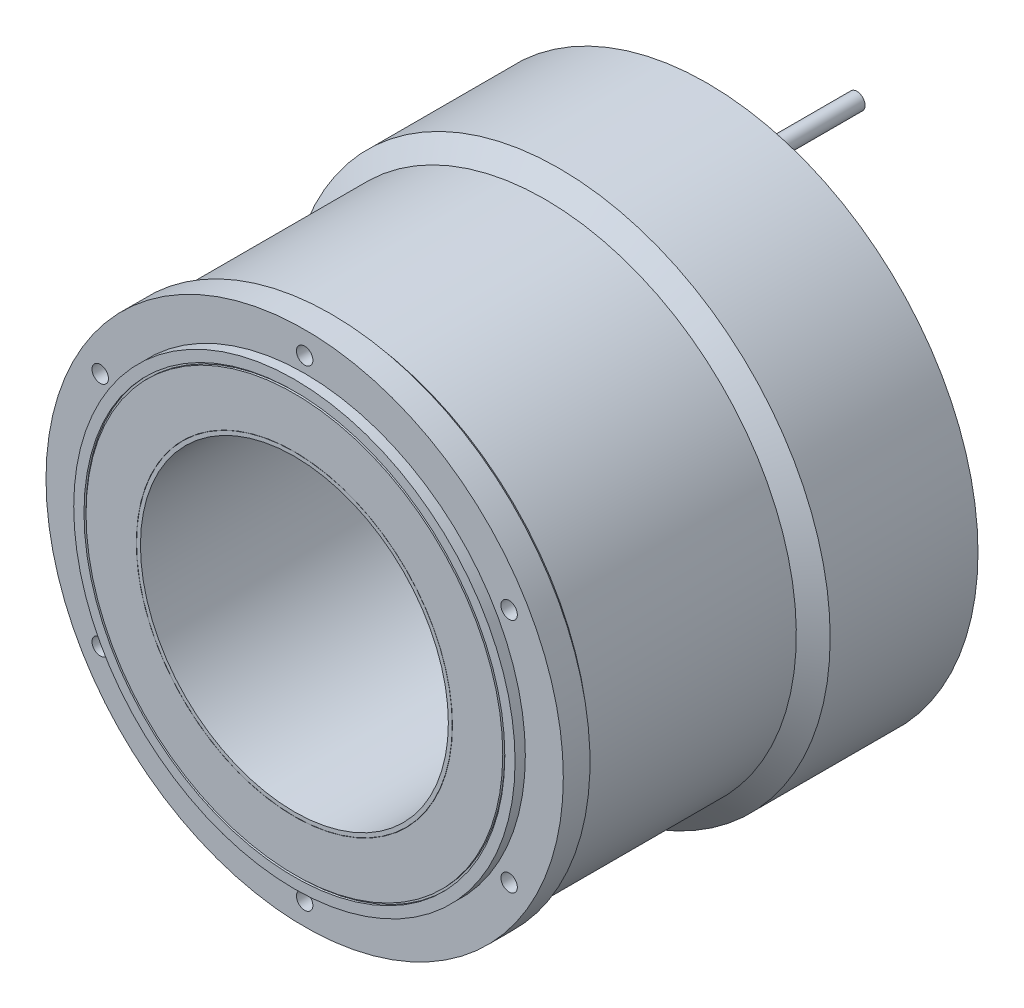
ISO-10303-21;
HEADER;
FILE_DESCRIPTION(('STEP AP214'),'2;1');
FILE_NAME('part.step','',(''),(''),'','','');
FILE_SCHEMA(('AUTOMOTIVE_DESIGN { 1 0 10303 214 1 1 1 1 }'));
ENDSEC;
DATA;
#1=APPLICATION_CONTEXT('core data for automotive mechanical design processes');
#2=APPLICATION_PROTOCOL_DEFINITION('international standard','automotive_design',2000,#1);
#3=PRODUCT_CONTEXT('',#1,'mechanical');
#4=PRODUCT('Part','Part','',(#3));
#5=PRODUCT_RELATED_PRODUCT_CATEGORY('part','',(#4));
#6=PRODUCT_DEFINITION_FORMATION('','',#4);
#7=PRODUCT_DEFINITION_CONTEXT('part definition',#1,'design');
#8=PRODUCT_DEFINITION('design','',#6,#7);
#9=PRODUCT_DEFINITION_SHAPE('','',#8);
#10=(LENGTH_UNIT() NAMED_UNIT(*) SI_UNIT(.MILLI.,.METRE.));
#11=(NAMED_UNIT(*) PLANE_ANGLE_UNIT() SI_UNIT($,.RADIAN.));
#12=(NAMED_UNIT(*) SI_UNIT($,.STERADIAN.) SOLID_ANGLE_UNIT());
#13=UNCERTAINTY_MEASURE_WITH_UNIT(LENGTH_MEASURE(1.E-05),#10,'distance_accuracy_value','');
#14=(GEOMETRIC_REPRESENTATION_CONTEXT(3) GLOBAL_UNCERTAINTY_ASSIGNED_CONTEXT((#13)) GLOBAL_UNIT_ASSIGNED_CONTEXT((#10,
#11,#12)) REPRESENTATION_CONTEXT('',''));
#15=CARTESIAN_POINT('',(0.,0.,0.));
#16=DIRECTION('',(0.,0.,1.));
#17=DIRECTION('',(1.,0.,0.));
#18=AXIS2_PLACEMENT_3D('',#15,#16,#17);
#19=CARTESIAN_POINT('',(-98.111250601,51.970329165,195.));
#20=DIRECTION('',(0.,0.,1.));
#21=DIRECTION('',(0.499999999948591,0.86602540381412,0.));
#22=AXIS2_PLACEMENT_3D('',#19,#20,#21);
#23=PLANE('',#22);
#24=CARTESIAN_POINT('',(-99.592921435,57.5,195.));
#25=DIRECTION('',(0.,0.,1.));
#26=DIRECTION('',(1.,0.,0.));
#27=AXIS2_PLACEMENT_3D('',#24,#25,#26);
#28=CIRCLE('',#27,4.);
#29=CARTESIAN_POINT('',(-95.592921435,57.5,195.));
#30=VERTEX_POINT('',#29);
#31=EDGE_CURVE('E20',#30,#30,#28,.F.);
#32=ORIENTED_EDGE('',*,*,#31,.F.);
#33=EDGE_LOOP('',(#32));
#34=FACE_BOUND('',#33,.T.);
#35=ADVANCED_FACE('F16',(#34),#23,.T.);
#36=CARTESIAN_POINT('',(-94.063250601,-58.981670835,195.));
#37=DIRECTION('',(0.,0.,1.));
#38=DIRECTION('',(-0.499999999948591,0.86602540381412,0.));
#39=AXIS2_PLACEMENT_3D('',#36,#37,#38);
#40=PLANE('',#39);
#41=CARTESIAN_POINT('',(-99.592921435,-57.5,195.));
#42=DIRECTION('',(0.,0.,1.));
#43=DIRECTION('',(1.,0.,0.));
#44=AXIS2_PLACEMENT_3D('',#41,#42,#43);
#45=CIRCLE('',#44,4.);
#46=CARTESIAN_POINT('',(-95.592921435,-57.5,195.));
#47=VERTEX_POINT('',#46);
#48=EDGE_CURVE('E492',#47,#47,#45,.F.);
#49=ORIENTED_EDGE('',*,*,#48,.F.);
#50=EDGE_LOOP('',(#49));
#51=FACE_BOUND('',#50,.T.);
#52=ADVANCED_FACE('F502',(#51),#40,.T.);
#53=CARTESIAN_POINT('',(4.048,-110.952,195.));
#54=DIRECTION('',(0.,0.,1.));
#55=DIRECTION('',(-1.,0.,0.));
#56=AXIS2_PLACEMENT_3D('',#53,#54,#55);
#57=PLANE('',#56);
#58=CARTESIAN_POINT('',(0.,-115.,195.));
#59=DIRECTION('',(0.,0.,1.));
#60=DIRECTION('',(1.,0.,0.));
#61=AXIS2_PLACEMENT_3D('',#58,#59,#60);
#62=CIRCLE('',#61,4.);
#63=CARTESIAN_POINT('',(4.,-115.,195.));
#64=VERTEX_POINT('',#63);
#65=EDGE_CURVE('E490',#64,#64,#62,.F.);
#66=ORIENTED_EDGE('',*,*,#65,.F.);
#67=EDGE_LOOP('',(#66));
#68=FACE_BOUND('',#67,.T.);
#69=ADVANCED_FACE('F508',(#68),#57,.T.);
#70=CARTESIAN_POINT('',(98.111250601,-51.970329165,195.));
#71=DIRECTION('',(0.,0.,1.));
#72=DIRECTION('',(-0.499999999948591,-0.86602540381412,0.));
#73=AXIS2_PLACEMENT_3D('',#70,#71,#72);
#74=PLANE('',#73);
#75=CARTESIAN_POINT('',(99.592921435,-57.5,195.));
#76=DIRECTION('',(0.,0.,1.));
#77=DIRECTION('',(1.,0.,0.));
#78=AXIS2_PLACEMENT_3D('',#75,#76,#77);
#79=CIRCLE('',#78,4.);
#80=CARTESIAN_POINT('',(103.592921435,-57.5,195.));
#81=VERTEX_POINT('',#80);
#82=EDGE_CURVE('E487',#81,#81,#79,.F.);
#83=ORIENTED_EDGE('',*,*,#82,.F.);
#84=EDGE_LOOP('',(#83));
#85=FACE_BOUND('',#84,.T.);
#86=ADVANCED_FACE('F2398',(#85),#74,.T.);
#87=CARTESIAN_POINT('',(94.063250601,58.981670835,195.));
#88=DIRECTION('',(0.,0.,1.));
#89=DIRECTION('',(0.499999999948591,-0.86602540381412,0.));
#90=AXIS2_PLACEMENT_3D('',#87,#88,#89);
#91=PLANE('',#90);
#92=CARTESIAN_POINT('',(99.592921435,57.5,195.));
#93=DIRECTION('',(0.,0.,1.));
#94=DIRECTION('',(1.,0.,0.));
#95=AXIS2_PLACEMENT_3D('',#92,#93,#94);
#96=CIRCLE('',#95,4.);
#97=CARTESIAN_POINT('',(103.592921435,57.5,195.));
#98=VERTEX_POINT('',#97);
#99=EDGE_CURVE('E484',#98,#98,#96,.F.);
#100=ORIENTED_EDGE('',*,*,#99,.F.);
#101=EDGE_LOOP('',(#100));
#102=FACE_BOUND('',#101,.T.);
#103=ADVANCED_FACE('F1381',(#102),#91,.T.);
#104=CARTESIAN_POINT('',(-4.048,110.952,195.));
#105=DIRECTION('',(0.,0.,1.));
#106=DIRECTION('',(1.,0.,0.));
#107=AXIS2_PLACEMENT_3D('',#104,#105,#106);
#108=PLANE('',#107);
#109=CARTESIAN_POINT('',(0.,115.,195.));
#110=DIRECTION('',(0.,0.,1.));
#111=DIRECTION('',(1.,0.,0.));
#112=AXIS2_PLACEMENT_3D('',#109,#110,#111);
#113=CIRCLE('',#112,4.);
#114=CARTESIAN_POINT('',(4.,115.,195.));
#115=VERTEX_POINT('',#114);
#116=EDGE_CURVE('E481',#115,#115,#113,.F.);
#117=ORIENTED_EDGE('',*,*,#116,.F.);
#118=EDGE_LOOP('',(#117));
#119=FACE_BOUND('',#118,.T.);
#120=ADVANCED_FACE('F1376',(#119),#108,.T.);
#121=CARTESIAN_POINT('',(-99.592921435,57.5,195.));
#122=DIRECTION('',(0.,0.,1.));
#123=DIRECTION('',(1.,0.,0.));
#124=AXIS2_PLACEMENT_3D('',#121,#122,#123);
#125=CYLINDRICAL_SURFACE('',#124,4.);
#126=CARTESIAN_POINT('',(-99.592921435,57.5,207.));
#127=DIRECTION('',(0.,0.,1.));
#128=DIRECTION('',(1.,0.,0.));
#129=AXIS2_PLACEMENT_3D('',#126,#127,#128);
#130=CIRCLE('',#129,4.);
#131=CARTESIAN_POINT('',(-95.592921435,57.5,207.));
#132=VERTEX_POINT('',#131);
#133=EDGE_CURVE('E475',#132,#132,#130,.F.);
#134=ORIENTED_EDGE('',*,*,#133,.F.);
#135=EDGE_LOOP('',(#134));
#136=FACE_BOUND('',#135,.T.);
#137=ORIENTED_EDGE('',*,*,#31,.T.);
#138=EDGE_LOOP('',(#137));
#139=FACE_BOUND('',#138,.T.);
#140=ADVANCED_FACE('F499',(#136,#139),#125,.F.);
#141=CARTESIAN_POINT('',(-99.592921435,-57.5,195.));
#142=DIRECTION('',(0.,0.,1.));
#143=DIRECTION('',(1.,0.,0.));
#144=AXIS2_PLACEMENT_3D('',#141,#142,#143);
#145=CYLINDRICAL_SURFACE('',#144,4.);
#146=CARTESIAN_POINT('',(-99.592921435,-57.5,207.));
#147=DIRECTION('',(0.,0.,1.));
#148=DIRECTION('',(1.,0.,0.));
#149=AXIS2_PLACEMENT_3D('',#146,#147,#148);
#150=CIRCLE('',#149,4.);
#151=CARTESIAN_POINT('',(-95.592921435,-57.5,207.));
#152=VERTEX_POINT('',#151);
#153=EDGE_CURVE('E472',#152,#152,#150,.F.);
#154=ORIENTED_EDGE('',*,*,#153,.F.);
#155=EDGE_LOOP('',(#154));
#156=FACE_BOUND('',#155,.T.);
#157=ORIENTED_EDGE('',*,*,#48,.T.);
#158=EDGE_LOOP('',(#157));
#159=FACE_BOUND('',#158,.T.);
#160=ADVANCED_FACE('F1371',(#156,#159),#145,.F.);
#161=CARTESIAN_POINT('',(0.,-115.,195.));
#162=DIRECTION('',(0.,0.,1.));
#163=DIRECTION('',(1.,0.,0.));
#164=AXIS2_PLACEMENT_3D('',#161,#162,#163);
#165=CYLINDRICAL_SURFACE('',#164,4.);
#166=CARTESIAN_POINT('',(0.,-115.,207.));
#167=DIRECTION('',(0.,0.,1.));
#168=DIRECTION('',(1.,0.,0.));
#169=AXIS2_PLACEMENT_3D('',#166,#167,#168);
#170=CIRCLE('',#169,4.);
#171=CARTESIAN_POINT('',(4.,-115.,207.));
#172=VERTEX_POINT('',#171);
#173=EDGE_CURVE('E469',#172,#172,#170,.F.);
#174=ORIENTED_EDGE('',*,*,#173,.F.);
#175=EDGE_LOOP('',(#174));
#176=FACE_BOUND('',#175,.T.);
#177=ORIENTED_EDGE('',*,*,#65,.T.);
#178=EDGE_LOOP('',(#177));
#179=FACE_BOUND('',#178,.T.);
#180=ADVANCED_FACE('F1367',(#176,#179),#165,.F.);
#181=CARTESIAN_POINT('',(99.592921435,-57.5,195.));
#182=DIRECTION('',(0.,0.,1.));
#183=DIRECTION('',(1.,0.,0.));
#184=AXIS2_PLACEMENT_3D('',#181,#182,#183);
#185=CYLINDRICAL_SURFACE('',#184,4.);
#186=CARTESIAN_POINT('',(99.592921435,-57.5,207.));
#187=DIRECTION('',(0.,0.,1.));
#188=DIRECTION('',(1.,0.,0.));
#189=AXIS2_PLACEMENT_3D('',#186,#187,#188);
#190=CIRCLE('',#189,4.);
#191=CARTESIAN_POINT('',(103.592921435,-57.5,207.));
#192=VERTEX_POINT('',#191);
#193=EDGE_CURVE('E466',#192,#192,#190,.F.);
#194=ORIENTED_EDGE('',*,*,#193,.F.);
#195=EDGE_LOOP('',(#194));
#196=FACE_BOUND('',#195,.T.);
#197=ORIENTED_EDGE('',*,*,#82,.T.);
#198=EDGE_LOOP('',(#197));
#199=FACE_BOUND('',#198,.T.);
#200=ADVANCED_FACE('F1363',(#196,#199),#185,.F.);
#201=CARTESIAN_POINT('',(99.592921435,57.5,195.));
#202=DIRECTION('',(0.,0.,1.));
#203=DIRECTION('',(1.,0.,0.));
#204=AXIS2_PLACEMENT_3D('',#201,#202,#203);
#205=CYLINDRICAL_SURFACE('',#204,4.);
#206=CARTESIAN_POINT('',(99.592921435,57.5,207.));
#207=DIRECTION('',(0.,0.,1.));
#208=DIRECTION('',(1.,0.,0.));
#209=AXIS2_PLACEMENT_3D('',#206,#207,#208);
#210=CIRCLE('',#209,4.);
#211=CARTESIAN_POINT('',(103.592921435,57.5,207.));
#212=VERTEX_POINT('',#211);
#213=EDGE_CURVE('E463',#212,#212,#210,.F.);
#214=ORIENTED_EDGE('',*,*,#213,.F.);
#215=EDGE_LOOP('',(#214));
#216=FACE_BOUND('',#215,.T.);
#217=ORIENTED_EDGE('',*,*,#99,.T.);
#218=EDGE_LOOP('',(#217));
#219=FACE_BOUND('',#218,.T.);
#220=ADVANCED_FACE('F1359',(#216,#219),#205,.F.);
#221=CARTESIAN_POINT('',(0.,115.,195.));
#222=DIRECTION('',(0.,0.,1.));
#223=DIRECTION('',(1.,0.,0.));
#224=AXIS2_PLACEMENT_3D('',#221,#222,#223);
#225=CYLINDRICAL_SURFACE('',#224,4.);
#226=CARTESIAN_POINT('',(0.,115.,207.));
#227=DIRECTION('',(0.,0.,1.));
#228=DIRECTION('',(1.,0.,0.));
#229=AXIS2_PLACEMENT_3D('',#226,#227,#228);
#230=CIRCLE('',#229,4.);
#231=CARTESIAN_POINT('',(4.,115.,207.));
#232=VERTEX_POINT('',#231);
#233=EDGE_CURVE('E460',#232,#232,#230,.F.);
#234=ORIENTED_EDGE('',*,*,#233,.F.);
#235=EDGE_LOOP('',(#234));
#236=FACE_BOUND('',#235,.T.);
#237=ORIENTED_EDGE('',*,*,#116,.T.);
#238=EDGE_LOOP('',(#237));
#239=FACE_BOUND('',#238,.T.);
#240=ADVANCED_FACE('F1355',(#236,#239),#225,.F.);
#241=CARTESIAN_POINT('',(0.,0.,212.));
#242=DIRECTION('',(0.,0.,-1.));
#243=DIRECTION('',(-1.,0.,0.));
#244=AXIS2_PLACEMENT_3D('',#241,#242,#243);
#245=CYLINDRICAL_SURFACE('',#244,107.5);
#246=CARTESIAN_POINT('',(0.,0.,212.));
#247=DIRECTION('',(0.,0.,-1.));
#248=DIRECTION('',(-1.,0.,0.));
#249=AXIS2_PLACEMENT_3D('',#246,#247,#248);
#250=CIRCLE('',#249,107.5);
#251=CARTESIAN_POINT('',(-107.5,0.,212.));
#252=VERTEX_POINT('',#251);
#253=EDGE_CURVE('E478',#252,#252,#250,.F.);
#254=ORIENTED_EDGE('',*,*,#253,.F.);
#255=EDGE_LOOP('',(#254));
#256=FACE_BOUND('',#255,.T.);
#257=CARTESIAN_POINT('',(0.,0.,207.));
#258=DIRECTION('',(0.,0.,-1.));
#259=DIRECTION('',(-1.,0.,0.));
#260=AXIS2_PLACEMENT_3D('',#257,#258,#259);
#261=CIRCLE('',#260,107.5);
#262=CARTESIAN_POINT('',(-107.5,0.,207.));
#263=VERTEX_POINT('',#262);
#264=EDGE_CURVE('E457',#263,#263,#261,.T.);
#265=ORIENTED_EDGE('',*,*,#264,.F.);
#266=EDGE_LOOP('',(#265));
#267=FACE_BOUND('',#266,.T.);
#268=ADVANCED_FACE('F1351',(#256,#267),#245,.T.);
#269=CARTESIAN_POINT('',(-108.79,108.79,212.));
#270=DIRECTION('',(0.,0.,1.));
#271=DIRECTION('',(0.,-1.,0.));
#272=AXIS2_PLACEMENT_3D('',#269,#270,#271);
#273=PLANE('',#272);
#274=CARTESIAN_POINT('',(0.,0.,212.));
#275=DIRECTION('',(0.,0.,1.));
#276=DIRECTION('',(1.,0.,0.));
#277=AXIS2_PLACEMENT_3D('',#274,#275,#276);
#278=CIRCLE('',#277,102.5);
#279=CARTESIAN_POINT('',(102.5,0.,212.));
#280=VERTEX_POINT('',#279);
#281=EDGE_CURVE('E454',#280,#280,#278,.T.);
#282=ORIENTED_EDGE('',*,*,#281,.F.);
#283=EDGE_LOOP('',(#282));
#284=FACE_BOUND('',#283,.T.);
#285=ORIENTED_EDGE('',*,*,#253,.T.);
#286=EDGE_LOOP('',(#285));
#287=FACE_BOUND('',#286,.T.);
#288=ADVANCED_FACE('F1354',(#284,#287),#273,.T.);
#289=CARTESIAN_POINT('',(-127.512,127.512,207.));
#290=DIRECTION('',(0.,0.,1.));
#291=DIRECTION('',(0.,-1.,0.));
#292=AXIS2_PLACEMENT_3D('',#289,#290,#291);
#293=PLANE('',#292);
#294=ORIENTED_EDGE('',*,*,#264,.T.);
#295=EDGE_LOOP('',(#294));
#296=FACE_BOUND('',#295,.T.);
#297=ORIENTED_EDGE('',*,*,#233,.T.);
#298=EDGE_LOOP('',(#297));
#299=FACE_BOUND('',#298,.T.);
#300=ORIENTED_EDGE('',*,*,#213,.T.);
#301=EDGE_LOOP('',(#300));
#302=FACE_BOUND('',#301,.T.);
#303=ORIENTED_EDGE('',*,*,#193,.T.);
#304=EDGE_LOOP('',(#303));
#305=FACE_BOUND('',#304,.T.);
#306=ORIENTED_EDGE('',*,*,#173,.T.);
#307=EDGE_LOOP('',(#306));
#308=FACE_BOUND('',#307,.T.);
#309=ORIENTED_EDGE('',*,*,#153,.T.);
#310=EDGE_LOOP('',(#309));
#311=FACE_BOUND('',#310,.T.);
#312=ORIENTED_EDGE('',*,*,#133,.T.);
#313=EDGE_LOOP('',(#312));
#314=FACE_BOUND('',#313,.T.);
#315=CARTESIAN_POINT('',(0.,0.,207.));
#316=DIRECTION('',(0.,0.,-1.));
#317=DIRECTION('',(-1.,0.,0.));
#318=AXIS2_PLACEMENT_3D('',#315,#316,#317);
#319=CIRCLE('',#318,126.);
#320=CARTESIAN_POINT('',(-126.,0.,207.));
#321=VERTEX_POINT('',#320);
#322=EDGE_CURVE('E451',#321,#321,#319,.F.);
#323=ORIENTED_EDGE('',*,*,#322,.T.);
#324=EDGE_LOOP('',(#323));
#325=FACE_BOUND('',#324,.T.);
#326=ADVANCED_FACE('F1349',(#296,#299,#302,#305,#308,#311,#314,#325),#293,.T.);
#327=CARTESIAN_POINT('',(0.,0.,211.));
#328=DIRECTION('',(0.,0.,1.));
#329=DIRECTION('',(1.,0.,0.));
#330=AXIS2_PLACEMENT_3D('',#327,#328,#329);
#331=CYLINDRICAL_SURFACE('',#330,102.5);
#332=ORIENTED_EDGE('',*,*,#281,.T.);
#333=EDGE_LOOP('',(#332));
#334=FACE_BOUND('',#333,.T.);
#335=CARTESIAN_POINT('',(0.,0.,211.));
#336=DIRECTION('',(0.,0.,1.));
#337=DIRECTION('',(1.,0.,0.));
#338=AXIS2_PLACEMENT_3D('',#335,#336,#337);
#339=CIRCLE('',#338,102.5);
#340=CARTESIAN_POINT('',(102.5,0.,211.));
#341=VERTEX_POINT('',#340);
#342=EDGE_CURVE('E448',#341,#341,#339,.T.);
#343=ORIENTED_EDGE('',*,*,#342,.F.);
#344=EDGE_LOOP('',(#343));
#345=FACE_BOUND('',#344,.T.);
#346=ADVANCED_FACE('F1345',(#334,#345),#331,.F.);
#347=CARTESIAN_POINT('',(0.,0.,207.));
#348=DIRECTION('',(0.,0.,-1.));
#349=DIRECTION('',(-1.,0.,0.));
#350=AXIS2_PLACEMENT_3D('',#347,#348,#349);
#351=CYLINDRICAL_SURFACE('',#350,126.);
#352=ORIENTED_EDGE('',*,*,#322,.F.);
#353=EDGE_LOOP('',(#352));
#354=FACE_BOUND('',#353,.T.);
#355=CARTESIAN_POINT('',(0.,0.,194.));
#356=DIRECTION('',(0.,0.,1.));
#357=DIRECTION('',(0.,-1.,0.));
#358=AXIS2_PLACEMENT_3D('',#355,#356,#357);
#359=CIRCLE('',#358,126.);
#360=CARTESIAN_POINT('',(0.,-126.,194.));
#361=VERTEX_POINT('',#360);
#362=EDGE_CURVE('E447',#361,#361,#359,.T.);
#363=ORIENTED_EDGE('',*,*,#362,.T.);
#364=EDGE_LOOP('',(#363));
#365=FACE_BOUND('',#364,.T.);
#366=ADVANCED_FACE('F1342',(#354,#365),#351,.T.);
#367=CARTESIAN_POINT('',(-103.73,-103.73,211.));
#368=DIRECTION('',(0.,0.,1.));
#369=DIRECTION('',(1.,0.,0.));
#370=AXIS2_PLACEMENT_3D('',#367,#368,#369);
#371=PLANE('',#370);
#372=CARTESIAN_POINT('',(0.,0.,211.));
#373=DIRECTION('',(0.,0.,1.));
#374=DIRECTION('',(1.,0.,0.));
#375=AXIS2_PLACEMENT_3D('',#372,#373,#374);
#376=CIRCLE('',#375,101.5);
#377=CARTESIAN_POINT('',(101.5,0.,211.));
#378=VERTEX_POINT('',#377);
#379=EDGE_CURVE('E444',#378,#378,#376,.F.);
#380=ORIENTED_EDGE('',*,*,#379,.T.);
#381=EDGE_LOOP('',(#380));
#382=FACE_BOUND('',#381,.T.);
#383=ORIENTED_EDGE('',*,*,#342,.T.);
#384=EDGE_LOOP('',(#383));
#385=FACE_BOUND('',#384,.T.);
#386=ADVANCED_FACE('F1337',(#382,#385),#371,.T.);
#387=CARTESIAN_POINT('',(0.,0.,191.));
#388=DIRECTION('',(0.,0.,1.));
#389=DIRECTION('',(1.,0.,0.));
#390=AXIS2_PLACEMENT_3D('',#387,#388,#389);
#391=CONICAL_SURFACE('',#390,122.5,0.862170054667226);
#392=CARTESIAN_POINT('',(0.,0.,191.));
#393=DIRECTION('',(0.,0.,-1.));
#394=DIRECTION('',(0.,1.,0.));
#395=AXIS2_PLACEMENT_3D('',#392,#393,#394);
#396=CIRCLE('',#395,122.5);
#397=CARTESIAN_POINT('',(0.,122.5,191.));
#398=VERTEX_POINT('',#397);
#399=EDGE_CURVE('E443',#398,#398,#396,.F.);
#400=ORIENTED_EDGE('',*,*,#399,.T.);
#401=EDGE_LOOP('',(#400));
#402=FACE_BOUND('',#401,.T.);
#403=ORIENTED_EDGE('',*,*,#362,.F.);
#404=EDGE_LOOP('',(#403));
#405=FACE_BOUND('',#404,.T.);
#406=ADVANCED_FACE('F1331',(#402,#405),#391,.T.);
#407=CARTESIAN_POINT('',(0.,0.,211.));
#408=DIRECTION('',(0.,0.,1.));
#409=DIRECTION('',(1.,0.,0.));
#410=AXIS2_PLACEMENT_3D('',#407,#408,#409);
#411=CYLINDRICAL_SURFACE('',#410,101.5);
#412=ORIENTED_EDGE('',*,*,#379,.F.);
#413=EDGE_LOOP('',(#412));
#414=FACE_BOUND('',#413,.T.);
#415=CARTESIAN_POINT('',(0.,0.,212.));
#416=DIRECTION('',(0.,0.,1.));
#417=DIRECTION('',(1.,0.,0.));
#418=AXIS2_PLACEMENT_3D('',#415,#416,#417);
#419=CIRCLE('',#418,101.5);
#420=CARTESIAN_POINT('',(101.5,0.,212.));
#421=VERTEX_POINT('',#420);
#422=EDGE_CURVE('E420',#421,#421,#419,.T.);
#423=ORIENTED_EDGE('',*,*,#422,.F.);
#424=EDGE_LOOP('',(#423));
#425=FACE_BOUND('',#424,.T.);
#426=ADVANCED_FACE('F1329',(#414,#425),#411,.T.);
#427=CARTESIAN_POINT('',(0.,0.,43.));
#428=DIRECTION('',(0.,0.,-1.));
#429=DIRECTION('',(-1.,0.,0.));
#430=AXIS2_PLACEMENT_3D('',#427,#428,#429);
#431=CYLINDRICAL_SURFACE('',#430,132.1);
#432=DIRECTION('',(0.,0.,1.));
#433=VECTOR('',#432,1.);
#434=CARTESIAN_POINT('',(-127.09227207,36.027272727,33.));
#435=LINE('',#434,#433);
#436=CARTESIAN_POINT('',(-127.092272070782,36.0272727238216,23.));
#437=VERTEX_POINT('',#436);
#438=CARTESIAN_POINT('',(-127.09227206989,36.0272727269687,43.));
#439=VERTEX_POINT('',#438);
#440=EDGE_CURVE('E434',#437,#439,#435,.T.);
#441=ORIENTED_EDGE('',*,*,#440,.F.);
#442=CARTESIAN_POINT('',(0.,0.,23.));
#443=DIRECTION('',(0.,0.,-1.));
#444=DIRECTION('',(-1.,0.,0.));
#445=AXIS2_PLACEMENT_3D('',#442,#443,#444);
#446=CIRCLE('',#445,132.1);
#447=CARTESIAN_POINT('',(-132.076305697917,2.50189393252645,23.));
#448=VERTEX_POINT('',#447);
#449=EDGE_CURVE('E416',#448,#437,#446,.T.);
#450=ORIENTED_EDGE('',*,*,#449,.F.);
#451=DIRECTION('',(0.,0.,1.));
#452=VECTOR('',#451,1.);
#453=CARTESIAN_POINT('',(-132.076305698,2.50189394,33.));
#454=LINE('',#453,#452);
#455=CARTESIAN_POINT('',(-132.076305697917,2.50189393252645,43.));
#456=VERTEX_POINT('',#455);
#457=EDGE_CURVE('E409',#448,#456,#454,.T.);
#458=ORIENTED_EDGE('',*,*,#457,.T.);
#459=CARTESIAN_POINT('',(0.,0.,43.));
#460=DIRECTION('',(0.,0.,-1.));
#461=DIRECTION('',(-1.,0.,0.));
#462=AXIS2_PLACEMENT_3D('',#459,#460,#461);
#463=CIRCLE('',#462,132.1);
#464=EDGE_CURVE('E413',#439,#456,#463,.F.);
#465=ORIENTED_EDGE('',*,*,#464,.F.);
#466=EDGE_LOOP('',(#441,#450,#458,#465));
#467=FACE_BOUND('',#466,.T.);
#468=ADVANCED_FACE('F411',(#467),#431,.T.);
#469=CARTESIAN_POINT('',(0.,0.,40.303698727));
#470=DIRECTION('',(0.,0.,-1.));
#471=DIRECTION('',(-1.,0.,0.));
#472=AXIS2_PLACEMENT_3D('',#469,#470,#471);
#473=CYLINDRICAL_SURFACE('',#472,132.1);
#474=CARTESIAN_POINT('',(-129.451425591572,-26.3199242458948,23.));
#475=CARTESIAN_POINT('',(-129.444691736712,-26.3530441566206,23.0000018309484));
#476=CARTESIAN_POINT('',(-129.437949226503,-26.3861409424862,23.0013710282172));
#477=CARTESIAN_POINT('',(-129.424470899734,-26.4521732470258,23.0068407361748));
#478=CARTESIAN_POINT('',(-129.417735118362,-26.4851083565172,23.0109462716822));
#479=CARTESIAN_POINT('',(-129.397455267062,-26.5840764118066,23.0274819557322));
#480=CARTESIAN_POINT('',(-129.383997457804,-26.6494913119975,23.0441316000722));
#481=CARTESIAN_POINT('',(-129.364307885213,-26.744848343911,23.0771318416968));
#482=CARTESIAN_POINT('',(-129.357823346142,-26.7761933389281,23.0894805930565));
#483=CARTESIAN_POINT('',(-129.345055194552,-26.8378032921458,23.1167926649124));
#484=CARTESIAN_POINT('',(-129.338771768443,-26.8680672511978,23.1317583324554));
#485=CARTESIAN_POINT('',(-129.320057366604,-26.9580517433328,23.1811135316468));
#486=CARTESIAN_POINT('',(-129.308021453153,-27.0157105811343,23.2195299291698));
#487=CARTESIAN_POINT('',(-129.285408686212,-27.1237194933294,23.3058270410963));
#488=CARTESIAN_POINT('',(-129.274831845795,-27.1740695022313,23.3537078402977));
#489=CARTESIAN_POINT('',(-129.255641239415,-27.2652038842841,23.456803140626));
#490=CARTESIAN_POINT('',(-129.246997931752,-27.3061325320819,23.5118834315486));
#491=CARTESIAN_POINT('',(-129.235590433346,-27.3600530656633,23.5992111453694));
#492=CARTESIAN_POINT('',(-129.232047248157,-27.3767824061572,23.6291079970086));
#493=CARTESIAN_POINT('',(-129.225499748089,-27.4076715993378,23.6903025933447));
#494=CARTESIAN_POINT('',(-129.222496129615,-27.4218281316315,23.7216020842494));
#495=CARTESIAN_POINT('',(-129.214480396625,-27.4595834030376,23.8157364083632));
#496=CARTESIAN_POINT('',(-129.210275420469,-27.4793549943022,23.8802484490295));
#497=CARTESIAN_POINT('',(-129.205723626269,-27.5007459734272,23.9787786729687));
#498=CARTESIAN_POINT('',(-129.204498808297,-27.5064993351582,24.0119320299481));
#499=CARTESIAN_POINT('',(-129.202650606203,-27.5151794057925,24.0786202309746));
#500=CARTESIAN_POINT('',(-129.202026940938,-27.5181074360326,24.1121548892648));
#501=CARTESIAN_POINT('',(-129.201386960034,-27.5211120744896,24.1788149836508));
#502=CARTESIAN_POINT('',(-129.201361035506,-27.5212337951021,24.2119383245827));
#503=CARTESIAN_POINT('',(-129.201891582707,-27.5187429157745,24.278038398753));
#504=CARTESIAN_POINT('',(-129.202447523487,-27.5161328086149,24.3110152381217));
#505=CARTESIAN_POINT('',(-129.204985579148,-27.5042138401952,24.409452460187));
#506=CARTESIAN_POINT('',(-129.207837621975,-27.4908177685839,24.4744519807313));
#507=CARTESIAN_POINT('',(-129.215000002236,-27.457130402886,24.589199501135));
#508=CARTESIAN_POINT('',(-129.218933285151,-27.4386187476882,24.6395098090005));
#509=CARTESIAN_POINT('',(-129.228154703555,-27.3951546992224,24.7370719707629));
#510=CARTESIAN_POINT('',(-129.23344142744,-27.3702090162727,24.7843269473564));
#511=CARTESIAN_POINT('',(-129.239361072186,-27.3422301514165,24.8296604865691));
#512=B_SPLINE_CURVE_WITH_KNOTS('',3,(#474,#475,#476,#477,#478,#479,#480,#481,#482,#483,#484,
#485,#486,#487,#488,#489,#490,#491,#492,#493,#494,#495,#496,#497,#498,#499,#500,#501,#502,#503,
#504,#505,#506,#507,#508,#509,#510,#511),.UNSPECIFIED.,.F.,.F.,(4,2,2,2,2,2,2,2,2,2,2,2,2,2,2,2,
2,2,4),(0.,0.101323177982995,0.202832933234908,0.408215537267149,0.511045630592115,
0.613968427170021,0.823817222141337,1.03366789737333,1.2400520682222,1.3432637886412,
1.44660777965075,1.6482526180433,1.74917147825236,1.85004311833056,1.9492920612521,
2.04845051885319,2.24667125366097,2.40746273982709,2.56808720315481),.UNSPECIFIED.);
#513=CARTESIAN_POINT('',(-129.451425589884,-26.319924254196,23.));
#514=VERTEX_POINT('',#513);
#515=CARTESIAN_POINT('',(-129.239361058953,-27.3422302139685,24.8296603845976));
#516=VERTEX_POINT('',#515);
#517=EDGE_CURVE('E849',#514,#516,#512,.T.);
#518=ORIENTED_EDGE('',*,*,#517,.T.);
#519=CARTESIAN_POINT('',(-130.674209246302,-19.3561627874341,37.7760698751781));
#520=CARTESIAN_POINT('',(-130.669039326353,-19.3910651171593,37.7194888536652));
#521=CARTESIAN_POINT('',(-130.663855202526,-19.4259668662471,37.6629087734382));
#522=CARTESIAN_POINT('',(-130.637863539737,-19.600472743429,37.3800130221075));
#523=CARTESIAN_POINT('',(-130.616842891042,-19.7400681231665,37.1537115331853));
#524=CARTESIAN_POINT('',(-130.510601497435,-20.438000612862,36.0222760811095));
#525=CARTESIAN_POINT('',(-130.421967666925,-20.9961952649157,35.1173730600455));
#526=CARTESIAN_POINT('',(-130.169971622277,-22.5199164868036,32.6472312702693));
#527=CARTESIAN_POINT('',(-129.999320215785,-23.4851130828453,31.0825274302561));
#528=CARTESIAN_POINT('',(-129.635939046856,-25.4144998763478,27.9547512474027));
#529=CARTESIAN_POINT('',(-129.443206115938,-26.3786899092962,26.3916791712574));
#530=CARTESIAN_POINT('',(-129.239361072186,-27.3422301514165,24.8296604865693));
#531=B_SPLINE_CURVE_WITH_KNOTS('',3,(#519,#520,#521,#522,#523,#524,#525,#526,#527,#528,#529,
#530),.UNSPECIFIED.,.F.,.F.,(4,2,2,2,2,4),(0.,0.200042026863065,1.00021040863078,
4.20090157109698,9.73982612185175,15.2795464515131),.UNSPECIFIED.);
#532=CARTESIAN_POINT('',(-130.674209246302,-19.356162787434,37.7760698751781));
#533=VERTEX_POINT('',#532);
#534=EDGE_CURVE('E843',#533,#516,#531,.T.);
#535=ORIENTED_EDGE('',*,*,#534,.F.);
#536=CARTESIAN_POINT('',(-130.674209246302,-19.356162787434,37.7760698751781));
#537=CARTESIAN_POINT('',(-130.679429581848,-19.3209196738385,37.8332156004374));
#538=CARTESIAN_POINT('',(-130.684801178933,-19.2845577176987,37.8896698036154));
#539=CARTESIAN_POINT('',(-130.70138833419,-19.1719293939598,38.0571994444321));
#540=CARTESIAN_POINT('',(-130.713041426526,-19.0923539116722,38.1660279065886));
#541=CARTESIAN_POINT('',(-130.737408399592,-18.9247775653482,38.3769456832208));
#542=CARTESIAN_POINT('',(-130.750122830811,-18.8367723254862,38.4790314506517));
#543=CARTESIAN_POINT('',(-130.776458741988,-18.6530547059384,38.6758504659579));
#544=CARTESIAN_POINT('',(-130.790080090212,-18.5573434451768,38.7705847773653));
#545=CARTESIAN_POINT('',(-130.818082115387,-18.3589059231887,38.9521989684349));
#546=CARTESIAN_POINT('',(-130.832462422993,-18.2561830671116,39.0390826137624));
#547=CARTESIAN_POINT('',(-130.85449205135,-18.0973687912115,39.162901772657));
#548=CARTESIAN_POINT('',(-130.861901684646,-18.0437164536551,39.2030416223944));
#549=CARTESIAN_POINT('',(-130.876862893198,-17.9348760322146,39.2811555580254));
#550=CARTESIAN_POINT('',(-130.884414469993,-17.8796879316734,39.3191296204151));
#551=CARTESIAN_POINT('',(-130.907297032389,-17.7116451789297,39.4299240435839));
#552=CARTESIAN_POINT('',(-130.922817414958,-17.5965887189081,39.4994010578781));
#553=CARTESIAN_POINT('',(-130.954209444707,-17.361426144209,39.6292184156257));
#554=CARTESIAN_POINT('',(-130.970081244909,-17.2413178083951,39.6895546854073));
#555=CARTESIAN_POINT('',(-131.002052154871,-16.9966920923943,39.8004941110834));
#556=CARTESIAN_POINT('',(-131.018151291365,-16.8721741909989,39.8510961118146));
#557=CARTESIAN_POINT('',(-131.050432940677,-16.6195734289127,39.9422036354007));
#558=CARTESIAN_POINT('',(-131.066615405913,-16.4914924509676,39.9827143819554));
#559=CARTESIAN_POINT('',(-131.090826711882,-16.2975271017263,40.0358729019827));
#560=CARTESIAN_POINT('',(-131.098875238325,-16.2326591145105,40.0523063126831));
#561=CARTESIAN_POINT('',(-131.114949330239,-16.1023096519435,40.0826481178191));
#562=CARTESIAN_POINT('',(-131.12297488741,-16.0368279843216,40.0965556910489));
#563=CARTESIAN_POINT('',(-131.147225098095,-15.8377201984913,40.1347477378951));
#564=CARTESIAN_POINT('',(-131.163391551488,-15.7032863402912,40.1549900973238));
#565=CARTESIAN_POINT('',(-131.195452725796,-15.4331365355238,40.184558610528));
#566=CARTESIAN_POINT('',(-131.211347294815,-15.2974199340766,40.1938788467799));
#567=CARTESIAN_POINT('',(-131.242779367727,-15.0253668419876,40.2018017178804));
#568=CARTESIAN_POINT('',(-131.258316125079,-14.8890296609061,40.2003836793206));
#569=CARTESIAN_POINT('',(-131.288904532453,-14.6168498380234,40.1866645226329));
#570=CARTESIAN_POINT('',(-131.303956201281,-14.4810071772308,40.1743638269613));
#571=CARTESIAN_POINT('',(-131.333481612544,-14.2107383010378,40.1388374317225));
#572=CARTESIAN_POINT('',(-131.347955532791,-14.0763116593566,40.115615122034));
#573=CARTESIAN_POINT('',(-131.376259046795,-13.8096538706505,40.0585104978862));
#574=CARTESIAN_POINT('',(-131.390088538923,-13.6774230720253,40.0246265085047));
#575=CARTESIAN_POINT('',(-131.417020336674,-13.4161836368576,39.9465013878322));
#576=CARTESIAN_POINT('',(-131.430123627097,-13.2871707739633,39.9022747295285));
#577=CARTESIAN_POINT('',(-131.455559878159,-13.0331143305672,39.8035052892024));
#578=CARTESIAN_POINT('',(-131.467893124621,-12.9080692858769,39.7489663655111));
#579=CARTESIAN_POINT('',(-131.486033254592,-12.7215244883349,39.6585338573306));
#580=CARTESIAN_POINT('',(-131.492135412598,-12.6582887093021,39.6262296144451));
#581=CARTESIAN_POINT('',(-131.504117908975,-12.5331927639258,39.5590425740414));
#582=CARTESIAN_POINT('',(-131.509998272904,-12.471332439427,39.5241600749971));
#583=CARTESIAN_POINT('',(-131.527289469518,-12.2880898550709,39.4157546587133));
#584=CARTESIAN_POINT('',(-131.538364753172,-12.1688981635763,39.3384021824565));
#585=CARTESIAN_POINT('',(-131.55425464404,-11.995476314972,39.2151917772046));
#586=CARTESIAN_POINT('',(-131.55942404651,-11.9386390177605,39.1729886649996));
#587=CARTESIAN_POINT('',(-131.569529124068,-11.8267560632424,39.0862212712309));
#588=CARTESIAN_POINT('',(-131.574464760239,-11.7717107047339,39.0416565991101));
#589=CARTESIAN_POINT('',(-131.588325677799,-11.6160638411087,38.910179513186));
#590=CARTESIAN_POINT('',(-131.59695438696,-11.517839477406,38.8203991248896));
#591=CARTESIAN_POINT('',(-131.613383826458,-11.3285575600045,38.6335007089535));
#592=CARTESIAN_POINT('',(-131.62118455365,-11.2375000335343,38.536382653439));
#593=CARTESIAN_POINT('',(-131.63233308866,-11.1058942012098,38.3843978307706));
#594=CARTESIAN_POINT('',(-131.635994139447,-11.0624075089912,38.3320751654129));
#595=CARTESIAN_POINT('',(-131.643094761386,-10.9775867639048,38.2257183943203));
#596=CARTESIAN_POINT('',(-131.646534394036,-10.9362521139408,38.1716847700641));
#597=CARTESIAN_POINT('',(-131.653215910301,-10.8555236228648,38.0616280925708));
#598=CARTESIAN_POINT('',(-131.656456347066,-10.8161443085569,38.0055943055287));
#599=CARTESIAN_POINT('',(-131.662718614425,-10.7396460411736,37.8919692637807));
#600=CARTESIAN_POINT('',(-131.665740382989,-10.7025277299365,37.8343775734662));
#601=CARTESIAN_POINT('',(-131.668653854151,-10.6665642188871,37.7760694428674));
#602=B_SPLINE_CURVE_WITH_KNOTS('',3,(#536,#537,#538,#539,#540,#541,#542,#543,#544,#545,#546,
#547,#548,#549,#550,#551,#552,#553,#554,#555,#556,#557,#558,#559,#560,#561,#562,#563,#564,#565,
#566,#567,#568,#569,#570,#571,#572,#573,#574,#575,#576,#577,#578,#579,#580,#581,#582,#583,#584,
#585,#586,#587,#588,#589,#590,#591,#592,#593,#594,#595,#596,#597,#598,#599,#600,#601),
.UNSPECIFIED.,.F.,.F.,(4,2,2,2,2,2,2,2,2,2,2,2,2,2,2,2,2,2,2,2,2,2,2,2,2,2,2,2,2,2,2,2,4),(0.,
0.202039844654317,0.607544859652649,1.01326152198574,1.41891937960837,1.82438161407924,
2.0265784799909,2.22877753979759,2.63423112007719,3.03986486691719,3.44554672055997,
3.85101813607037,4.0531742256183,4.25539592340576,4.66563762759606,5.07610149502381,
5.48735579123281,5.89859412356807,6.30970489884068,6.7208802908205,7.13148371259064,
7.54193381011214,7.75569291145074,7.96942730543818,8.39640286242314,8.60929640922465,
8.82222527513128,9.22186310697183,9.62150245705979,9.82585455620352,10.030149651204,
10.2357862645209,10.4414809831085),.UNSPECIFIED.);
#603=CARTESIAN_POINT('',(-131.668653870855,-10.6665640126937,37.7760691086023));
#604=VERTEX_POINT('',#603);
#605=EDGE_CURVE('E874',#533,#604,#602,.T.);
#606=ORIENTED_EDGE('',*,*,#605,.T.);
#607=CARTESIAN_POINT('',(-132.072801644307,-2.68049730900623,24.829660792));
#608=CARTESIAN_POINT('',(-132.072091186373,-2.71550280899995,24.8864090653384));
#609=CARTESIAN_POINT('',(-132.071366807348,-2.75050823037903,24.9431572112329));
#610=CARTESIAN_POINT('',(-132.067675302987,-2.92553497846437,25.226897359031));
#611=CARTESIAN_POINT('',(-132.06449935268,-3.06555509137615,25.4538873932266));
#612=CARTESIAN_POINT('',(-132.047505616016,-3.76565137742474,26.5888306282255));
#613=CARTESIAN_POINT('',(-132.030346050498,-4.32570591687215,27.4967487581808));
#614=CARTESIAN_POINT('',(-131.973952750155,-5.84943350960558,29.9669008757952));
#615=CARTESIAN_POINT('',(-131.927723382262,-6.81303717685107,31.5290223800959));
#616=CARTESIAN_POINT('',(-131.814086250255,-8.74002849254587,34.652915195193));
#617=CARTESIAN_POINT('',(-131.746675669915,-9.70341609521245,36.2146864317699));
#618=CARTESIAN_POINT('',(-131.668653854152,-10.6665642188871,37.7760694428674));
#619=B_SPLINE_CURVE_WITH_KNOTS('',3,(#607,#608,#609,#610,#611,#612,#613,#614,#615,#616,#617,
#618),.UNSPECIFIED.,.F.,.F.,(4,2,2,2,2,4),(0.,0.200040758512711,1.0002040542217,
4.20087399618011,9.70874375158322,15.2173461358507),.UNSPECIFIED.);
#620=CARTESIAN_POINT('',(-132.072801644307,-2.68049730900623,24.829660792));
#621=VERTEX_POINT('',#620);
#622=EDGE_CURVE('E823',#621,#604,#619,.T.);
#623=ORIENTED_EDGE('',*,*,#622,.F.);
#624=CARTESIAN_POINT('',(-132.072801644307,-2.68049730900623,24.829660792));
#625=CARTESIAN_POINT('',(-132.073161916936,-2.66274375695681,24.8009060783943));
#626=CARTESIAN_POINT('',(-132.073494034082,-2.64620545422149,24.7713981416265));
#627=CARTESIAN_POINT('',(-132.07410258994,-2.61565712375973,24.711034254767));
#628=CARTESIAN_POINT('',(-132.074378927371,-2.60165169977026,24.6801759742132));
#629=CARTESIAN_POINT('',(-132.074875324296,-2.57632843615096,24.6173667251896));
#630=CARTESIAN_POINT('',(-132.075095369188,-2.56501129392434,24.5854154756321));
#631=CARTESIAN_POINT('',(-132.075481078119,-2.54507310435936,24.5206790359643));
#632=CARTESIAN_POINT('',(-132.075646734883,-2.5364524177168,24.4878937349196));
#633=CARTESIAN_POINT('',(-132.075923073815,-2.52202242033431,24.421680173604));
#634=CARTESIAN_POINT('',(-132.076033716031,-2.51621515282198,24.3882514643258));
#635=CARTESIAN_POINT('',(-132.07619970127,-2.50748673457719,24.3210156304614));
#636=CARTESIAN_POINT('',(-132.076255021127,-2.50456679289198,24.2872083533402));
#637=CARTESIAN_POINT('',(-132.076339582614,-2.50010902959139,24.1860259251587));
#638=CARTESIAN_POINT('',(-132.076289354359,-2.50277141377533,24.118414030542));
#639=CARTESIAN_POINT('',(-132.075972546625,-2.51943255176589,23.984630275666));
#640=CARTESIAN_POINT('',(-132.07570595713,-2.53343183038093,23.9184584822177));
#641=CARTESIAN_POINT('',(-132.0749533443,-2.57236787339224,23.7893231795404));
#642=CARTESIAN_POINT('',(-132.074467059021,-2.59731769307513,23.7263636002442));
#643=CARTESIAN_POINT('',(-132.073271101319,-2.6574348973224,23.6055244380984));
#644=CARTESIAN_POINT('',(-132.072561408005,-2.69260323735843,23.547645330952));
#645=CARTESIAN_POINT('',(-132.070916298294,-2.77211864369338,23.4386813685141));
#646=CARTESIAN_POINT('',(-132.069981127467,-2.81645571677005,23.3875892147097));
#647=CARTESIAN_POINT('',(-132.067886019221,-2.91304157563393,23.2935406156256));
#648=CARTESIAN_POINT('',(-132.066726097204,-2.96528981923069,23.2505836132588));
#649=CARTESIAN_POINT('',(-132.064184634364,-3.07639836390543,23.173952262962));
#650=CARTESIAN_POINT('',(-132.062802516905,-3.13527574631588,23.1403027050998));
#651=CARTESIAN_POINT('',(-132.059835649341,-3.25784619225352,23.0833835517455));
#652=CARTESIAN_POINT('',(-132.058250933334,-3.32153844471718,23.0601122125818));
#653=CARTESIAN_POINT('',(-132.055259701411,-3.43817243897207,23.0283137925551));
#654=CARTESIAN_POINT('',(-132.053885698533,-3.49056134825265,23.0177161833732));
#655=CARTESIAN_POINT('',(-132.051050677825,-3.5962278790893,23.0035550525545));
#656=CARTESIAN_POINT('',(-132.049589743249,-3.64950461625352,22.9999849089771));
#657=CARTESIAN_POINT('',(-132.048094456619,-3.70280304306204,23.));
#658=B_SPLINE_CURVE_WITH_KNOTS('',3,(#624,#625,#626,#627,#628,#629,#630,#631,#632,#633,#634,
#635,#636,#637,#638,#639,#640,#641,#642,#643,#644,#645,#646,#647,#648,#649,#650,#651,#652,#653,
#654,#655,#656,#657),.UNSPECIFIED.,.F.,.F.,(4,2,2,2,2,2,2,2,2,2,2,2,2,2,2,2,4),(0.,
0.101361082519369,0.202904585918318,0.304474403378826,0.406057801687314,0.507714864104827,
0.609414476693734,0.811371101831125,1.01333707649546,1.21554449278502,1.4177708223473,
1.61977789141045,1.8217711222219,2.02429728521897,2.22678940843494,2.38673780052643,
2.54653540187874),.UNSPECIFIED.);
#659=CARTESIAN_POINT('',(-132.048094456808,-3.70280303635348,23.));
#660=VERTEX_POINT('',#659);
#661=EDGE_CURVE('E815',#621,#660,#658,.T.);
#662=ORIENTED_EDGE('',*,*,#661,.T.);
#663=CARTESIAN_POINT('',(0.,0.,23.));
#664=DIRECTION('',(0.,0.,-1.));
#665=DIRECTION('',(-1.,0.,0.));
#666=AXIS2_PLACEMENT_3D('',#663,#664,#665);
#667=CIRCLE('',#666,132.1);
#668=EDGE_CURVE('E855',#514,#660,#667,.T.);
#669=ORIENTED_EDGE('',*,*,#668,.F.);
#670=EDGE_LOOP('',(#518,#535,#606,#623,#662,#669));
#671=FACE_BOUND('',#670,.T.);
#672=ADVANCED_FACE('F830',(#671),#473,.T.);
#673=CARTESIAN_POINT('',(0.,0.,191.));
#674=DIRECTION('',(0.,0.,-1.));
#675=DIRECTION('',(-1.,0.,0.));
#676=AXIS2_PLACEMENT_3D('',#673,#674,#675);
#677=CYLINDRICAL_SURFACE('',#676,122.5);
#678=ORIENTED_EDGE('',*,*,#399,.F.);
#679=EDGE_LOOP('',(#678));
#680=FACE_BOUND('',#679,.T.);
#681=CARTESIAN_POINT('',(0.,0.,90.));
#682=DIRECTION('',(0.,0.,-1.));
#683=DIRECTION('',(0.,1.,0.));
#684=AXIS2_PLACEMENT_3D('',#681,#682,#683);
#685=CIRCLE('',#684,122.5);
#686=CARTESIAN_POINT('',(0.,122.5,90.));
#687=VERTEX_POINT('',#686);
#688=EDGE_CURVE('E882',#687,#687,#685,.F.);
#689=ORIENTED_EDGE('',*,*,#688,.T.);
#690=EDGE_LOOP('',(#689));
#691=FACE_BOUND('',#690,.T.);
#692=ADVANCED_FACE('F835',(#680,#691),#677,.T.);
#693=CARTESIAN_POINT('',(-102.718,102.718,212.));
#694=DIRECTION('',(0.,0.,1.));
#695=DIRECTION('',(0.,-1.,0.));
#696=AXIS2_PLACEMENT_3D('',#693,#694,#695);
#697=PLANE('',#696);
#698=CARTESIAN_POINT('',(0.,0.,212.));
#699=DIRECTION('',(0.,0.,1.));
#700=DIRECTION('',(1.,0.,0.));
#701=AXIS2_PLACEMENT_3D('',#698,#699,#700);
#702=CIRCLE('',#701,77.);
#703=CARTESIAN_POINT('',(77.,0.,212.));
#704=VERTEX_POINT('',#703);
#705=EDGE_CURVE('E880',#704,#704,#702,.T.);
#706=ORIENTED_EDGE('',*,*,#705,.F.);
#707=EDGE_LOOP('',(#706));
#708=FACE_BOUND('',#707,.T.);
#709=ORIENTED_EDGE('',*,*,#422,.T.);
#710=EDGE_LOOP('',(#709));
#711=FACE_BOUND('',#710,.T.);
#712=ADVANCED_FACE('F1323',(#708,#711),#697,.T.);
#713=CARTESIAN_POINT('',(-131.976323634,2.5,43.));
#714=DIRECTION('',(0.0189393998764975,0.999820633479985,0.));
#715=DIRECTION('',(0.,0.,-1.));
#716=AXIS2_PLACEMENT_3D('',#713,#714,#715);
#717=PLANE('',#716);
#718=DIRECTION('',(0.,0.,-1.));
#719=VECTOR('',#718,1.);
#720=CARTESIAN_POINT('',(-131.976323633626,2.50000003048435,47.));
#721=LINE('',#720,#719);
#722=CARTESIAN_POINT('',(-131.976323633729,2.50000002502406,23.000000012));
#723=VERTEX_POINT('',#722);
#724=CARTESIAN_POINT('',(-131.976323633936,2.50000001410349,42.999999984));
#725=VERTEX_POINT('',#724);
#726=EDGE_CURVE('E426',#723,#725,#721,.F.);
#727=ORIENTED_EDGE('',*,*,#726,.T.);
#728=DIRECTION('',(0.999820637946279,-0.018939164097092,0.));
#729=VECTOR('',#728,1.);
#730=CARTESIAN_POINT('',(-132.076305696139,2.5018939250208,43.));
#731=LINE('',#730,#729);
#732=EDGE_CURVE('E419',#456,#725,#731,.T.);
#733=ORIENTED_EDGE('',*,*,#732,.F.);
#734=ORIENTED_EDGE('',*,*,#457,.F.);
#735=DIRECTION('',(-0.999820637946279,0.018939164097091,0.));
#736=VECTOR('',#735,1.);
#737=CARTESIAN_POINT('',(-131.976323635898,2.5000000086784,23.));
#738=LINE('',#737,#736);
#739=EDGE_CURVE('E2483',#723,#448,#738,.T.);
#740=ORIENTED_EDGE('',*,*,#739,.F.);
#741=EDGE_LOOP('',(#727,#733,#734,#740));
#742=FACE_BOUND('',#741,.T.);
#743=ADVANCED_FACE('F424',(#742),#717,.F.);
#744=CARTESIAN_POINT('',(-132.106787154,2.298836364,43.));
#745=DIRECTION('',(0.,0.,1.));
#746=DIRECTION('',(1.,0.,0.));
#747=AXIS2_PLACEMENT_3D('',#744,#745,#746);
#748=PLANE('',#747);
#749=DIRECTION('',(0.962091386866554,-0.27272726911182,0.));
#750=VECTOR('',#749,1.);
#751=CARTESIAN_POINT('',(-127.0441675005,36.0136363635,43.));
#752=LINE('',#751,#750);
#753=CARTESIAN_POINT('',(-126.996062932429,35.999999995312,42.999999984));
#754=VERTEX_POINT('',#753);
#755=EDGE_CURVE('E432',#439,#754,#752,.T.);
#756=ORIENTED_EDGE('',*,*,#755,.F.);
#757=ORIENTED_EDGE('',*,*,#464,.T.);
#758=ORIENTED_EDGE('',*,*,#732,.T.);
#759=CARTESIAN_POINT('',(0.,0.,42.999999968));
#760=DIRECTION('',(0.,0.,-1.));
#761=DIRECTION('',(-1.,0.,0.));
#762=AXIS2_PLACEMENT_3D('',#759,#760,#761);
#763=CIRCLE('',#762,132.);
#764=EDGE_CURVE('E878',#725,#754,#763,.T.);
#765=ORIENTED_EDGE('',*,*,#764,.T.);
#766=EDGE_LOOP('',(#756,#757,#758,#765));
#767=FACE_BOUND('',#766,.T.);
#768=ADVANCED_FACE('F430',(#767),#748,.T.);
#769=CARTESIAN_POINT('',(-126.996062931,36.,43.));
#770=DIRECTION('',(0.27272726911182,0.962091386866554,0.));
#771=DIRECTION('',(0.,0.,-1.));
#772=AXIS2_PLACEMENT_3D('',#769,#770,#771);
#773=PLANE('',#772);
#774=ORIENTED_EDGE('',*,*,#440,.T.);
#775=ORIENTED_EDGE('',*,*,#755,.T.);
#776=DIRECTION('',(0.,0.,1.));
#777=VECTOR('',#776,1.);
#778=CARTESIAN_POINT('',(-126.996062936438,35.9999999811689,47.));
#779=LINE('',#778,#777);
#780=CARTESIAN_POINT('',(-126.996062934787,35.999999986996,23.000000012));
#781=VERTEX_POINT('',#780);
#782=EDGE_CURVE('E875',#754,#781,#779,.F.);
#783=ORIENTED_EDGE('',*,*,#782,.T.);
#784=DIRECTION('',(0.962091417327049,-0.27272716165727,0.));
#785=VECTOR('',#784,1.);
#786=CARTESIAN_POINT('',(-127.092272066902,36.0272727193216,23.));
#787=LINE('',#786,#785);
#788=EDGE_CURVE('E438',#437,#781,#787,.T.);
#789=ORIENTED_EDGE('',*,*,#788,.F.);
#790=EDGE_LOOP('',(#774,#775,#783,#789));
#791=FACE_BOUND('',#790,.T.);
#792=ADVANCED_FACE('F1408',(#791),#773,.T.);
#793=CARTESIAN_POINT('',(-126.965581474,2.298836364,23.));
#794=DIRECTION('',(0.,0.,-1.));
#795=DIRECTION('',(-1.,0.,0.));
#796=AXIS2_PLACEMENT_3D('',#793,#794,#795);
#797=PLANE('',#796);
#798=ORIENTED_EDGE('',*,*,#739,.T.);
#799=ORIENTED_EDGE('',*,*,#449,.T.);
#800=ORIENTED_EDGE('',*,*,#788,.T.);
#801=CARTESIAN_POINT('',(0.,0.,23.000000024));
#802=DIRECTION('',(0.,0.,-1.));
#803=DIRECTION('',(-1.,0.,0.));
#804=AXIS2_PLACEMENT_3D('',#801,#802,#803);
#805=CIRCLE('',#804,132.);
#806=EDGE_CURVE('E877',#781,#723,#805,.F.);
#807=ORIENTED_EDGE('',*,*,#806,.T.);
#808=EDGE_LOOP('',(#798,#799,#800,#807));
#809=FACE_BOUND('',#808,.T.);
#810=ADVANCED_FACE('F1411',(#809),#797,.T.);
#811=CARTESIAN_POINT('',(-131.674119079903,-10.6116095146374,37.6868494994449));
#812=CARTESIAN_POINT('',(-131.672632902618,-10.6299549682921,37.7165895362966));
#813=CARTESIAN_POINT('',(-131.671146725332,-10.6483004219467,37.7463295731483));
#814=CARTESIAN_POINT('',(-131.669660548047,-10.6666458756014,37.77606961));
#815=CARTESIAN_POINT('',(-131.65108333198,-10.8959640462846,38.1478200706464));
#816=CARTESIAN_POINT('',(-131.628500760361,-11.1675928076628,38.483477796));
#817=CARTESIAN_POINT('',(-131.573385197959,-11.799222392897,39.087228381));
#818=CARTESIAN_POINT('',(-131.541767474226,-12.14853812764,39.344564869));
#819=CARTESIAN_POINT('',(-131.48726898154,-12.7205196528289,39.66258338));
#820=CARTESIAN_POINT('',(-131.468194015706,-12.9163303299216,39.755711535));
#821=CARTESIAN_POINT('',(-131.42808777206,-13.3182345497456,39.916211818));
#822=CARTESIAN_POINT('',(-131.406978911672,-13.525070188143,39.983775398));
#823=CARTESIAN_POINT('',(-131.340964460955,-14.1565195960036,40.146683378));
#824=CARTESIAN_POINT('',(-131.294094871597,-14.585207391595,40.200657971));
#825=CARTESIAN_POINT('',(-131.194775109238,-15.453109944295,40.199352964));
#826=CARTESIAN_POINT('',(-131.143867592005,-15.879003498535,40.144562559));
#827=CARTESIAN_POINT('',(-131.039192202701,-16.7208512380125,39.925097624));
#828=CARTESIAN_POINT('',(-130.987439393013,-17.120594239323,39.764545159));
#829=CARTESIAN_POINT('',(-130.885788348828,-17.8811194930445,39.339963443));
#830=CARTESIAN_POINT('',(-130.837668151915,-18.2286073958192,39.083096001));
#831=CARTESIAN_POINT('',(-130.748584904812,-18.8569637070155,38.481417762));
#832=CARTESIAN_POINT('',(-130.709011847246,-19.1281020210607,38.1460218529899));
#833=CARTESIAN_POINT('',(-130.675208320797,-19.356310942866,37.77606961));
#834=CARTESIAN_POINT('',(-131.67311234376,-10.61152838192,37.6868494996));
#835=CARTESIAN_POINT('',(-131.67162617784,-10.62987369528,37.7165895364));
#836=CARTESIAN_POINT('',(-131.67014001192,-10.64821900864,37.7463295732));
#837=CARTESIAN_POINT('',(-131.668653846,-10.666564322,37.77606961));
#838=CARTESIAN_POINT('',(-131.650076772,-10.895880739,38.14782007));
#839=CARTESIAN_POINT('',(-131.627494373,-11.167507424,38.483477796));
#840=CARTESIAN_POINT('',(-131.572379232,-11.79913218,39.087228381));
#841=CARTESIAN_POINT('',(-131.54076175,-12.148445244,39.344564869));
#842=CARTESIAN_POINT('',(-131.486263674,-12.720422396,39.66258338));
#843=CARTESIAN_POINT('',(-131.467188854,-12.916231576,39.755711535));
#844=CARTESIAN_POINT('',(-131.427082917,-13.318132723,39.916211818));
#845=CARTESIAN_POINT('',(-131.405974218,-13.52496678,39.983775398));
#846=CARTESIAN_POINT('',(-131.339960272,-14.15641136,40.146683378));
#847=CARTESIAN_POINT('',(-131.293091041,-14.585095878,40.200657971));
#848=CARTESIAN_POINT('',(-131.193772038,-15.452991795,40.199352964));
#849=CARTESIAN_POINT('',(-131.14286491,-15.878882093,40.144562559));
#850=CARTESIAN_POINT('',(-131.038190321,-16.720723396,39.925097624));
#851=CARTESIAN_POINT('',(-130.986437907,-17.120463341,39.764545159));
#852=CARTESIAN_POINT('',(-130.88478764,-17.88098278,39.339963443));
#853=CARTESIAN_POINT('',(-130.836667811,-18.228468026,39.083096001));
#854=CARTESIAN_POINT('',(-130.747585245,-18.856819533,38.481417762));
#855=CARTESIAN_POINT('',(-130.70801249,-19.127955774,38.146021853));
#856=CARTESIAN_POINT('',(-130.674209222,-19.356162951,37.77606961));
#857=CARTESIAN_POINT('',(-131.57343549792,-10.6034954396,37.68684951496));
#858=CARTESIAN_POINT('',(-131.57195045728,-10.6218268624,37.71658954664));
#859=CARTESIAN_POINT('',(-131.57046541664,-10.6401582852,37.74632957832));
#860=CARTESIAN_POINT('',(-131.568980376,-10.658489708,37.77606961));
#861=CARTESIAN_POINT('',(-131.550417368,-10.887632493,38.147820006));
#862=CARTESIAN_POINT('',(-131.52785206,-11.159053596,38.483477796));
#863=CARTESIAN_POINT('',(-131.472778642,-11.79020021,39.087228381));
#864=CARTESIAN_POINT('',(-131.441185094,-12.139248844,39.344564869));
#865=CARTESIAN_POINT('',(-131.386728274,-12.710793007,39.66258338));
#866=CARTESIAN_POINT('',(-131.367667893,-12.90645396,39.755711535));
#867=CARTESIAN_POINT('',(-131.327592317,-13.308050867,39.916211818));
#868=CARTESIAN_POINT('',(-131.306499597,-13.51472835,39.983775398));
#869=CARTESIAN_POINT('',(-131.240535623,-14.145694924,40.146683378));
#870=CARTESIAN_POINT('',(-131.193701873,-14.574054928,40.200657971));
#871=CARTESIAN_POINT('',(-131.094458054,-15.441293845,40.199352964));
#872=CARTESIAN_POINT('',(-131.043589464,-15.866861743,40.144562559));
#873=CARTESIAN_POINT('',(-130.938994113,-16.708065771,39.925097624));
#874=CARTESIAN_POINT('',(-130.887280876,-17.107503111,39.764545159));
#875=CARTESIAN_POINT('',(-130.785707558,-17.867446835,39.339963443));
#876=CARTESIAN_POINT('',(-130.737624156,-18.214669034,39.083096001));
#877=CARTESIAN_POINT('',(-130.648609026,-18.842544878,38.481417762));
#878=CARTESIAN_POINT('',(-130.609066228,-19.113475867,38.146021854));
#879=CARTESIAN_POINT('',(-130.575288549,-19.341510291,37.77606961));
#880=CARTESIAN_POINT('',(-131.572438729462,-10.6034151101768,37.6868495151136));
#881=CARTESIAN_POINT('',(-131.570953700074,-10.6217463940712,37.7165895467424));
#882=CARTESIAN_POINT('',(-131.569468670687,-10.6400776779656,37.7463295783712));
#883=CARTESIAN_POINT('',(-131.5679836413,-10.65840896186,37.77606961));
#884=CARTESIAN_POINT('',(-131.54942077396,-10.88755001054,38.14782000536));
#885=CARTESIAN_POINT('',(-131.52685563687,-11.15896905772,38.483477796));
#886=CARTESIAN_POINT('',(-131.4717826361,-11.7901108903,39.087228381));
#887=CARTESIAN_POINT('',(-131.44018932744,-12.13915688,39.344564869));
#888=CARTESIAN_POINT('',(-131.38573292,-12.71069671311,39.66258338));
#889=CARTESIAN_POINT('',(-131.36667268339,-12.90635618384,39.755711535));
#890=CARTESIAN_POINT('',(-131.326597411,-13.30795004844,39.916211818));
#891=CARTESIAN_POINT('',(-131.30550485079,-13.5146259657,39.983775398));
#892=CARTESIAN_POINT('',(-131.23954137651,-14.14558775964,40.146683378));
#893=CARTESIAN_POINT('',(-131.19270798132,-14.5739445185,40.200657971));
#894=CARTESIAN_POINT('',(-131.09346491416,-15.4411768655,40.199352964));
#895=CARTESIAN_POINT('',(-131.04259670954,-15.8667415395,40.144562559));
#896=CARTESIAN_POINT('',(-130.93800215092,-16.70793919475,39.925097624));
#897=CARTESIAN_POINT('',(-130.88628930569,-17.1073735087,39.764545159));
#898=CARTESIAN_POINT('',(-130.78471675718,-17.86731147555,39.339963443));
#899=CARTESIAN_POINT('',(-130.73663371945,-18.21453104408,39.083096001));
#900=CARTESIAN_POINT('',(-130.64761926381,-18.84240213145,38.481417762));
#901=CARTESIAN_POINT('',(-130.60807676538,-19.11333106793,38.14602185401));
#902=CARTESIAN_POINT('',(-130.57429934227,-19.3413637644,37.77606961));
#903=B_SPLINE_SURFACE_WITH_KNOTS('',1,3,((#811,#812,#813,#814,#815,#816,#817,#818,#819,#820,
#821,#822,#823,#824,#825,#826,#827,#828,#829,#830,#831,#832,#833),(#834,#835,#836,#837,#838,
#839,#840,#841,#842,#843,#844,#845,#846,#847,#848,#849,#850,#851,#852,#853,#854,#855,#856),
(#857,#858,#859,#860,#861,#862,#863,#864,#865,#866,#867,#868,#869,#870,#871,#872,#873,#874,#875,
#876,#877,#878,#879),(#880,#881,#882,#883,#884,#885,#886,#887,#888,#889,#890,#891,#892,#893,
#894,#895,#896,#897,#898,#899,#900,#901,#902)),.UNSPECIFIED.,.F.,.F.,.F.,(2,1,1,2),(4,3,2,2,2,2,
2,2,2,2,4),(-0.0101,0.,1.,1.01),(-0.01,0.,0.125,0.25,0.3125,0.375,0.5,0.625,0.75,0.875,1.),.UNSPECIFIED.);
#904=CARTESIAN_POINT('',(-130.575288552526,-19.3415102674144,37.7760696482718));
#905=CARTESIAN_POINT('',(-130.580454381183,-19.3066351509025,37.8326612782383));
#906=CARTESIAN_POINT('',(-130.585768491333,-19.2706632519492,37.8885755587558));
#907=CARTESIAN_POINT('',(-130.602171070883,-19.1592946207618,38.054493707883));
#908=CARTESIAN_POINT('',(-130.613688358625,-19.0806555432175,38.1622993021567));
#909=CARTESIAN_POINT('',(-130.637770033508,-18.9150743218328,38.3713705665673));
#910=CARTESIAN_POINT('',(-130.650335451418,-18.8281239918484,38.47262962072));
#911=CARTESIAN_POINT('',(-130.676509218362,-18.6456035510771,38.6690648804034));
#912=CARTESIAN_POINT('',(-130.69012771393,-18.5499474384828,38.7641597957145));
#913=CARTESIAN_POINT('',(-130.718138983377,-18.3515173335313,38.9465456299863));
#914=CARTESIAN_POINT('',(-130.732531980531,-18.2487412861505,39.0338342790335));
#915=CARTESIAN_POINT('',(-130.761986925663,-18.0364703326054,39.1999852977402));
#916=CARTESIAN_POINT('',(-130.777049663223,-17.9269674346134,39.2788373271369));
#917=CARTESIAN_POINT('',(-130.807678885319,-17.7020907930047,39.4275408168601));
#918=CARTESIAN_POINT('',(-130.823245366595,-17.5867170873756,39.4973923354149));
#919=CARTESIAN_POINT('',(-130.855812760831,-17.3427919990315,39.6323599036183));
#920=CARTESIAN_POINT('',(-130.872838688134,-17.2138800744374,39.696819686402));
#921=CARTESIAN_POINT('',(-130.907141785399,-16.9510408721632,39.8144922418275));
#922=CARTESIAN_POINT('',(-130.924418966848,-16.81711336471,39.8677044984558));
#923=CARTESIAN_POINT('',(-130.959052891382,-16.5452481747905,39.9625093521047));
#924=CARTESIAN_POINT('',(-130.976409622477,-16.407311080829,40.004103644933));
#925=CARTESIAN_POINT('',(-131.0110409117,-16.1284502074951,40.0756935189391));
#926=CARTESIAN_POINT('',(-131.028315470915,-15.9875264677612,40.105689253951));
#927=CARTESIAN_POINT('',(-131.06271455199,-15.7030396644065,40.1536214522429));
#928=CARTESIAN_POINT('',(-131.079838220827,-15.559468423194,40.171510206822));
#929=CARTESIAN_POINT('',(-131.113725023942,-15.2712855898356,40.194948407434));
#930=CARTESIAN_POINT('',(-131.130488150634,-15.1266739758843,40.2004975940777));
#931=CARTESIAN_POINT('',(-131.163530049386,-14.8374381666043,40.1994632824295));
#932=CARTESIAN_POINT('',(-131.179808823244,-14.6928139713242,40.1928798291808));
#933=CARTESIAN_POINT('',(-131.211770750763,-14.404590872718,40.1673445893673));
#934=CARTESIAN_POINT('',(-131.22745391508,-14.2609919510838,40.1483930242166));
#935=CARTESIAN_POINT('',(-131.258052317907,-13.9765542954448,40.0983998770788));
#936=CARTESIAN_POINT('',(-131.272970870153,-13.8357056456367,40.0674165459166));
#937=CARTESIAN_POINT('',(-131.302044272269,-13.5570200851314,39.9937495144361));
#938=CARTESIAN_POINT('',(-131.316199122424,-13.4191831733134,39.9510658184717));
#939=CARTESIAN_POINT('',(-131.343673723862,-13.1475478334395,39.8540557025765));
#940=CARTESIAN_POINT('',(-131.356993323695,-13.0137501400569,39.7997271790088));
#941=CARTESIAN_POINT('',(-131.382738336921,-12.7512145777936,39.6798180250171));
#942=CARTESIAN_POINT('',(-131.39516375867,-12.6224766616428,39.6142374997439));
#943=CARTESIAN_POINT('',(-131.419066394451,-12.3711311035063,39.4726334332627));
#944=CARTESIAN_POINT('',(-131.430545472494,-12.2485116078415,39.3966312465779));
#945=CARTESIAN_POINT('',(-131.452543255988,-12.0101293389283,39.2343869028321));
#946=CARTESIAN_POINT('',(-131.46306188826,-11.8943670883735,39.1481439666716));
#947=CARTESIAN_POINT('',(-131.483108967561,-11.6706755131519,38.9661502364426));
#948=CARTESIAN_POINT('',(-131.492638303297,-11.5627391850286,38.8704081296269));
#949=CARTESIAN_POINT('',(-131.510722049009,-11.3552110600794,38.6702280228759));
#950=CARTESIAN_POINT('',(-131.519276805,-11.2556163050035,38.5657931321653));
#951=CARTESIAN_POINT('',(-131.53128205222,-11.1141363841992,38.4041250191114));
#952=CARTESIAN_POINT('',(-131.535111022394,-11.0687191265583,38.3499759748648));
#953=CARTESIAN_POINT('',(-131.542529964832,-10.9801994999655,38.2398185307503));
#954=CARTESIAN_POINT('',(-131.546119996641,-10.9370965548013,38.1838105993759));
#955=CARTESIAN_POINT('',(-131.553056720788,-10.8533419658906,38.0701315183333));
#956=CARTESIAN_POINT('',(-131.55640383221,-10.8126861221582,38.0124634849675));
#957=CARTESIAN_POINT('',(-131.562865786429,-10.7337742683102,37.8954738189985));
#958=CARTESIAN_POINT('',(-131.56598056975,-10.6955188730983,37.8361517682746));
#959=CARTESIAN_POINT('',(-131.568980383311,-10.6584896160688,37.776069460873));
#960=B_SPLINE_CURVE_WITH_KNOTS('',3,(#904,#905,#906,#907,#908,#909,#910,#911,#912,#913,#914,
#915,#916,#917,#918,#919,#920,#921,#922,#923,#924,#925,#926,#927,#928,#929,#930,#931,#932,#933,
#934,#935,#936,#937,#938,#939,#940,#941,#942,#943,#944,#945,#946,#947,#948,#949,#950,#951,#952,
#953,#954,#955,#956,#957,#958,#959),.UNSPECIFIED.,.F.,.F.,(4,2,2,2,2,2,2,2,2,2,2,2,2,2,2,2,2,2,
2,2,2,2,2,2,2,2,2,4),(0.,0.200038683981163,0.601402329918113,1.0031654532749,1.4094504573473,
1.8158532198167,2.22274851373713,2.62964117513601,3.0645231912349,3.49942515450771,
3.93426360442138,4.36909628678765,4.80563264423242,5.2421781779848,5.67872209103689,
6.11525818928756,6.54970666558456,6.98415498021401,7.41868184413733,7.85320464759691,
8.28685003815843,8.72052844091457,9.1538138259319,9.58694489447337,9.79922648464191,
10.0114549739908,10.2233081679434,10.4352154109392),.UNSPECIFIED.);
#961=CARTESIAN_POINT('',(-130.575288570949,-19.3415101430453,37.7760698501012));
#962=VERTEX_POINT('',#961);
#963=CARTESIAN_POINT('',(-131.568980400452,-10.6584894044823,37.7760691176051));
#964=VERTEX_POINT('',#963);
#965=EDGE_CURVE('E758',#962,#964,#960,.T.);
#966=DIRECTION('',(0.996734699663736,0.0807461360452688,0.));
#967=VECTOR('',#966,1.);
#968=CARTESIAN_POINT('',(-131.618817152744,-10.6625264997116,37.7760687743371));
#969=LINE('',#968,#967);
#970=EDGE_CURVE('E871',#604,#964,#969,.T.);
#971=DIRECTION('',(-0.989206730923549,-0.146526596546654,0.));
#972=VECTOR('',#971,1.);
#973=CARTESIAN_POINT('',(-130.624748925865,-19.3488363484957,37.7760700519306));
#974=LINE('',#973,#972);
#975=EDGE_CURVE('E1293',#962,#533,#974,.T.);
#976=ORIENTED_EDGE('',*,*,#965,.T.);
#977=ORIENTED_EDGE('',*,*,#970,.F.);
#978=ORIENTED_EDGE('',*,*,#605,.F.);
#979=ORIENTED_EDGE('',*,*,#975,.F.);
#980=EDGE_LOOP('',(#976,#977,#978,#979));
#981=FACE_BOUND('',#980,.T.);
#982=ADVANCED_FACE('F1312',(#981),#903,.F.);
#983=CARTESIAN_POINT('',(-132.074425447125,-2.6004896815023,24.6999584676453));
#984=CARTESIAN_POINT('',(-132.041098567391,-2.59983348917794,24.6999584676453));
#985=CARTESIAN_POINT('',(-132.007771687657,-2.59917729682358,24.6999584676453));
#986=CARTESIAN_POINT('',(-131.974444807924,-2.59852110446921,24.6999584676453));
#987=CARTESIAN_POINT('',(-132.073884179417,-2.6271588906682,24.7431925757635));
#988=CARTESIAN_POINT('',(-132.040557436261,-2.6264959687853,24.7431925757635));
#989=CARTESIAN_POINT('',(-132.007230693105,-2.62583304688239,24.7431925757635));
#990=CARTESIAN_POINT('',(-131.973903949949,-2.62517012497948,24.7431925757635));
#991=CARTESIAN_POINT('',(-132.073342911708,-2.6538280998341,24.7864266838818));
#992=CARTESIAN_POINT('',(-132.04001630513,-2.65315844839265,24.7864266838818));
#993=CARTESIAN_POINT('',(-132.006689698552,-2.65248879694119,24.7864266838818));
#994=CARTESIAN_POINT('',(-131.973363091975,-2.65181914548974,24.7864266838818));
#995=CARTESIAN_POINT('',(-132.072801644,-2.680497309,24.829660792));
#996=CARTESIAN_POINT('',(-132.039475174,-2.679820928,24.829660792));
#997=CARTESIAN_POINT('',(-132.006148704,-2.679144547,24.829660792));
#998=CARTESIAN_POINT('',(-131.972822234,-2.678468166,24.829660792));
#999=CARTESIAN_POINT('',(-132.018685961,-5.346871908,29.152185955));
#1000=CARTESIAN_POINT('',(-131.985373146,-5.345522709,29.152185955));
#1001=CARTESIAN_POINT('',(-131.952060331,-5.344173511,29.152185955));
#1002=CARTESIAN_POINT('',(-131.918747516,-5.342824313,29.152185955));
#1003=CARTESIAN_POINT('',(-131.883887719,-8.009705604,33.468970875));
#1004=CARTESIAN_POINT('',(-131.850608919,-8.007684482,33.468970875));
#1005=CARTESIAN_POINT('',(-131.817330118,-8.005663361,33.468970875));
#1006=CARTESIAN_POINT('',(-131.784051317,-8.003642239,33.468970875));
#1007=CARTESIAN_POINT('',(-131.668653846,-10.666564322,37.77606961));
#1008=CARTESIAN_POINT('',(-131.635429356,-10.663872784,37.77606961));
#1009=CARTESIAN_POINT('',(-131.602204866,-10.661181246,37.77606961));
#1010=CARTESIAN_POINT('',(-131.568980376,-10.658489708,37.77606961));
#1011=(BOUNDED_SURFACE() B_SPLINE_SURFACE(3,3,((#983,#984,#985,#986),(#987,#988,#989,#990),
(#991,#992,#993,#994),(#995,#996,#997,#998),(#999,#1000,#1001,#1002),(#1003,#1004,#1005,#1006),
(#1007,#1008,#1009,#1010)),.UNSPECIFIED.,.F.,.F.,.F.) B_SPLINE_SURFACE_WITH_KNOTS((4,3,4),(4,4),
(0.252460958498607,0.252536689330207,0.260109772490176),(0.,1.),
.UNSPECIFIED.) GEOMETRIC_REPRESENTATION_ITEM() RATIONAL_B_SPLINE_SURFACE(((0.500051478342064,
0.500051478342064,0.500051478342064,0.500051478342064),(0.500051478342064,0.500051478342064,
0.500051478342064,0.500051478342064),(0.500051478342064,0.500051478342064,0.500051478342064,
0.500051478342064),(0.500051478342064,0.500051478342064,0.500051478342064,0.500051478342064),
(0.500153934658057,0.500153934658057,0.500153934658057,0.500153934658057),(0.50040932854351,
0.50040932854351,0.50040932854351,0.50040932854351),(0.500817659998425,0.500817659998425,
0.500817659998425,0.500817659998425))) REPRESENTATION_ITEM('') SURFACE());
#1012=DIRECTION('',(-0.999794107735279,-0.0202914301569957,0.));
#1013=VECTOR('',#1012,1.);
#1014=CARTESIAN_POINT('',(-132.022811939,-2.6794827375,24.829660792));
#1015=LINE('',#1014,#1013);
#1016=CARTESIAN_POINT('',(-131.972822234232,-2.67846813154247,24.8296607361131));
#1017=VERTEX_POINT('',#1016);
#1018=EDGE_CURVE('E822',#1017,#621,#1015,.T.);
#1019=CARTESIAN_POINT('',(-131.568980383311,-10.6584896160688,37.776069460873));
#1020=CARTESIAN_POINT('',(-131.571812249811,-10.6235328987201,37.719357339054));
#1021=CARTESIAN_POINT('',(-131.574630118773,-10.5885758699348,37.6626447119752));
#1022=CARTESIAN_POINT('',(-131.588649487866,-10.4137891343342,37.3790789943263));
#1023=CARTESIAN_POINT('',(-131.599641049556,-10.2739547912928,37.1522183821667));
#1024=CARTESIAN_POINT('',(-131.653479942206,-9.57475614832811,36.0178716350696));
#1025=CARTESIAN_POINT('',(-131.692969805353,-9.01531992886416,35.1102688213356));
#1026=CARTESIAN_POINT('',(-131.790671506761,-7.49328172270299,32.6409861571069));
#1027=CARTESIAN_POINT('',(-131.841878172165,-6.53055403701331,31.0791023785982));
#1028=CARTESIAN_POINT('',(-131.923179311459,-4.60472551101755,27.9547294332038));
#1029=CARTESIAN_POINT('',(-131.953270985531,-3.64162463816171,26.3922402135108));
#1030=CARTESIAN_POINT('',(-131.972822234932,-2.67846809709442,24.8296606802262));
#1031=B_SPLINE_CURVE_WITH_KNOTS('',3,(#1019,#1020,#1021,#1022,#1023,#1024,#1025,#1026,#1027,
#1028,#1029,#1030),.UNSPECIFIED.,.F.,.F.,(4,2,2,2,2,4),(0.,0.200040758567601,1.00020405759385,
4.20087416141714,9.7071549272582,15.2141656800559),.UNSPECIFIED.);
#1032=EDGE_CURVE('E788',#964,#1017,#1031,.T.);
#1033=ORIENTED_EDGE('',*,*,#1018,.T.);
#1034=ORIENTED_EDGE('',*,*,#622,.T.);
#1035=ORIENTED_EDGE('',*,*,#970,.T.);
#1036=ORIENTED_EDGE('',*,*,#1032,.T.);
#1037=EDGE_LOOP('',(#1033,#1034,#1035,#1036));
#1038=FACE_BOUND('',#1037,.T.);
#1039=ADVANCED_FACE('F799',(#1038),#1011,.T.);
#1040=CARTESIAN_POINT('',(-132.048387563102,-3.72838281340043,23.));
#1041=CARTESIAN_POINT('',(-132.048626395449,-3.71986565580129,23.));
#1042=CARTESIAN_POINT('',(-132.048865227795,-3.71134849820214,23.));
#1043=CARTESIAN_POINT('',(-132.049104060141,-3.702831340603,23.));
#1044=CARTESIAN_POINT('',(-132.055074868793,-3.4899024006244,23.));
#1045=CARTESIAN_POINT('',(-132.060415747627,-3.2798627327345,23.056735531));
#1046=CARTESIAN_POINT('',(-132.069065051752,-2.9108354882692,23.272970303));
#1047=CARTESIAN_POINT('',(-132.072247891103,-2.7584425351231,23.428691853));
#1048=CARTESIAN_POINT('',(-132.076429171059,-2.5503971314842,23.800814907));
#1049=CARTESIAN_POINT('',(-132.077394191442,-2.4977602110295,24.011038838));
#1050=CARTESIAN_POINT('',(-132.077268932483,-2.5043720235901,24.331573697));
#1051=CARTESIAN_POINT('',(-132.07696552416,-2.5205032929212,24.436027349));
#1052=CARTESIAN_POINT('',(-132.075796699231,-2.5810240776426,24.641524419));
#1053=CARTESIAN_POINT('',(-132.074952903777,-2.6242757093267,24.738486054));
#1054=CARTESIAN_POINT('',(-132.073811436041,-2.6805178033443,24.829660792));
#1055=CARTESIAN_POINT('',(-132.04737796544,-3.72835430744,23.));
#1056=CARTESIAN_POINT('',(-132.04761679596,-3.71983721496,23.));
#1057=CARTESIAN_POINT('',(-132.04785562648,-3.71132012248,23.));
#1058=CARTESIAN_POINT('',(-132.048094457,-3.70280303,23.));
#1059=CARTESIAN_POINT('',(-132.05406522,-3.489875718,23.));
#1060=CARTESIAN_POINT('',(-132.059406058,-3.279837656,23.056735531));
#1061=CARTESIAN_POINT('',(-132.068055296,-2.910813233,23.272970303));
#1062=CARTESIAN_POINT('',(-132.071238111,-2.758421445,23.428691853));
#1063=CARTESIAN_POINT('',(-132.075419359,-2.550377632,23.800814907));
#1064=CARTESIAN_POINT('',(-132.076384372,-2.497741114,24.011038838));
#1065=CARTESIAN_POINT('',(-132.076259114,-2.504352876,24.331573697));
#1066=CARTESIAN_POINT('',(-132.075955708,-2.520484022,24.436027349));
#1067=CARTESIAN_POINT('',(-132.074786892,-2.581004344,24.641524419));
#1068=CARTESIAN_POINT('',(-132.073943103,-2.624255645,24.738486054));
#1069=CARTESIAN_POINT('',(-132.072801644,-2.680497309,24.829660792));
#1070=CARTESIAN_POINT('',(-131.94741780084,-3.72553193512,23.));
#1071=CARTESIAN_POINT('',(-131.94765645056,-3.71702129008,23.));
#1072=CARTESIAN_POINT('',(-131.94789510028,-3.70851064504,23.));
#1073=CARTESIAN_POINT('',(-131.94813375,-3.7,23.));
#1074=CARTESIAN_POINT('',(-131.954099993,-3.487233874,23.));
#1075=CARTESIAN_POINT('',(-131.959436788,-3.277354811,23.056735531));
#1076=CARTESIAN_POINT('',(-131.968079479,-2.908609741,23.272970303));
#1077=CARTESIAN_POINT('',(-131.971259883,-2.756333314,23.428691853));
#1078=CARTESIAN_POINT('',(-131.975437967,-2.54844699,23.800814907));
#1079=CARTESIAN_POINT('',(-131.976402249,-2.495850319,24.011038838));
#1080=CARTESIAN_POINT('',(-131.976277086,-2.502457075,24.331573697));
#1081=CARTESIAN_POINT('',(-131.97597391,-2.51857601,24.436027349));
#1082=CARTESIAN_POINT('',(-131.974805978,-2.579050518,24.641524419));
#1083=CARTESIAN_POINT('',(-131.973962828,-2.622269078,24.738486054));
#1084=CARTESIAN_POINT('',(-131.972822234,-2.678468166,24.829660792));
#1085=CARTESIAN_POINT('',(-131.946418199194,-3.7255037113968,23.));
#1086=CARTESIAN_POINT('',(-131.946656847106,-3.7169931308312,23.));
#1087=CARTESIAN_POINT('',(-131.946895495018,-3.7084825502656,23.));
#1088=CARTESIAN_POINT('',(-131.94713414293,-3.6999719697,23.));
#1089=CARTESIAN_POINT('',(-131.95310034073,-3.48720745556,23.));
#1090=CARTESIAN_POINT('',(-131.9584370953,-3.27732998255,23.056735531));
#1091=CARTESIAN_POINT('',(-131.96707972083,-2.90858770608,23.272970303));
#1092=CARTESIAN_POINT('',(-131.97026010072,-2.75631243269,23.428691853));
#1093=CARTESIAN_POINT('',(-131.97443815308,-2.54842768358,23.800814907));
#1094=CARTESIAN_POINT('',(-131.97540242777,-2.49583141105,24.011038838));
#1095=CARTESIAN_POINT('',(-131.97527726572,-2.50243811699,24.331573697));
#1096=CARTESIAN_POINT('',(-131.97497409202,-2.51855692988,24.436027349));
#1097=CARTESIAN_POINT('',(-131.97380616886,-2.57903097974,24.641524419));
#1098=CARTESIAN_POINT('',(-131.97296302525,-2.62224921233,24.738486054));
#1099=CARTESIAN_POINT('',(-131.9718224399,-2.67844787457,24.829660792));
#1100=B_SPLINE_SURFACE_WITH_KNOTS('',1,3,((#1040,#1041,#1042,#1043,#1044,#1045,#1046,#1047,
#1048,#1049,#1050,#1051,#1052,#1053,#1054),(#1055,#1056,#1057,#1058,#1059,#1060,#1061,#1062,
#1063,#1064,#1065,#1066,#1067,#1068,#1069),(#1070,#1071,#1072,#1073,#1074,#1075,#1076,#1077,
#1078,#1079,#1080,#1081,#1082,#1083,#1084),(#1085,#1086,#1087,#1088,#1089,#1090,#1091,#1092,
#1093,#1094,#1095,#1096,#1097,#1098,#1099)),.UNSPECIFIED.,.F.,.F.,.F.,(2,1,1,2),(4,3,2,2,2,2,4),
(-0.0101,0.,1.,1.01),(-0.01,0.,0.25,0.5,0.75,0.875,1.),.UNSPECIFIED.);
#1101=CARTESIAN_POINT('',(-131.972822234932,-2.67846809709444,24.8296606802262));
#1102=CARTESIAN_POINT('',(-131.973178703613,-2.66090207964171,24.8011871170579));
#1103=CARTESIAN_POINT('',(-131.973507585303,-2.64452667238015,24.7719763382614));
#1104=CARTESIAN_POINT('',(-131.974110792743,-2.61425194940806,24.7122322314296));
#1105=CARTESIAN_POINT('',(-131.974385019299,-2.60035714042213,24.6816966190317));
#1106=CARTESIAN_POINT('',(-131.974880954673,-2.57506475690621,24.6192182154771));
#1107=CARTESIAN_POINT('',(-131.975102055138,-2.56369621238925,24.5872636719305));
#1108=CARTESIAN_POINT('',(-131.975489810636,-2.54365669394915,24.5225160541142));
#1109=CARTESIAN_POINT('',(-131.975656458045,-2.53498609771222,24.4897228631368));
#1110=CARTESIAN_POINT('',(-131.975934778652,-2.52045490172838,24.423489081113));
#1111=CARTESIAN_POINT('',(-131.976046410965,-2.51459639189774,24.3900480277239));
#1112=CARTESIAN_POINT('',(-131.976214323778,-2.5057674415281,24.3227831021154));
#1113=CARTESIAN_POINT('',(-131.97627058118,-2.50279820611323,24.2889590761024));
#1114=CARTESIAN_POINT('',(-131.976357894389,-2.4981953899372,24.1877254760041));
#1115=CARTESIAN_POINT('',(-131.976309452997,-2.50076307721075,24.1200732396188));
#1116=CARTESIAN_POINT('',(-131.97599617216,-2.51724003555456,23.9861926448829));
#1117=CARTESIAN_POINT('',(-131.975731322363,-2.53114984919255,23.9199643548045));
#1118=CARTESIAN_POINT('',(-131.974982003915,-2.56992205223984,23.7906871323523));
#1119=CARTESIAN_POINT('',(-131.97449722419,-2.59479995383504,23.7276428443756));
#1120=CARTESIAN_POINT('',(-131.973304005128,-2.65479300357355,23.6066258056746));
#1121=CARTESIAN_POINT('',(-131.972595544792,-2.68990911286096,23.5486535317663));
#1122=CARTESIAN_POINT('',(-131.970952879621,-2.76932573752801,23.4395265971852));
#1123=CARTESIAN_POINT('',(-131.970019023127,-2.813612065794,23.3883616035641));
#1124=CARTESIAN_POINT('',(-131.967926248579,-2.91011449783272,23.2941663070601));
#1125=CARTESIAN_POINT('',(-131.966767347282,-2.9623300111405,23.251135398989));
#1126=CARTESIAN_POINT('',(-131.964228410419,-3.07335373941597,23.1743887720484));
#1127=CARTESIAN_POINT('',(-131.962847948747,-3.13217459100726,23.1406913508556));
#1128=CARTESIAN_POINT('',(-131.959884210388,-3.25464384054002,23.0836758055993));
#1129=CARTESIAN_POINT('',(-131.958300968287,-3.31829141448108,23.0603559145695));
#1130=CARTESIAN_POINT('',(-131.955309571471,-3.43495669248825,23.0284468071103));
#1131=CARTESIAN_POINT('',(-131.953933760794,-3.48742307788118,23.0177997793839));
#1132=CARTESIAN_POINT('',(-131.951094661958,-3.59325295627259,23.0035719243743));
#1133=CARTESIAN_POINT('',(-131.949631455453,-3.64661557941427,22.9999846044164));
#1134=CARTESIAN_POINT('',(-131.948133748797,-3.7000000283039,23.));
#1135=B_SPLINE_CURVE_WITH_KNOTS('',3,(#1101,#1102,#1103,#1104,#1105,#1106,#1107,#1108,#1109,
#1110,#1111,#1112,#1113,#1114,#1115,#1116,#1117,#1118,#1119,#1120,#1121,#1122,#1123,#1124,#1125,
#1126,#1127,#1128,#1129,#1130,#1131,#1132,#1133,#1134),.UNSPECIFIED.,.F.,.F.,(4,2,2,2,2,2,2,2,2,
2,2,2,2,2,2,2,4),(0.,0.1003483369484,0.200877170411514,0.30250748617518,0.404152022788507,
0.505871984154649,0.607634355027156,0.809700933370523,1.01177717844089,1.21414014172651,
1.41652210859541,1.61859328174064,1.82064941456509,2.0230989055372,2.2255139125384,
2.38571593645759,2.54577055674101),.UNSPECIFIED.);
#1136=CARTESIAN_POINT('',(-131.948133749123,-3.70000001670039,23.000000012));
#1137=VERTEX_POINT('',#1136);
#1138=EDGE_CURVE('E782',#1017,#1137,#1135,.T.);
#1139=DIRECTION('',(0.999607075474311,0.0280302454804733,0.));
#1140=VECTOR('',#1139,1.);
#1141=CARTESIAN_POINT('',(-132.048094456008,-3.70280302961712,23.));
#1142=LINE('',#1141,#1140);
#1143=EDGE_CURVE('E824',#660,#1137,#1142,.T.);
#1144=ORIENTED_EDGE('',*,*,#1138,.T.);
#1145=ORIENTED_EDGE('',*,*,#1143,.F.);
#1146=ORIENTED_EDGE('',*,*,#661,.F.);
#1147=ORIENTED_EDGE('',*,*,#1018,.F.);
#1148=EDGE_LOOP('',(#1144,#1145,#1146,#1147));
#1149=FACE_BOUND('',#1148,.T.);
#1150=ADVANCED_FACE('F793',(#1149),#1100,.F.);
#1151=CARTESIAN_POINT('',(-132.06426244,-26.455643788,23.));
#1152=DIRECTION('',(0.,0.,-1.));
#1153=DIRECTION('',(0.,1.,0.));
#1154=AXIS2_PLACEMENT_3D('',#1151,#1152,#1153);
#1155=PLANE('',#1154);
#1156=DIRECTION('',(-0.979950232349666,-0.199242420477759,0.));
#1157=VECTOR('',#1156,1.);
#1158=CARTESIAN_POINT('',(-129.4024280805,-26.309962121,23.));
#1159=LINE('',#1158,#1157);
#1160=CARTESIAN_POINT('',(-129.35343056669,-26.300000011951,23.000000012));
#1161=VERTEX_POINT('',#1160);
#1162=EDGE_CURVE('E854',#1161,#514,#1159,.T.);
#1163=ORIENTED_EDGE('',*,*,#1162,.T.);
#1164=ORIENTED_EDGE('',*,*,#668,.T.);
#1165=ORIENTED_EDGE('',*,*,#1143,.T.);
#1166=CARTESIAN_POINT('',(0.,0.,23.000000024));
#1167=DIRECTION('',(0.,0.,-1.));
#1168=DIRECTION('',(-1.,0.,0.));
#1169=AXIS2_PLACEMENT_3D('',#1166,#1167,#1168);
#1170=CIRCLE('',#1169,132.);
#1171=EDGE_CURVE('E787',#1137,#1161,#1170,.F.);
#1172=ORIENTED_EDGE('',*,*,#1171,.T.);
#1173=EDGE_LOOP('',(#1163,#1164,#1165,#1172));
#1174=FACE_BOUND('',#1173,.T.);
#1175=ADVANCED_FACE('F798',(#1174),#1155,.T.);
#1176=CARTESIAN_POINT('',(-129.240349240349,-27.342439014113,24.829660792));
#1177=CARTESIAN_POINT('',(-129.216622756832,-27.4545877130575,24.6478551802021));
#1178=CARTESIAN_POINT('',(-129.203338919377,-27.5167961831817,24.437866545));
#1179=CARTESIAN_POINT('',(-129.20204905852,-27.5228517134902,24.114771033));
#1180=CARTESIAN_POINT('',(-129.204683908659,-27.5104931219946,24.008377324));
#1181=CARTESIAN_POINT('',(-129.215947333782,-27.4575405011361,23.800258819));
#1182=CARTESIAN_POINT('',(-129.224465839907,-27.4174610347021,23.700921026));
#1183=CARTESIAN_POINT('',(-129.257922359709,-27.2594560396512,23.422475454));
#1184=CARTESIAN_POINT('',(-129.290211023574,-27.1063301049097,23.26856852));
#1185=CARTESIAN_POINT('',(-129.366420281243,-26.7402524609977,23.056102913));
#1186=CARTESIAN_POINT('',(-129.40931995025,-26.5320850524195,23.));
#1187=CARTESIAN_POINT('',(-129.452415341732,-26.3201254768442,23.));
#1188=CARTESIAN_POINT('',(-129.239361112,-27.342229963,24.829660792));
#1189=CARTESIAN_POINT('',(-129.21563481,-27.454377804,24.647855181));
#1190=CARTESIAN_POINT('',(-129.202351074,-27.516585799,24.437866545));
#1191=CARTESIAN_POINT('',(-129.201061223,-27.522641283,24.114771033));
#1192=CARTESIAN_POINT('',(-129.203696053,-27.510282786,24.008377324));
#1193=CARTESIAN_POINT('',(-129.214959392,-27.45733057,23.800258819));
#1194=CARTESIAN_POINT('',(-129.223477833,-27.41725141,23.700921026));
#1195=CARTESIAN_POINT('',(-129.256934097,-27.259247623,23.422475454));
#1196=CARTESIAN_POINT('',(-129.289222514,-27.106122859,23.26856852));
#1197=CARTESIAN_POINT('',(-129.365431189,-26.740048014,23.056102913));
#1198=CARTESIAN_POINT('',(-129.40833053,-26.531882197,23.));
#1199=CARTESIAN_POINT('',(-129.451425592,-26.319924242,23.));
#1200=CARTESIAN_POINT('',(-129.141526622,-27.321531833,24.829660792));
#1201=CARTESIAN_POINT('',(-129.117818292,-27.433594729,24.64785526));
#1202=CARTESIAN_POINT('',(-129.104544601,-27.495755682,24.437866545));
#1203=CARTESIAN_POINT('',(-129.103255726,-27.501806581,24.114771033));
#1204=CARTESIAN_POINT('',(-129.105888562,-27.48945744,24.008377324));
#1205=CARTESIAN_POINT('',(-129.117143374,-27.436545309,23.800258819));
#1206=CARTESIAN_POINT('',(-129.125655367,-27.396496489,23.700921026));
#1207=CARTESIAN_POINT('',(-129.159086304,-27.238612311,23.422475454));
#1208=CARTESIAN_POINT('',(-129.191350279,-27.085603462,23.26856852));
#1209=CARTESIAN_POINT('',(-129.267501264,-26.719805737,23.056102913));
#1210=CARTESIAN_POINT('',(-129.310368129,-26.511797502,23.));
#1211=CARTESIAN_POINT('',(-129.353430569,-26.3,23.));
#1212=CARTESIAN_POINT('',(-129.1405482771,-27.3213248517,24.829660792));
#1213=CARTESIAN_POINT('',(-129.11684012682,-27.43338689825,24.64785526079));
#1214=CARTESIAN_POINT('',(-129.10356653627,-27.49554738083,24.437866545));
#1215=CARTESIAN_POINT('',(-129.10227767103,-27.50159823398,24.114771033));
#1216=CARTESIAN_POINT('',(-129.10491048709,-27.48924918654,24.008377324));
#1217=CARTESIAN_POINT('',(-129.11616521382,-27.43633745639,23.800258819));
#1218=CARTESIAN_POINT('',(-129.12467714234,-27.39628893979,23.700921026));
#1219=CARTESIAN_POINT('',(-129.15810782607,-27.23840595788,23.422475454));
#1220=CARTESIAN_POINT('',(-129.19037155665,-27.08539826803,23.26856852));
#1221=CARTESIAN_POINT('',(-129.26652196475,-26.71960331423,23.056102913));
#1222=CARTESIAN_POINT('',(-129.30938850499,-26.51159665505,23.));
#1223=CARTESIAN_POINT('',(-129.35245061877,-26.29980075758,23.));
#1224=B_SPLINE_SURFACE_WITH_KNOTS('',1,3,((#1176,#1177,#1178,#1179,#1180,#1181,#1182,#1183,
#1184,#1185,#1186,#1187),(#1188,#1189,#1190,#1191,#1192,#1193,#1194,#1195,#1196,#1197,#1198,
#1199),(#1200,#1201,#1202,#1203,#1204,#1205,#1206,#1207,#1208,#1209,#1210,#1211),(#1212,#1213,
#1214,#1215,#1216,#1217,#1218,#1219,#1220,#1221,#1222,#1223)),.UNSPECIFIED.,.F.,.F.,.F.,(2,1,1,
2),(4,2,2,2,2,4),(-0.0101,0.,1.,1.01),(0.,0.25,0.375,0.5,0.75,1.),.UNSPECIFIED.);
#1225=DIRECTION('',(0.978344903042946,0.206981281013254,0.));
#1226=VECTOR('',#1225,1.);
#1227=CARTESIAN_POINT('',(-129.19044380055,-27.3318812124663,24.8296602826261));
#1228=LINE('',#1227,#1226);
#1229=CARTESIAN_POINT('',(-129.141526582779,-27.3215320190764,24.8296604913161));
#1230=VERTEX_POINT('',#1229);
#1231=EDGE_CURVE('E853',#516,#1230,#1228,.T.);
#1232=CARTESIAN_POINT('',(-129.353430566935,-26.3000000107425,23.));
#1233=CARTESIAN_POINT('',(-129.346763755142,-26.3327901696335,23.0000017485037));
#1234=CARTESIAN_POINT('',(-129.340088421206,-26.3655578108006,23.0013458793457));
#1235=CARTESIAN_POINT('',(-129.326744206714,-26.4309354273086,23.0067154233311));
#1236=CARTESIAN_POINT('',(-129.320075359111,-26.4635450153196,23.0107456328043));
#1237=CARTESIAN_POINT('',(-129.299998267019,-26.5615305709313,23.0269754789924));
#1238=CARTESIAN_POINT('',(-129.286673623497,-26.6263052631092,23.0433147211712));
#1239=CARTESIAN_POINT('',(-129.267169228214,-26.7207785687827,23.0757031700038));
#1240=CARTESIAN_POINT('',(-129.260744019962,-26.7518415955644,23.0878234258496));
#1241=CARTESIAN_POINT('',(-129.248088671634,-26.812917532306,23.1146317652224));
#1242=CARTESIAN_POINT('',(-129.241858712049,-26.8429294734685,23.1293221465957));
#1243=CARTESIAN_POINT('',(-129.223181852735,-26.9327509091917,23.1780700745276));
#1244=CARTESIAN_POINT('',(-129.211127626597,-26.9905083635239,23.2161799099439));
#1245=CARTESIAN_POINT('',(-129.188466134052,-27.098769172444,23.3018807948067));
#1246=CARTESIAN_POINT('',(-129.177858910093,-27.1492723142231,23.3494721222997));
#1247=CARTESIAN_POINT('',(-129.158587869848,-27.2408027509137,23.4520514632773));
#1248=CARTESIAN_POINT('',(-129.149895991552,-27.2819671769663,23.5069107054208));
#1249=CARTESIAN_POINT('',(-129.13840847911,-27.3362725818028,23.5939349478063));
#1250=CARTESIAN_POINT('',(-129.134837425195,-27.3531354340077,23.6237353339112));
#1251=CARTESIAN_POINT('',(-129.128231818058,-27.3843020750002,23.6847523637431));
#1252=CARTESIAN_POINT('',(-129.125197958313,-27.3986025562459,23.7159707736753));
#1253=CARTESIAN_POINT('',(-129.117084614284,-27.4368208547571,23.8099117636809));
#1254=CARTESIAN_POINT('',(-129.11281078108,-27.456917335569,23.8743068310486));
#1255=CARTESIAN_POINT('',(-129.106607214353,-27.4860728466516,24.0056500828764));
#1256=CARTESIAN_POINT('',(-129.104676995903,-27.4951341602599,24.0725977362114));
#1257=CARTESIAN_POINT('',(-129.103605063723,-27.5001664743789,24.1728659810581));
#1258=CARTESIAN_POINT('',(-129.103545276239,-27.5004472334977,24.2060075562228));
#1259=CARTESIAN_POINT('',(-129.104007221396,-27.4982785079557,24.2721651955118));
#1260=CARTESIAN_POINT('',(-129.104528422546,-27.4958315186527,24.3051813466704));
#1261=CARTESIAN_POINT('',(-129.106964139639,-27.4843934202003,24.4037566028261));
#1262=CARTESIAN_POINT('',(-129.109750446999,-27.4713066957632,24.4688731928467));
#1263=CARTESIAN_POINT('',(-129.11685210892,-27.4379069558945,24.5847386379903));
#1264=CARTESIAN_POINT('',(-129.120813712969,-27.4192632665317,24.6360048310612));
#1265=CARTESIAN_POINT('',(-129.130141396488,-27.3753001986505,24.7353957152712));
#1266=CARTESIAN_POINT('',(-129.135506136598,-27.3499871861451,24.7835233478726));
#1267=CARTESIAN_POINT('',(-129.141526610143,-27.3215318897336,24.829660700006));
#1268=B_SPLINE_CURVE_WITH_KNOTS('',3,(#1232,#1233,#1234,#1235,#1236,#1237,#1238,#1239,#1240,
#1241,#1242,#1243,#1244,#1245,#1246,#1247,#1248,#1249,#1250,#1251,#1252,#1253,#1254,#1255,#1256,
#1257,#1258,#1259,#1260,#1261,#1262,#1263,#1264,#1265,#1266,#1267),.UNSPECIFIED.,.F.,.F.,(4,2,2,
2,2,2,2,2,2,2,2,2,2,2,2,2,2,4),(0.,0.100315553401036,0.200810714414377,0.404095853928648,
0.505875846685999,0.607747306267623,0.81734907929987,1.02695699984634,1.23325257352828,
1.33642008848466,1.43971982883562,1.64145738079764,1.84315318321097,1.94247682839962,
2.04170968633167,2.24008440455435,2.40367730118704,2.56711460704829),.UNSPECIFIED.);
#1269=EDGE_CURVE('E775',#1161,#1230,#1268,.T.);
#1270=ORIENTED_EDGE('',*,*,#1231,.F.);
#1271=ORIENTED_EDGE('',*,*,#517,.F.);
#1272=ORIENTED_EDGE('',*,*,#1162,.F.);
#1273=ORIENTED_EDGE('',*,*,#1269,.T.);
#1274=EDGE_LOOP('',(#1270,#1271,#1272,#1273));
#1275=FACE_BOUND('',#1274,.T.);
#1276=ADVANCED_FACE('F801',(#1275),#1224,.F.);
#1277=CARTESIAN_POINT('',(-130.687120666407,-19.2758219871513,37.906548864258));
#1278=CARTESIAN_POINT('',(-130.686790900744,-19.2757733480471,37.906548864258));
#1279=CARTESIAN_POINT('',(-130.68646113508,-19.2757247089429,37.906548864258));
#1280=CARTESIAN_POINT('',(-130.686131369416,-19.2756760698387,37.906548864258));
#1281=CARTESIAN_POINT('',(-130.653154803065,-19.2708121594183,37.906548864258));
#1282=CARTESIAN_POINT('',(-130.620178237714,-19.2659482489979,37.906548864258));
#1283=CARTESIAN_POINT('',(-130.587201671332,-19.2610843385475,37.906548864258));
#1284=CARTESIAN_POINT('',(-130.683146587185,-19.3026511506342,37.8630557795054));
#1285=CARTESIAN_POINT('',(-130.682816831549,-19.3026024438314,37.8630557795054));
#1286=CARTESIAN_POINT('',(-130.682487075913,-19.3025537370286,37.8630557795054));
#1287=CARTESIAN_POINT('',(-130.682157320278,-19.3025050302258,37.8630557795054));
#1288=CARTESIAN_POINT('',(-130.64918175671,-19.2976343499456,37.8630557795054));
#1289=CARTESIAN_POINT('',(-130.616206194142,-19.2927636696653,37.8630557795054));
#1290=CARTESIAN_POINT('',(-130.583230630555,-19.287892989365,37.8630557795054));
#1291=CARTESIAN_POINT('',(-130.679172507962,-19.3294803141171,37.8195626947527));
#1292=CARTESIAN_POINT('',(-130.678842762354,-19.3294315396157,37.8195626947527));
#1293=CARTESIAN_POINT('',(-130.678513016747,-19.3293827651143,37.8195626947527));
#1294=CARTESIAN_POINT('',(-130.678183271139,-19.3293339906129,37.8195626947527));
#1295=CARTESIAN_POINT('',(-130.645208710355,-19.3244565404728,37.8195626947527));
#1296=CARTESIAN_POINT('',(-130.612234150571,-19.3195790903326,37.8195626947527));
#1297=CARTESIAN_POINT('',(-130.579259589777,-19.3147016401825,37.8195626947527));
#1298=CARTESIAN_POINT('',(-130.67519842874,-19.3563094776,37.77606961));
#1299=CARTESIAN_POINT('',(-130.67486869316,-19.3562606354,37.77606961));
#1300=CARTESIAN_POINT('',(-130.67453895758,-19.3562117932,37.77606961));
#1301=CARTESIAN_POINT('',(-130.674209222,-19.356162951,37.77606961));
#1302=CARTESIAN_POINT('',(-130.641235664,-19.351278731,37.77606961));
#1303=CARTESIAN_POINT('',(-130.608262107,-19.346394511,37.77606961));
#1304=CARTESIAN_POINT('',(-130.575288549,-19.341510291,37.77606961));
#1305=CARTESIAN_POINT('',(-130.27840628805,-22.03506866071,33.433500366));
#1306=CARTESIAN_POINT('',(-130.2780775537,-22.03501305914,33.433500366));
#1307=CARTESIAN_POINT('',(-130.27774881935,-22.03495745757,33.433500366));
#1308=CARTESIAN_POINT('',(-130.277420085,-22.034901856,33.433500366));
#1309=CARTESIAN_POINT('',(-130.24454665,-22.029341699,33.433500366));
#1310=CARTESIAN_POINT('',(-130.211673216,-22.023781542,33.433500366));
#1311=CARTESIAN_POINT('',(-130.178799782,-22.018221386,33.433500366));
#1312=CARTESIAN_POINT('',(-129.79981980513,-24.69792393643,29.116713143));
#1313=CARTESIAN_POINT('',(-129.79949227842,-24.69786161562,29.116713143));
#1314=CARTESIAN_POINT('',(-129.79916475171,-24.69779929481,29.116713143));
#1315=CARTESIAN_POINT('',(-129.798837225,-24.697736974,29.116713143));
#1316=CARTESIAN_POINT('',(-129.766084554,-24.691504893,29.116713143));
#1317=CARTESIAN_POINT('',(-129.733331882,-24.685272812,29.116713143));
#1318=CARTESIAN_POINT('',(-129.700579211,-24.679040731,29.116713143));
#1319=CARTESIAN_POINT('',(-129.24033945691,-27.34243694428,24.829660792));
#1320=CARTESIAN_POINT('',(-129.24001334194,-27.34236795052,24.829660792));
#1321=CARTESIAN_POINT('',(-129.23968722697,-27.34229895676,24.829660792));
#1322=CARTESIAN_POINT('',(-129.239361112,-27.342229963,24.829660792));
#1323=CARTESIAN_POINT('',(-129.206749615,-27.335330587,24.829660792));
#1324=CARTESIAN_POINT('',(-129.174138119,-27.32843121,24.829660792));
#1325=CARTESIAN_POINT('',(-129.141526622,-27.321531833,24.829660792));
#1326=CARTESIAN_POINT('',(-129.240317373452,-27.3425413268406,24.8294915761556));
#1327=CARTESIAN_POINT('',(-129.239991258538,-27.3424723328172,24.8294915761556));
#1328=CARTESIAN_POINT('',(-129.239665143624,-27.3424033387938,24.8294915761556));
#1329=CARTESIAN_POINT('',(-129.239339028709,-27.3423343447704,24.8294915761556));
#1330=CARTESIAN_POINT('',(-129.206727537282,-27.3354349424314,24.8294915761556));
#1331=CARTESIAN_POINT('',(-129.174116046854,-27.3285355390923,24.8294915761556));
#1332=CARTESIAN_POINT('',(-129.141504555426,-27.3216361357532,24.8294915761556));
#1333=CARTESIAN_POINT('',(-129.240295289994,-27.3426457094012,24.8293223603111));
#1334=CARTESIAN_POINT('',(-129.239969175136,-27.3425767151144,24.8293223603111));
#1335=CARTESIAN_POINT('',(-129.239643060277,-27.3425077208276,24.8293223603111));
#1336=CARTESIAN_POINT('',(-129.239316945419,-27.3424387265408,24.8293223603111));
#1337=CARTESIAN_POINT('',(-129.206705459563,-27.3355392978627,24.8293223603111));
#1338=CARTESIAN_POINT('',(-129.174093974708,-27.3286398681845,24.8293223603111));
#1339=CARTESIAN_POINT('',(-129.141482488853,-27.3217404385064,24.8293223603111));
#1340=CARTESIAN_POINT('',(-129.240273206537,-27.3427500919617,24.8291531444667));
#1341=CARTESIAN_POINT('',(-129.239947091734,-27.3426810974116,24.8291531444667));
#1342=CARTESIAN_POINT('',(-129.239620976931,-27.3426121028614,24.8291531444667));
#1343=CARTESIAN_POINT('',(-129.239294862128,-27.3425431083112,24.8291531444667));
#1344=CARTESIAN_POINT('',(-129.206683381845,-27.3356436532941,24.8291531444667));
#1345=CARTESIAN_POINT('',(-129.174071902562,-27.3287441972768,24.8291531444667));
#1346=CARTESIAN_POINT('',(-129.141460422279,-27.3218447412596,24.8291531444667));
#1347=(BOUNDED_SURFACE() B_SPLINE_SURFACE(3,3,((#1277,#1278,#1279,#1280,#1281,#1282,#1283),
(#1284,#1285,#1286,#1287,#1288,#1289,#1290),(#1291,#1292,#1293,#1294,#1295,#1296,#1297),(#1298,
#1299,#1300,#1301,#1302,#1303,#1304),(#1305,#1306,#1307,#1308,#1309,#1310,#1311),(#1312,#1313,
#1314,#1315,#1316,#1317,#1318),(#1319,#1320,#1321,#1322,#1323,#1324,#1325),(#1326,#1327,#1328,
#1329,#1330,#1331,#1332),(#1333,#1334,#1335,#1336,#1337,#1338,#1339),(#1340,#1341,#1342,#1343,
#1344,#1345,#1346)),.UNSPECIFIED.,.F.,.F.,.F.) B_SPLINE_SURFACE_WITH_KNOTS((4,3,3,4),(4,3,4),
(0.768337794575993,0.768415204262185,0.77615586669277,0.776156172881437),(-0.01,0.,1.),
.UNSPECIFIED.) GEOMETRIC_REPRESENTATION_ITEM() RATIONAL_B_SPLINE_SURFACE(((0.502712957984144,
0.502712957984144,0.502712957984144,0.502712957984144,0.502712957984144,0.502712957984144,
0.502712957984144),(0.502712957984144,0.502712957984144,0.502712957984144,0.502712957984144,
0.502712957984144,0.502712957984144,0.502712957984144),(0.502712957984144,0.502712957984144,
0.502712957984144,0.502712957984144,0.502712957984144,0.502712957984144,0.502712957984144),
(0.502712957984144,0.502712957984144,0.502712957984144,0.502712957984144,0.502712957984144,
0.502712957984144,0.502712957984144),(0.503473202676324,0.503473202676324,0.503473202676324,
0.503473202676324,0.503473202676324,0.503473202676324,0.503473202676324),(0.50439322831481,
0.50439322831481,0.50439322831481,0.50439322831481,0.50439322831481,0.50439322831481,
0.50439322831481),(0.505473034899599,0.505473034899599,0.505473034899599,0.505473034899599,
0.505473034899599,0.505473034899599,0.505473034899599),(0.505473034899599,0.505473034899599,
0.505473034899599,0.505473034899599,0.505473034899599,0.505473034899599,0.505473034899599),
(0.505473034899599,0.505473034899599,0.505473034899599,0.505473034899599,0.505473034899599,
0.505473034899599,0.505473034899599),(0.505473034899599,0.505473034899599,0.505473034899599,
0.505473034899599,0.505473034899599,0.505473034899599,0.505473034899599))) REPRESENTATION_ITEM('') SURFACE());
#1348=CARTESIAN_POINT('',(-129.141526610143,-27.3215318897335,24.8296607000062));
#1349=CARTESIAN_POINT('',(-129.148883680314,-27.2867569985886,24.8860778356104));
#1350=CARTESIAN_POINT('',(-129.156226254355,-27.2519812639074,24.9424963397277));
#1351=CARTESIAN_POINT('',(-129.192866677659,-27.0780983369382,25.2245957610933));
#1352=CARTESIAN_POINT('',(-129.221947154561,-26.9389785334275,25.4502971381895));
#1353=CARTESIAN_POINT('',(-129.366192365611,-26.2433099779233,26.5789168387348));
#1354=CARTESIAN_POINT('',(-129.477883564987,-25.6865621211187,27.482158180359));
#1355=CARTESIAN_POINT('',(-129.772739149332,-24.1660829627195,29.9489115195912));
#1356=CARTESIAN_POINT('',(-129.948555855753,-23.2019573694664,31.5130631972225));
#1357=CARTESIAN_POINT('',(-130.278305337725,-21.2725377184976,34.6432622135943));
#1358=CARTESIAN_POINT('',(-130.432234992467,-20.3072435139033,36.2093097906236));
#1359=CARTESIAN_POINT('',(-130.575288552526,-19.3415102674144,37.7760696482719));
#1360=B_SPLINE_CURVE_WITH_KNOTS('',3,(#1348,#1349,#1350,#1351,#1352,#1353,#1354,#1355,#1356,
#1357,#1358,#1359),.UNSPECIFIED.,.F.,.F.,(4,2,2,2,2,4),(0.,0.200042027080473,1.00021042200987,
4.20090223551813,9.73819914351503,15.2762848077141),.UNSPECIFIED.);
#1361=EDGE_CURVE('E768',#1230,#962,#1360,.T.);
#1362=ORIENTED_EDGE('',*,*,#975,.T.);
#1363=ORIENTED_EDGE('',*,*,#534,.T.);
#1364=ORIENTED_EDGE('',*,*,#1231,.T.);
#1365=ORIENTED_EDGE('',*,*,#1361,.T.);
#1366=EDGE_LOOP('',(#1362,#1363,#1364,#1365));
#1367=FACE_BOUND('',#1366,.T.);
#1368=ADVANCED_FACE('F1298',(#1367),#1347,.T.);
#1369=CARTESIAN_POINT('',(0.,0.,90.));
#1370=DIRECTION('',(0.,0.,-1.));
#1371=DIRECTION('',(-1.,0.,0.));
#1372=AXIS2_PLACEMENT_3D('',#1369,#1370,#1371);
#1373=CONICAL_SURFACE('',#1372,122.5,0.935769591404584);
#1374=ORIENTED_EDGE('',*,*,#688,.F.);
#1375=EDGE_LOOP('',(#1374));
#1376=FACE_BOUND('',#1375,.T.);
#1377=CARTESIAN_POINT('',(0.,0.,83.));
#1378=DIRECTION('',(0.,0.,-1.));
#1379=DIRECTION('',(0.,1.,0.));
#1380=AXIS2_PLACEMENT_3D('',#1377,#1378,#1379);
#1381=CIRCLE('',#1380,132.);
#1382=CARTESIAN_POINT('',(0.,132.,83.));
#1383=VERTEX_POINT('',#1382);
#1384=EDGE_CURVE('E1281',#1383,#1383,#1381,.F.);
#1385=ORIENTED_EDGE('',*,*,#1384,.T.);
#1386=EDGE_LOOP('',(#1385));
#1387=FACE_BOUND('',#1386,.T.);
#1388=ADVANCED_FACE('F2251',(#1376,#1387),#1373,.T.);
#1389=CARTESIAN_POINT('',(0.,0.,211.));
#1390=DIRECTION('',(0.,0.,1.));
#1391=DIRECTION('',(1.,0.,0.));
#1392=AXIS2_PLACEMENT_3D('',#1389,#1390,#1391);
#1393=CYLINDRICAL_SURFACE('',#1392,77.);
#1394=ORIENTED_EDGE('',*,*,#705,.T.);
#1395=EDGE_LOOP('',(#1394));
#1396=FACE_BOUND('',#1395,.T.);
#1397=CARTESIAN_POINT('',(0.,0.,211.));
#1398=DIRECTION('',(0.,0.,1.));
#1399=DIRECTION('',(1.,0.,0.));
#1400=AXIS2_PLACEMENT_3D('',#1397,#1398,#1399);
#1401=CIRCLE('',#1400,77.);
#1402=CARTESIAN_POINT('',(77.,0.,211.));
#1403=VERTEX_POINT('',#1402);
#1404=EDGE_CURVE('E1279',#1403,#1403,#1401,.T.);
#1405=ORIENTED_EDGE('',*,*,#1404,.F.);
#1406=EDGE_LOOP('',(#1405));
#1407=FACE_BOUND('',#1406,.T.);
#1408=ADVANCED_FACE('F752',(#1396,#1407),#1393,.F.);
#1409=CARTESIAN_POINT('',(0.,0.,83.));
#1410=DIRECTION('',(0.,0.,-1.));
#1411=DIRECTION('',(-1.,0.,0.));
#1412=AXIS2_PLACEMENT_3D('',#1409,#1410,#1411);
#1413=CYLINDRICAL_SURFACE('',#1412,132.);
#1414=ORIENTED_EDGE('',*,*,#1384,.F.);
#1415=EDGE_LOOP('',(#1414));
#1416=FACE_BOUND('',#1415,.T.);
#1417=CARTESIAN_POINT('',(0.,0.,11.));
#1418=DIRECTION('',(0.,0.,-1.));
#1419=DIRECTION('',(-1.,0.,0.));
#1420=AXIS2_PLACEMENT_3D('',#1417,#1418,#1419);
#1421=CIRCLE('',#1420,132.);
#1422=CARTESIAN_POINT('',(-132.,0.,11.));
#1423=VERTEX_POINT('',#1422);
#1424=EDGE_CURVE('E1277',#1423,#1423,#1421,.T.);
#1425=ORIENTED_EDGE('',*,*,#1424,.F.);
#1426=EDGE_LOOP('',(#1425));
#1427=FACE_BOUND('',#1426,.T.);
#1428=ORIENTED_EDGE('',*,*,#1269,.F.);
#1429=ORIENTED_EDGE('',*,*,#1171,.F.);
#1430=ORIENTED_EDGE('',*,*,#1138,.F.);
#1431=ORIENTED_EDGE('',*,*,#1032,.F.);
#1432=ORIENTED_EDGE('',*,*,#965,.F.);
#1433=ORIENTED_EDGE('',*,*,#1361,.F.);
#1434=EDGE_LOOP('',(#1428,#1429,#1430,#1431,#1432,#1433));
#1435=FACE_BOUND('',#1434,.T.);
#1436=ORIENTED_EDGE('',*,*,#782,.F.);
#1437=ORIENTED_EDGE('',*,*,#764,.F.);
#1438=ORIENTED_EDGE('',*,*,#726,.F.);
#1439=ORIENTED_EDGE('',*,*,#806,.F.);
#1440=EDGE_LOOP('',(#1436,#1437,#1438,#1439));
#1441=FACE_BOUND('',#1440,.T.);
#1442=ADVANCED_FACE('F747',(#1416,#1427,#1435,#1441),#1413,.T.);
#1443=CARTESIAN_POINT('',(-77.924,-77.924,211.));
#1444=DIRECTION('',(0.,0.,1.));
#1445=DIRECTION('',(1.,0.,0.));
#1446=AXIS2_PLACEMENT_3D('',#1443,#1444,#1445);
#1447=PLANE('',#1446);
#1448=CARTESIAN_POINT('',(0.,0.,211.));
#1449=DIRECTION('',(0.,0.,1.));
#1450=DIRECTION('',(1.,0.,0.));
#1451=AXIS2_PLACEMENT_3D('',#1448,#1449,#1450);
#1452=CIRCLE('',#1451,76.9);
#1453=CARTESIAN_POINT('',(76.9,0.,211.));
#1454=VERTEX_POINT('',#1453);
#1455=EDGE_CURVE('E1274',#1454,#1454,#1452,.F.);
#1456=ORIENTED_EDGE('',*,*,#1455,.T.);
#1457=EDGE_LOOP('',(#1456));
#1458=FACE_BOUND('',#1457,.T.);
#1459=ORIENTED_EDGE('',*,*,#1404,.T.);
#1460=EDGE_LOOP('',(#1459));
#1461=FACE_BOUND('',#1460,.T.);
#1462=ADVANCED_FACE('F751',(#1458,#1461),#1447,.T.);
#1463=CARTESIAN_POINT('',(-133.584,-133.584,11.));
#1464=DIRECTION('',(0.,0.,-1.));
#1465=DIRECTION('',(0.,1.,0.));
#1466=AXIS2_PLACEMENT_3D('',#1463,#1464,#1465);
#1467=PLANE('',#1466);
#1468=CARTESIAN_POINT('',(0.,0.,11.));
#1469=DIRECTION('',(0.,0.,-1.));
#1470=DIRECTION('',(-1.,0.,0.));
#1471=AXIS2_PLACEMENT_3D('',#1468,#1469,#1470);
#1472=CIRCLE('',#1471,130.);
#1473=CARTESIAN_POINT('',(-130.,0.,11.));
#1474=VERTEX_POINT('',#1473);
#1475=EDGE_CURVE('E1271',#1474,#1474,#1472,.T.);
#1476=ORIENTED_EDGE('',*,*,#1475,.F.);
#1477=EDGE_LOOP('',(#1476));
#1478=FACE_BOUND('',#1477,.T.);
#1479=ORIENTED_EDGE('',*,*,#1424,.T.);
#1480=EDGE_LOOP('',(#1479));
#1481=FACE_BOUND('',#1480,.T.);
#1482=ADVANCED_FACE('F1419',(#1478,#1481),#1467,.T.);
#1483=CARTESIAN_POINT('',(-2.6818,-90.6818,-62.));
#1484=DIRECTION('',(0.,0.,-1.));
#1485=DIRECTION('',(0.,1.,0.));
#1486=AXIS2_PLACEMENT_3D('',#1483,#1484,#1485);
#1487=PLANE('',#1486);
#1488=CARTESIAN_POINT('',(0.,-88.,-62.));
#1489=DIRECTION('',(0.,0.,1.));
#1490=DIRECTION('',(1.,0.,0.));
#1491=AXIS2_PLACEMENT_3D('',#1488,#1489,#1490);
#1492=CIRCLE('',#1491,2.65);
#1493=CARTESIAN_POINT('',(2.65,-88.,-62.));
#1494=VERTEX_POINT('',#1493);
#1495=EDGE_CURVE('E1268',#1494,#1494,#1492,.F.);
#1496=ORIENTED_EDGE('',*,*,#1495,.T.);
#1497=EDGE_LOOP('',(#1496));
#1498=FACE_BOUND('',#1497,.T.);
#1499=ADVANCED_FACE('F745',(#1498),#1487,.T.);
#1500=CARTESIAN_POINT('',(0.,0.,211.));
#1501=DIRECTION('',(0.,0.,1.));
#1502=DIRECTION('',(1.,0.,0.));
#1503=AXIS2_PLACEMENT_3D('',#1500,#1501,#1502);
#1504=CYLINDRICAL_SURFACE('',#1503,76.9);
#1505=ORIENTED_EDGE('',*,*,#1455,.F.);
#1506=EDGE_LOOP('',(#1505));
#1507=FACE_BOUND('',#1506,.T.);
#1508=CARTESIAN_POINT('',(0.,0.,212.));
#1509=DIRECTION('',(0.,0.,1.));
#1510=DIRECTION('',(1.,0.,0.));
#1511=AXIS2_PLACEMENT_3D('',#1508,#1509,#1510);
#1512=CIRCLE('',#1511,76.9);
#1513=CARTESIAN_POINT('',(76.9,0.,212.));
#1514=VERTEX_POINT('',#1513);
#1515=EDGE_CURVE('E1265',#1514,#1514,#1512,.T.);
#1516=ORIENTED_EDGE('',*,*,#1515,.F.);
#1517=EDGE_LOOP('',(#1516));
#1518=FACE_BOUND('',#1517,.T.);
#1519=ADVANCED_FACE('F741',(#1507,#1518),#1504,.T.);
#1520=CARTESIAN_POINT('',(0.,0.,12.));
#1521=DIRECTION('',(0.,0.,-1.));
#1522=DIRECTION('',(-1.,0.,0.));
#1523=AXIS2_PLACEMENT_3D('',#1520,#1521,#1522);
#1524=CYLINDRICAL_SURFACE('',#1523,130.);
#1525=ORIENTED_EDGE('',*,*,#1475,.T.);
#1526=EDGE_LOOP('',(#1525));
#1527=FACE_BOUND('',#1526,.T.);
#1528=CARTESIAN_POINT('',(0.,0.,12.));
#1529=DIRECTION('',(0.,0.,-1.));
#1530=DIRECTION('',(-1.,0.,0.));
#1531=AXIS2_PLACEMENT_3D('',#1528,#1529,#1530);
#1532=CIRCLE('',#1531,130.);
#1533=CARTESIAN_POINT('',(-130.,0.,12.));
#1534=VERTEX_POINT('',#1533);
#1535=EDGE_CURVE('E1261',#1534,#1534,#1532,.T.);
#1536=ORIENTED_EDGE('',*,*,#1535,.F.);
#1537=EDGE_LOOP('',(#1536));
#1538=FACE_BOUND('',#1537,.T.);
#1539=ADVANCED_FACE('F737',(#1527,#1538),#1524,.F.);
#1540=CARTESIAN_POINT('',(0.,-88.,-62.));
#1541=DIRECTION('',(0.,0.,1.));
#1542=DIRECTION('',(1.,0.,0.));
#1543=AXIS2_PLACEMENT_3D('',#1540,#1541,#1542);
#1544=CYLINDRICAL_SURFACE('',#1543,2.65);
#1545=CARTESIAN_POINT('',(0.,-88.,6.00000000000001));
#1546=DIRECTION('',(0.,0.,1.));
#1547=DIRECTION('',(1.,0.,0.));
#1548=AXIS2_PLACEMENT_3D('',#1545,#1546,#1547);
#1549=CIRCLE('',#1548,2.65);
#1550=CARTESIAN_POINT('',(2.65,-88.,6.00000000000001));
#1551=VERTEX_POINT('',#1550);
#1552=EDGE_CURVE('E1256',#1551,#1551,#1549,.T.);
#1553=ORIENTED_EDGE('',*,*,#1552,.F.);
#1554=EDGE_LOOP('',(#1553));
#1555=FACE_BOUND('',#1554,.T.);
#1556=ORIENTED_EDGE('',*,*,#1495,.F.);
#1557=EDGE_LOOP('',(#1556));
#1558=FACE_BOUND('',#1557,.T.);
#1559=ADVANCED_FACE('F733',(#1555,#1558),#1544,.T.);
#1560=CARTESIAN_POINT('',(37.190828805,-0.415088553,49.));
#1561=DIRECTION('',(0.,0.,1.));
#1562=DIRECTION('',(1.,0.,0.));
#1563=AXIS2_PLACEMENT_3D('',#1560,#1561,#1562);
#1564=PLANE('',#1563);
#1565=CARTESIAN_POINT('',(42.5,73.612159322,49.));
#1566=DIRECTION('',(0.,0.,-1.));
#1567=DIRECTION('',(0.,1.,0.));
#1568=AXIS2_PLACEMENT_3D('',#1565,#1566,#1567);
#1569=CIRCLE('',#1568,10.);
#1570=CARTESIAN_POINT('',(37.5000000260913,64.9519052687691,48.99999995));
#1571=VERTEX_POINT('',#1570);
#1572=CARTESIAN_POINT('',(48.2849354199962,65.4552896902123,49.));
#1573=VERTEX_POINT('',#1572);
#1574=EDGE_CURVE('E1184',#1571,#1573,#1569,.F.);
#1575=ORIENTED_EDGE('',*,*,#1574,.T.);
#1576=DIRECTION('',(0.815686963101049,0.578493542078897,0.));
#1577=VECTOR('',#1576,1.);
#1578=CARTESIAN_POINT('',(49.872357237,66.5811054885,49.));
#1579=LINE('',#1578,#1577);
#1580=CARTESIAN_POINT('',(51.4597790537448,67.706921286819,49.));
#1581=VERTEX_POINT('',#1580);
#1582=EDGE_CURVE('E1191',#1573,#1581,#1579,.T.);
#1583=ORIENTED_EDGE('',*,*,#1582,.T.);
#1584=CARTESIAN_POINT('',(56.08772739,61.181425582,49.));
#1585=DIRECTION('',(0.,0.,-1.));
#1586=DIRECTION('',(0.,1.,0.));
#1587=AXIS2_PLACEMENT_3D('',#1584,#1585,#1586);
#1588=CIRCLE('',#1587,8.);
#1589=CARTESIAN_POINT('',(61.493773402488,67.0784304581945,49.));
#1590=VERTEX_POINT('',#1589);
#1591=EDGE_CURVE('E1188',#1590,#1581,#1588,.F.);
#1592=ORIENTED_EDGE('',*,*,#1591,.F.);
#1593=CARTESIAN_POINT('',(0.,0.,49.));
#1594=DIRECTION('',(0.,0.,-1.));
#1595=DIRECTION('',(0.,1.,0.));
#1596=AXIS2_PLACEMENT_3D('',#1593,#1594,#1595);
#1597=CIRCLE('',#1596,91.);
#1598=CARTESIAN_POINT('',(88.8385115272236,19.7159546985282,49.));
#1599=VERTEX_POINT('',#1598);
#1600=EDGE_CURVE('E1193',#1599,#1590,#1597,.F.);
#1601=ORIENTED_EDGE('',*,*,#1600,.F.);
#1602=CARTESIAN_POINT('',(81.028532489,17.98268397,49.));
#1603=DIRECTION('',(0.,0.,-1.));
#1604=DIRECTION('',(0.,1.,0.));
#1605=AXIS2_PLACEMENT_3D('',#1602,#1603,#1604);
#1606=CIRCLE('',#1605,8.00000000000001);
#1607=CARTESIAN_POINT('',(84.3658033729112,10.7120152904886,49.));
#1608=VERTEX_POINT('',#1607);
#1609=EDGE_CURVE('E1196',#1608,#1599,#1606,.F.);
#1610=ORIENTED_EDGE('',*,*,#1609,.F.);
#1611=DIRECTION('',(0.908833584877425,0.41715886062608,0.));
#1612=VECTOR('',#1611,1.);
#1613=CARTESIAN_POINT('',(82.597107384,9.90017557,49.));
#1614=LINE('',#1613,#1612);
#1615=CARTESIAN_POINT('',(80.8284113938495,9.08833584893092,49.));
#1616=VERTEX_POINT('',#1615);
#1617=EDGE_CURVE('E1655',#1616,#1608,#1614,.T.);
#1618=ORIENTED_EDGE('',*,*,#1617,.F.);
#1619=CARTESIAN_POINT('',(85.,0.,49.));
#1620=DIRECTION('',(0.,0.,-1.));
#1621=DIRECTION('',(0.,1.,0.));
#1622=AXIS2_PLACEMENT_3D('',#1619,#1620,#1621);
#1623=CIRCLE('',#1622,10.);
#1624=CARTESIAN_POINT('',(75.,-7.6913596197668E-09,48.99999995));
#1625=VERTEX_POINT('',#1624);
#1626=EDGE_CURVE('E1199',#1616,#1625,#1623,.F.);
#1627=ORIENTED_EDGE('',*,*,#1626,.T.);
#1628=CARTESIAN_POINT('',(0.,0.,48.9999999));
#1629=DIRECTION('',(0.,0.,-1.));
#1630=DIRECTION('',(-1.,0.,0.));
#1631=AXIS2_PLACEMENT_3D('',#1628,#1629,#1630);
#1632=CIRCLE('',#1631,75.);
#1633=EDGE_CURVE('E1180',#1571,#1625,#1632,.T.);
#1634=ORIENTED_EDGE('',*,*,#1633,.F.);
#1635=EDGE_LOOP('',(#1575,#1583,#1592,#1601,#1610,#1618,#1627,#1634));
#1636=FACE_BOUND('',#1635,.T.);
#1637=ADVANCED_FACE('F736',(#1636),#1564,.F.);
#1638=CARTESIAN_POINT('',(37.190828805,-69.596514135,49.));
#1639=DIRECTION('',(0.,0.,1.));
#1640=DIRECTION('',(1.,0.,0.));
#1641=AXIS2_PLACEMENT_3D('',#1638,#1639,#1640);
#1642=PLANE('',#1641);
#1643=CARTESIAN_POINT('',(85.,0.,49.));
#1644=DIRECTION('',(0.,0.,-1.));
#1645=DIRECTION('',(0.,1.,0.));
#1646=AXIS2_PLACEMENT_3D('',#1643,#1644,#1645);
#1647=CIRCLE('',#1646,10.);
#1648=CARTESIAN_POINT('',(80.8284113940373,-9.08833584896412,49.));
#1649=VERTEX_POINT('',#1648);
#1650=EDGE_CURVE('E1202',#1625,#1649,#1647,.F.);
#1651=ORIENTED_EDGE('',*,*,#1650,.T.);
#1652=DIRECTION('',(0.908833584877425,-0.41715886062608,0.));
#1653=VECTOR('',#1652,1.);
#1654=CARTESIAN_POINT('',(82.597107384,-9.90017557,49.));
#1655=LINE('',#1654,#1653);
#1656=CARTESIAN_POINT('',(84.3658033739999,-10.7120152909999,49.));
#1657=VERTEX_POINT('',#1656);
#1658=EDGE_CURVE('E1209',#1649,#1657,#1655,.T.);
#1659=ORIENTED_EDGE('',*,*,#1658,.T.);
#1660=CARTESIAN_POINT('',(81.028532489,-17.98268397,49.));
#1661=DIRECTION('',(0.,0.,-1.));
#1662=DIRECTION('',(0.,1.,0.));
#1663=AXIS2_PLACEMENT_3D('',#1660,#1661,#1662);
#1664=CIRCLE('',#1663,8.00000000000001);
#1665=CARTESIAN_POINT('',(88.8385115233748,-19.7159547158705,49.));
#1666=VERTEX_POINT('',#1665);
#1667=EDGE_CURVE('E1206',#1666,#1657,#1664,.F.);
#1668=ORIENTED_EDGE('',*,*,#1667,.F.);
#1669=CARTESIAN_POINT('',(0.,0.,49.));
#1670=DIRECTION('',(0.,0.,-1.));
#1671=DIRECTION('',(0.,1.,0.));
#1672=AXIS2_PLACEMENT_3D('',#1669,#1670,#1671);
#1673=CIRCLE('',#1672,91.);
#1674=CARTESIAN_POINT('',(61.4937733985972,-67.0784304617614,49.));
#1675=VERTEX_POINT('',#1674);
#1676=EDGE_CURVE('E1211',#1675,#1666,#1673,.F.);
#1677=ORIENTED_EDGE('',*,*,#1676,.F.);
#1678=CARTESIAN_POINT('',(56.08772739,-61.181425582,49.));
#1679=DIRECTION('',(0.,0.,-1.));
#1680=DIRECTION('',(0.,1.,0.));
#1681=AXIS2_PLACEMENT_3D('',#1678,#1679,#1680);
#1682=CIRCLE('',#1681,8.);
#1683=CARTESIAN_POINT('',(51.4597790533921,-67.7069212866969,49.));
#1684=VERTEX_POINT('',#1683);
#1685=EDGE_CURVE('E1214',#1684,#1675,#1682,.F.);
#1686=ORIENTED_EDGE('',*,*,#1685,.F.);
#1687=DIRECTION('',(0.815686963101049,-0.578493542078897,0.));
#1688=VECTOR('',#1687,1.);
#1689=CARTESIAN_POINT('',(49.872357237,-66.5811054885,49.));
#1690=LINE('',#1689,#1688);
#1691=CARTESIAN_POINT('',(48.2849354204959,-65.4552896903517,49.));
#1692=VERTEX_POINT('',#1691);
#1693=EDGE_CURVE('E1668',#1692,#1684,#1690,.T.);
#1694=ORIENTED_EDGE('',*,*,#1693,.F.);
#1695=CARTESIAN_POINT('',(42.5,-73.612159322,49.));
#1696=DIRECTION('',(0.,0.,-1.));
#1697=DIRECTION('',(0.,1.,0.));
#1698=AXIS2_PLACEMENT_3D('',#1695,#1696,#1697);
#1699=CIRCLE('',#1698,10.);
#1700=CARTESIAN_POINT('',(37.4999999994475,-64.9519052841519,48.99999995));
#1701=VERTEX_POINT('',#1700);
#1702=EDGE_CURVE('E1217',#1692,#1701,#1699,.F.);
#1703=ORIENTED_EDGE('',*,*,#1702,.T.);
#1704=CARTESIAN_POINT('',(0.,0.,48.9999999));
#1705=DIRECTION('',(0.,0.,-1.));
#1706=DIRECTION('',(-1.,0.,0.));
#1707=AXIS2_PLACEMENT_3D('',#1704,#1705,#1706);
#1708=CIRCLE('',#1707,75.);
#1709=EDGE_CURVE('E1177',#1625,#1701,#1708,.T.);
#1710=ORIENTED_EDGE('',*,*,#1709,.F.);
#1711=EDGE_LOOP('',(#1651,#1659,#1668,#1677,#1686,#1694,#1703,#1710));
#1712=FACE_BOUND('',#1711,.T.);
#1713=ADVANCED_FACE('F1429',(#1712),#1642,.F.);
#1714=CARTESIAN_POINT('',(-77.8228,77.8228,212.));
#1715=DIRECTION('',(0.,0.,1.));
#1716=DIRECTION('',(0.,-1.,0.));
#1717=AXIS2_PLACEMENT_3D('',#1714,#1715,#1716);
#1718=PLANE('',#1717);
#1719=CARTESIAN_POINT('',(0.,0.,212.));
#1720=DIRECTION('',(0.,0.,-1.));
#1721=DIRECTION('',(-1.,0.,0.));
#1722=AXIS2_PLACEMENT_3D('',#1719,#1720,#1721);
#1723=CIRCLE('',#1722,75.);
#1724=CARTESIAN_POINT('',(-75.,0.,212.));
#1725=VERTEX_POINT('',#1724);
#1726=EDGE_CURVE('E1173',#1725,#1725,#1723,.F.);
#1727=ORIENTED_EDGE('',*,*,#1726,.F.);
#1728=EDGE_LOOP('',(#1727));
#1729=FACE_BOUND('',#1728,.T.);
#1730=ORIENTED_EDGE('',*,*,#1515,.T.);
#1731=EDGE_LOOP('',(#1730));
#1732=FACE_BOUND('',#1731,.T.);
#1733=ADVANCED_FACE('F1433',(#1729,#1732),#1718,.T.);
#1734=CARTESIAN_POINT('',(-89.337703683,-69.596514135,49.));
#1735=DIRECTION('',(0.,0.,1.));
#1736=DIRECTION('',(1.,0.,0.));
#1737=AXIS2_PLACEMENT_3D('',#1734,#1735,#1736);
#1738=PLANE('',#1737);
#1739=CARTESIAN_POINT('',(-42.5,-73.612159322,49.));
#1740=DIRECTION('',(0.,0.,-1.));
#1741=DIRECTION('',(0.,1.,0.));
#1742=AXIS2_PLACEMENT_3D('',#1739,#1740,#1741);
#1743=CIRCLE('',#1742,9.99999999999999);
#1744=CARTESIAN_POINT('',(-37.4999999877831,-64.9519052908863,48.99999995));
#1745=VERTEX_POINT('',#1744);
#1746=CARTESIAN_POINT('',(-48.2849354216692,-65.4552896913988,49.));
#1747=VERTEX_POINT('',#1746);
#1748=EDGE_CURVE('E1221',#1745,#1747,#1743,.F.);
#1749=ORIENTED_EDGE('',*,*,#1748,.T.);
#1750=DIRECTION('',(0.815686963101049,0.578493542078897,0.));
#1751=VECTOR('',#1750,1.);
#1752=CARTESIAN_POINT('',(-49.872357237,-66.5811054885,49.));
#1753=LINE('',#1752,#1751);
#1754=CARTESIAN_POINT('',(-51.4597790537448,-67.706921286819,49.));
#1755=VERTEX_POINT('',#1754);
#1756=EDGE_CURVE('E1223',#1755,#1747,#1753,.T.);
#1757=ORIENTED_EDGE('',*,*,#1756,.F.);
#1758=CARTESIAN_POINT('',(-56.08772739,-61.181425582,49.));
#1759=DIRECTION('',(0.,0.,-1.));
#1760=DIRECTION('',(0.,1.,0.));
#1761=AXIS2_PLACEMENT_3D('',#1758,#1759,#1760);
#1762=CIRCLE('',#1761,8.);
#1763=CARTESIAN_POINT('',(-61.4937734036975,-67.0784304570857,49.));
#1764=VERTEX_POINT('',#1763);
#1765=EDGE_CURVE('E1224',#1764,#1755,#1762,.F.);
#1766=ORIENTED_EDGE('',*,*,#1765,.F.);
#1767=CARTESIAN_POINT('',(0.,0.,49.));
#1768=DIRECTION('',(0.,0.,-1.));
#1769=DIRECTION('',(0.,1.,0.));
#1770=AXIS2_PLACEMENT_3D('',#1767,#1768,#1769);
#1771=CIRCLE('',#1770,91.);
#1772=CARTESIAN_POINT('',(-88.8385115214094,-19.7159547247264,49.));
#1773=VERTEX_POINT('',#1772);
#1774=EDGE_CURVE('E1228',#1773,#1764,#1771,.F.);
#1775=ORIENTED_EDGE('',*,*,#1774,.F.);
#1776=CARTESIAN_POINT('',(-81.028532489,-17.98268397,49.));
#1777=DIRECTION('',(0.,0.,-1.));
#1778=DIRECTION('',(0.,1.,0.));
#1779=AXIS2_PLACEMENT_3D('',#1776,#1777,#1778);
#1780=CIRCLE('',#1779,7.99999999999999);
#1781=CARTESIAN_POINT('',(-84.3658033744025,-10.712015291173,49.));
#1782=VERTEX_POINT('',#1781);
#1783=EDGE_CURVE('E1231',#1782,#1773,#1780,.F.);
#1784=ORIENTED_EDGE('',*,*,#1783,.F.);
#1785=DIRECTION('',(0.908833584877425,0.41715886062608,0.));
#1786=VECTOR('',#1785,1.);
#1787=CARTESIAN_POINT('',(-82.597107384,-9.90017557,49.));
#1788=LINE('',#1787,#1786);
#1789=CARTESIAN_POINT('',(-80.8284113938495,-9.08833584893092,49.));
#1790=VERTEX_POINT('',#1789);
#1791=EDGE_CURVE('E1236',#1782,#1790,#1788,.T.);
#1792=ORIENTED_EDGE('',*,*,#1791,.T.);
#1793=CARTESIAN_POINT('',(-85.,0.,49.));
#1794=DIRECTION('',(0.,0.,-1.));
#1795=DIRECTION('',(0.,1.,0.));
#1796=AXIS2_PLACEMENT_3D('',#1793,#1794,#1795);
#1797=CIRCLE('',#1796,9.99999999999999);
#1798=CARTESIAN_POINT('',(-75.,-1.64769042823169E-08,48.99999995));
#1799=VERTEX_POINT('',#1798);
#1800=EDGE_CURVE('E1234',#1790,#1799,#1797,.F.);
#1801=ORIENTED_EDGE('',*,*,#1800,.T.);
#1802=CARTESIAN_POINT('',(0.,0.,48.9999999));
#1803=DIRECTION('',(0.,0.,-1.));
#1804=DIRECTION('',(-1.,0.,0.));
#1805=AXIS2_PLACEMENT_3D('',#1802,#1803,#1804);
#1806=CIRCLE('',#1805,75.);
#1807=EDGE_CURVE('E1169',#1745,#1799,#1806,.T.);
#1808=ORIENTED_EDGE('',*,*,#1807,.F.);
#1809=EDGE_LOOP('',(#1749,#1757,#1766,#1775,#1784,#1792,#1801,#1808));
#1810=FACE_BOUND('',#1809,.T.);
#1811=ADVANCED_FACE('F1437',(#1810),#1738,.F.);
#1812=CARTESIAN_POINT('',(-89.337703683,-0.415088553,49.));
#1813=DIRECTION('',(0.,0.,1.));
#1814=DIRECTION('',(1.,0.,0.));
#1815=AXIS2_PLACEMENT_3D('',#1812,#1813,#1814);
#1816=PLANE('',#1815);
#1817=CARTESIAN_POINT('',(-85.,0.,49.));
#1818=DIRECTION('',(0.,0.,-1.));
#1819=DIRECTION('',(0.,1.,0.));
#1820=AXIS2_PLACEMENT_3D('',#1817,#1818,#1819);
#1821=CIRCLE('',#1820,9.99999999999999);
#1822=CARTESIAN_POINT('',(-80.8284113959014,9.08833584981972,49.));
#1823=VERTEX_POINT('',#1822);
#1824=EDGE_CURVE('E1238',#1799,#1823,#1821,.F.);
#1825=ORIENTED_EDGE('',*,*,#1824,.T.);
#1826=DIRECTION('',(0.908833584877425,-0.41715886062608,0.));
#1827=VECTOR('',#1826,1.);
#1828=CARTESIAN_POINT('',(-82.597107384,9.90017557,49.));
#1829=LINE('',#1828,#1827);
#1830=CARTESIAN_POINT('',(-84.3658033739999,10.7120152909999,49.));
#1831=VERTEX_POINT('',#1830);
#1832=EDGE_CURVE('E1240',#1831,#1823,#1829,.T.);
#1833=ORIENTED_EDGE('',*,*,#1832,.F.);
#1834=CARTESIAN_POINT('',(-81.028532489,17.98268397,49.));
#1835=DIRECTION('',(0.,0.,-1.));
#1836=DIRECTION('',(0.,1.,0.));
#1837=AXIS2_PLACEMENT_3D('',#1834,#1835,#1836);
#1838=CIRCLE('',#1837,7.99999999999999);
#1839=CARTESIAN_POINT('',(-88.8385115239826,19.7159547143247,49.));
#1840=VERTEX_POINT('',#1839);
#1841=EDGE_CURVE('E1241',#1840,#1831,#1838,.F.);
#1842=ORIENTED_EDGE('',*,*,#1841,.F.);
#1843=CARTESIAN_POINT('',(0.,0.,49.));
#1844=DIRECTION('',(0.,0.,-1.));
#1845=DIRECTION('',(0.,1.,0.));
#1846=AXIS2_PLACEMENT_3D('',#1843,#1844,#1845);
#1847=CIRCLE('',#1846,91.);
#1848=CARTESIAN_POINT('',(-61.4937734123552,67.0784304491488,49.));
#1849=VERTEX_POINT('',#1848);
#1850=EDGE_CURVE('E1245',#1849,#1840,#1847,.F.);
#1851=ORIENTED_EDGE('',*,*,#1850,.F.);
#1852=CARTESIAN_POINT('',(-56.08772739,61.181425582,49.));
#1853=DIRECTION('',(0.,0.,-1.));
#1854=DIRECTION('',(0.,1.,0.));
#1855=AXIS2_PLACEMENT_3D('',#1852,#1853,#1854);
#1856=CIRCLE('',#1855,8.);
#1857=CARTESIAN_POINT('',(-51.4597790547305,67.7069212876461,49.));
#1858=VERTEX_POINT('',#1857);
#1859=EDGE_CURVE('E1249',#1858,#1849,#1856,.F.);
#1860=ORIENTED_EDGE('',*,*,#1859,.F.);
#1861=DIRECTION('',(0.815686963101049,-0.578493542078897,0.));
#1862=VECTOR('',#1861,1.);
#1863=CARTESIAN_POINT('',(-49.872357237,66.5811054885,49.));
#1864=LINE('',#1863,#1862);
#1865=CARTESIAN_POINT('',(-48.2849354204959,65.4552896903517,49.));
#1866=VERTEX_POINT('',#1865);
#1867=EDGE_CURVE('E1254',#1858,#1866,#1864,.T.);
#1868=ORIENTED_EDGE('',*,*,#1867,.T.);
#1869=CARTESIAN_POINT('',(-42.5,73.612159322,49.));
#1870=DIRECTION('',(0.,0.,-1.));
#1871=DIRECTION('',(0.,1.,0.));
#1872=AXIS2_PLACEMENT_3D('',#1869,#1870,#1871);
#1873=CIRCLE('',#1872,9.99999999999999);
#1874=CARTESIAN_POINT('',(-37.4999999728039,64.9519052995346,48.99999995));
#1875=VERTEX_POINT('',#1874);
#1876=EDGE_CURVE('E1252',#1866,#1875,#1873,.F.);
#1877=ORIENTED_EDGE('',*,*,#1876,.T.);
#1878=CARTESIAN_POINT('',(0.,0.,48.9999999));
#1879=DIRECTION('',(0.,0.,-1.));
#1880=DIRECTION('',(-1.,0.,0.));
#1881=AXIS2_PLACEMENT_3D('',#1878,#1879,#1880);
#1882=CIRCLE('',#1881,75.);
#1883=EDGE_CURVE('E1166',#1799,#1875,#1882,.T.);
#1884=ORIENTED_EDGE('',*,*,#1883,.F.);
#1885=EDGE_LOOP('',(#1825,#1833,#1842,#1851,#1860,#1868,#1877,#1884));
#1886=FACE_BOUND('',#1885,.T.);
#1887=ADVANCED_FACE('F1441',(#1886),#1816,.F.);
#1888=CARTESIAN_POINT('',(-41.018329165,68.082488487,12.));
#1889=DIRECTION('',(0.,0.,-1.));
#1890=DIRECTION('',(-0.86602540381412,0.499999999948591,0.));
#1891=AXIS2_PLACEMENT_3D('',#1888,#1889,#1890);
#1892=PLANE('',#1891);
#1893=CARTESIAN_POINT('',(-42.5,73.612159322,12.));
#1894=DIRECTION('',(0.,0.,-1.));
#1895=DIRECTION('',(-1.,0.,0.));
#1896=AXIS2_PLACEMENT_3D('',#1893,#1894,#1895);
#1897=CIRCLE('',#1896,4.);
#1898=CARTESIAN_POINT('',(-46.5,73.612159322,12.));
#1899=VERTEX_POINT('',#1898);
#1900=EDGE_CURVE('E1162',#1899,#1899,#1897,.F.);
#1901=ORIENTED_EDGE('',*,*,#1900,.F.);
#1902=EDGE_LOOP('',(#1901));
#1903=FACE_BOUND('',#1902,.T.);
#1904=ADVANCED_FACE('F1445',(#1903),#1892,.T.);
#1905=CARTESIAN_POINT('',(-79.470329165,-1.481670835,12.));
#1906=DIRECTION('',(0.,0.,-1.));
#1907=DIRECTION('',(-0.86602540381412,-0.499999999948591,0.));
#1908=AXIS2_PLACEMENT_3D('',#1905,#1906,#1907);
#1909=PLANE('',#1908);
#1910=CARTESIAN_POINT('',(-85.,0.,12.));
#1911=DIRECTION('',(0.,0.,-1.));
#1912=DIRECTION('',(-1.,0.,0.));
#1913=AXIS2_PLACEMENT_3D('',#1910,#1911,#1912);
#1914=CIRCLE('',#1913,4.);
#1915=CARTESIAN_POINT('',(-89.,0.,12.));
#1916=VERTEX_POINT('',#1915);
#1917=EDGE_CURVE('E1159',#1916,#1916,#1914,.F.);
#1918=ORIENTED_EDGE('',*,*,#1917,.F.);
#1919=EDGE_LOOP('',(#1918));
#1920=FACE_BOUND('',#1919,.T.);
#1921=ADVANCED_FACE('F1449',(#1920),#1909,.T.);
#1922=CARTESIAN_POINT('',(-38.452,-69.564159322,12.));
#1923=DIRECTION('',(0.,0.,-1.));
#1924=DIRECTION('',(0.,-1.,0.));
#1925=AXIS2_PLACEMENT_3D('',#1922,#1923,#1924);
#1926=PLANE('',#1925);
#1927=CARTESIAN_POINT('',(-42.5,-73.612159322,12.));
#1928=DIRECTION('',(0.,0.,-1.));
#1929=DIRECTION('',(-1.,0.,0.));
#1930=AXIS2_PLACEMENT_3D('',#1927,#1928,#1929);
#1931=CIRCLE('',#1930,3.99999999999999);
#1932=CARTESIAN_POINT('',(-46.5,-73.612159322,12.));
#1933=VERTEX_POINT('',#1932);
#1934=EDGE_CURVE('E1156',#1933,#1933,#1931,.F.);
#1935=ORIENTED_EDGE('',*,*,#1934,.F.);
#1936=EDGE_LOOP('',(#1935));
#1937=FACE_BOUND('',#1936,.T.);
#1938=ADVANCED_FACE('F1453',(#1937),#1926,.T.);
#1939=CARTESIAN_POINT('',(41.018329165,-68.082488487,12.));
#1940=DIRECTION('',(0.,0.,-1.));
#1941=DIRECTION('',(0.86602540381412,-0.499999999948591,0.));
#1942=AXIS2_PLACEMENT_3D('',#1939,#1940,#1941);
#1943=PLANE('',#1942);
#1944=CARTESIAN_POINT('',(42.5,-73.612159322,12.));
#1945=DIRECTION('',(0.,0.,-1.));
#1946=DIRECTION('',(-1.,0.,0.));
#1947=AXIS2_PLACEMENT_3D('',#1944,#1945,#1946);
#1948=CIRCLE('',#1947,3.99999999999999);
#1949=CARTESIAN_POINT('',(38.5,-73.612159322,12.));
#1950=VERTEX_POINT('',#1949);
#1951=EDGE_CURVE('E1153',#1950,#1950,#1948,.F.);
#1952=ORIENTED_EDGE('',*,*,#1951,.F.);
#1953=EDGE_LOOP('',(#1952));
#1954=FACE_BOUND('',#1953,.T.);
#1955=ADVANCED_FACE('F1457',(#1954),#1943,.T.);
#1956=CARTESIAN_POINT('',(79.470329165,1.481670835,12.));
#1957=DIRECTION('',(0.,0.,-1.));
#1958=DIRECTION('',(0.86602540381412,0.499999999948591,0.));
#1959=AXIS2_PLACEMENT_3D('',#1956,#1957,#1958);
#1960=PLANE('',#1959);
#1961=CARTESIAN_POINT('',(85.,0.,12.));
#1962=DIRECTION('',(0.,0.,-1.));
#1963=DIRECTION('',(-1.,0.,0.));
#1964=AXIS2_PLACEMENT_3D('',#1961,#1962,#1963);
#1965=CIRCLE('',#1964,4.);
#1966=CARTESIAN_POINT('',(81.,0.,12.));
#1967=VERTEX_POINT('',#1966);
#1968=EDGE_CURVE('E1150',#1967,#1967,#1965,.F.);
#1969=ORIENTED_EDGE('',*,*,#1968,.F.);
#1970=EDGE_LOOP('',(#1969));
#1971=FACE_BOUND('',#1970,.T.);
#1972=ADVANCED_FACE('F1461',(#1971),#1960,.T.);
#1973=CARTESIAN_POINT('',(38.452,69.564159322,12.));
#1974=DIRECTION('',(0.,0.,-1.));
#1975=DIRECTION('',(0.,1.,0.));
#1976=AXIS2_PLACEMENT_3D('',#1973,#1974,#1975);
#1977=PLANE('',#1976);
#1978=CARTESIAN_POINT('',(42.5,73.612159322,12.));
#1979=DIRECTION('',(0.,0.,-1.));
#1980=DIRECTION('',(-1.,0.,0.));
#1981=AXIS2_PLACEMENT_3D('',#1978,#1979,#1980);
#1982=CIRCLE('',#1981,4.);
#1983=CARTESIAN_POINT('',(38.5,73.612159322,12.));
#1984=VERTEX_POINT('',#1983);
#1985=EDGE_CURVE('E1147',#1984,#1984,#1982,.F.);
#1986=ORIENTED_EDGE('',*,*,#1985,.F.);
#1987=EDGE_LOOP('',(#1986));
#1988=FACE_BOUND('',#1987,.T.);
#1989=ADVANCED_FACE('F1465',(#1988),#1977,.T.);
#1990=CARTESIAN_POINT('',(-131.56,-131.56,12.));
#1991=DIRECTION('',(0.,0.,-1.));
#1992=DIRECTION('',(0.,1.,0.));
#1993=AXIS2_PLACEMENT_3D('',#1990,#1991,#1992);
#1994=PLANE('',#1993);
#1995=CARTESIAN_POINT('',(0.,0.,12.));
#1996=DIRECTION('',(0.,0.,-1.));
#1997=DIRECTION('',(-1.,0.,0.));
#1998=AXIS2_PLACEMENT_3D('',#1995,#1996,#1997);
#1999=CIRCLE('',#1998,129.5);
#2000=CARTESIAN_POINT('',(-129.5,0.,12.));
#2001=VERTEX_POINT('',#2000);
#2002=EDGE_CURVE('E1143',#2001,#2001,#1999,.F.);
#2003=ORIENTED_EDGE('',*,*,#2002,.T.);
#2004=EDGE_LOOP('',(#2003));
#2005=FACE_BOUND('',#2004,.T.);
#2006=ORIENTED_EDGE('',*,*,#1535,.T.);
#2007=EDGE_LOOP('',(#2006));
#2008=FACE_BOUND('',#2007,.T.);
#2009=ADVANCED_FACE('F1469',(#2005,#2008),#1994,.T.);
#2010=CARTESIAN_POINT('',(20.899914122,-97.262590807,12.));
#2011=DIRECTION('',(0.,0.,-1.));
#2012=DIRECTION('',(0.,-1.,0.));
#2013=AXIS2_PLACEMENT_3D('',#2010,#2011,#2012);
#2014=PLANE('',#2013);
#2015=CARTESIAN_POINT('',(17.712114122,-100.450390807,12.));
#2016=DIRECTION('',(0.,0.,-1.));
#2017=DIRECTION('',(-1.,0.,0.));
#2018=AXIS2_PLACEMENT_3D('',#2015,#2016,#2017);
#2019=CIRCLE('',#2018,3.15000000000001);
#2020=CARTESIAN_POINT('',(14.562114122,-100.450390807,12.));
#2021=VERTEX_POINT('',#2020);
#2022=EDGE_CURVE('E1140',#2021,#2021,#2019,.F.);
#2023=ORIENTED_EDGE('',*,*,#2022,.F.);
#2024=EDGE_LOOP('',(#2023));
#2025=FACE_BOUND('',#2024,.T.);
#2026=ADVANCED_FACE('F1473',(#2025),#2014,.T.);
#2027=CARTESIAN_POINT('',(89.255594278,39.919262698,12.));
#2028=DIRECTION('',(0.,0.,-1.));
#2029=DIRECTION('',(0.,1.,0.));
#2030=AXIS2_PLACEMENT_3D('',#2027,#2028,#2029);
#2031=PLANE('',#2030);
#2032=CARTESIAN_POINT('',(92.443394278,43.107062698,12.));
#2033=DIRECTION('',(0.,0.,-1.));
#2034=DIRECTION('',(-1.,0.,0.));
#2035=AXIS2_PLACEMENT_3D('',#2032,#2033,#2034);
#2036=CIRCLE('',#2035,3.15);
#2037=CARTESIAN_POINT('',(89.293394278,43.107062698,12.));
#2038=VERTEX_POINT('',#2037);
#2039=EDGE_CURVE('E1137',#2038,#2038,#2036,.F.);
#2040=ORIENTED_EDGE('',*,*,#2039,.F.);
#2041=EDGE_LOOP('',(#2040));
#2042=FACE_BOUND('',#2041,.T.);
#2043=ADVANCED_FACE('F1477',(#2042),#2031,.T.);
#2044=CARTESIAN_POINT('',(-95.631194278,39.919262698,12.));
#2045=DIRECTION('',(0.,0.,-1.));
#2046=DIRECTION('',(0.,1.,0.));
#2047=AXIS2_PLACEMENT_3D('',#2044,#2045,#2046);
#2048=PLANE('',#2047);
#2049=CARTESIAN_POINT('',(-92.443394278,43.107062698,12.));
#2050=DIRECTION('',(0.,0.,-1.));
#2051=DIRECTION('',(-1.,0.,0.));
#2052=AXIS2_PLACEMENT_3D('',#2049,#2050,#2051);
#2053=CIRCLE('',#2052,3.15);
#2054=CARTESIAN_POINT('',(-95.593394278,43.107062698,12.));
#2055=VERTEX_POINT('',#2054);
#2056=EDGE_CURVE('E1134',#2055,#2055,#2053,.F.);
#2057=ORIENTED_EDGE('',*,*,#2056,.F.);
#2058=EDGE_LOOP('',(#2057));
#2059=FACE_BOUND('',#2058,.T.);
#2060=ADVANCED_FACE('F1481',(#2059),#2048,.T.);
#2061=CARTESIAN_POINT('',(-20.899914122,97.262590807,12.));
#2062=DIRECTION('',(0.,0.,-1.));
#2063=DIRECTION('',(0.,1.,0.));
#2064=AXIS2_PLACEMENT_3D('',#2061,#2062,#2063);
#2065=PLANE('',#2064);
#2066=CARTESIAN_POINT('',(-17.712114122,100.450390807,12.));
#2067=DIRECTION('',(0.,0.,-1.));
#2068=DIRECTION('',(-1.,0.,0.));
#2069=AXIS2_PLACEMENT_3D('',#2066,#2067,#2068);
#2070=CIRCLE('',#2069,3.14999999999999);
#2071=CARTESIAN_POINT('',(-20.862114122,100.450390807,12.));
#2072=VERTEX_POINT('',#2071);
#2073=EDGE_CURVE('E1131',#2072,#2072,#2070,.F.);
#2074=ORIENTED_EDGE('',*,*,#2073,.F.);
#2075=EDGE_LOOP('',(#2074));
#2076=FACE_BOUND('',#2075,.T.);
#2077=ADVANCED_FACE('F1485',(#2076),#2065,.T.);
#2078=CARTESIAN_POINT('',(14.524314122,97.262590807,12.));
#2079=DIRECTION('',(0.,0.,-1.));
#2080=DIRECTION('',(0.,1.,0.));
#2081=AXIS2_PLACEMENT_3D('',#2078,#2079,#2080);
#2082=PLANE('',#2081);
#2083=CARTESIAN_POINT('',(17.712114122,100.450390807,12.));
#2084=DIRECTION('',(0.,0.,-1.));
#2085=DIRECTION('',(-1.,0.,0.));
#2086=AXIS2_PLACEMENT_3D('',#2083,#2084,#2085);
#2087=CIRCLE('',#2086,3.14999999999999);
#2088=CARTESIAN_POINT('',(14.562114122,100.450390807,12.));
#2089=VERTEX_POINT('',#2088);
#2090=EDGE_CURVE('E1128',#2089,#2089,#2087,.F.);
#2091=ORIENTED_EDGE('',*,*,#2090,.F.);
#2092=EDGE_LOOP('',(#2091));
#2093=FACE_BOUND('',#2092,.T.);
#2094=ADVANCED_FACE('F1489',(#2093),#2082,.T.);
#2095=CARTESIAN_POINT('',(-14.524314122,-97.262590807,12.));
#2096=DIRECTION('',(0.,0.,-1.));
#2097=DIRECTION('',(0.,-1.,0.));
#2098=AXIS2_PLACEMENT_3D('',#2095,#2096,#2097);
#2099=PLANE('',#2098);
#2100=CARTESIAN_POINT('',(-17.712114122,-100.450390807,12.));
#2101=DIRECTION('',(0.,0.,-1.));
#2102=DIRECTION('',(-1.,0.,0.));
#2103=AXIS2_PLACEMENT_3D('',#2100,#2101,#2102);
#2104=CIRCLE('',#2103,3.15000000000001);
#2105=CARTESIAN_POINT('',(-20.862114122,-100.450390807,12.));
#2106=VERTEX_POINT('',#2105);
#2107=EDGE_CURVE('E1125',#2106,#2106,#2104,.F.);
#2108=ORIENTED_EDGE('',*,*,#2107,.F.);
#2109=EDGE_LOOP('',(#2108));
#2110=FACE_BOUND('',#2109,.T.);
#2111=ADVANCED_FACE('F1493',(#2110),#2099,.T.);
#2112=CARTESIAN_POINT('',(95.631194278,-39.919262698,12.));
#2113=DIRECTION('',(0.,0.,-1.));
#2114=DIRECTION('',(0.,-1.,0.));
#2115=AXIS2_PLACEMENT_3D('',#2112,#2113,#2114);
#2116=PLANE('',#2115);
#2117=CARTESIAN_POINT('',(92.443394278,-43.107062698,12.));
#2118=DIRECTION('',(0.,0.,-1.));
#2119=DIRECTION('',(-1.,0.,0.));
#2120=AXIS2_PLACEMENT_3D('',#2117,#2118,#2119);
#2121=CIRCLE('',#2120,3.15000000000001);
#2122=CARTESIAN_POINT('',(89.293394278,-43.107062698,12.));
#2123=VERTEX_POINT('',#2122);
#2124=EDGE_CURVE('E1121',#2123,#2123,#2121,.F.);
#2125=ORIENTED_EDGE('',*,*,#2124,.F.);
#2126=EDGE_LOOP('',(#2125));
#2127=FACE_BOUND('',#2126,.T.);
#2128=ADVANCED_FACE('F1497',(#2127),#2116,.T.);
#2129=CARTESIAN_POINT('',(-19.5,-90.111042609,0.));
#2130=DIRECTION('',(-1.,0.,0.));
#2131=DIRECTION('',(0.,0.,1.));
#2132=AXIS2_PLACEMENT_3D('',#2129,#2130,#2131);
#2133=PLANE('',#2132);
#2134=DIRECTION('',(0.,0.,1.));
#2135=VECTOR('',#2134,1.);
#2136=CARTESIAN_POINT('',(-19.5,-89.,5.5));
#2137=LINE('',#2136,#2135);
#2138=CARTESIAN_POINT('',(-19.5,-89.,11.));
#2139=VERTEX_POINT('',#2138);
#2140=CARTESIAN_POINT('',(-19.5,-89.,0.));
#2141=VERTEX_POINT('',#2140);
#2142=EDGE_CURVE('E1628',#2139,#2141,#2137,.F.);
#2143=ORIENTED_EDGE('',*,*,#2142,.F.);
#2144=DIRECTION('',(0.,1.,0.));
#2145=VECTOR('',#2144,1.);
#2146=CARTESIAN_POINT('',(-19.5,-89.5555213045,11.));
#2147=LINE('',#2146,#2145);
#2148=CARTESIAN_POINT('',(-19.5,-90.1110426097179,11.));
#2149=VERTEX_POINT('',#2148);
#2150=EDGE_CURVE('E1264',#2149,#2139,#2147,.T.);
#2151=ORIENTED_EDGE('',*,*,#2150,.F.);
#2152=DIRECTION('',(0.,0.,1.));
#2153=VECTOR('',#2152,1.);
#2154=CARTESIAN_POINT('',(-19.5,-90.1110426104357,5.5));
#2155=LINE('',#2154,#2153);
#2156=CARTESIAN_POINT('',(-19.5,-90.1110426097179,0.));
#2157=VERTEX_POINT('',#2156);
#2158=EDGE_CURVE('E1633',#2149,#2157,#2155,.F.);
#2159=ORIENTED_EDGE('',*,*,#2158,.T.);
#2160=DIRECTION('',(0.,-1.,0.));
#2161=VECTOR('',#2160,1.);
#2162=CARTESIAN_POINT('',(-19.5,-89.5555213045,0.));
#2163=LINE('',#2162,#2161);
#2164=EDGE_CURVE('E1701',#2141,#2157,#2163,.T.);
#2165=ORIENTED_EDGE('',*,*,#2164,.F.);
#2166=EDGE_LOOP('',(#2143,#2151,#2159,#2165));
#2167=FACE_BOUND('',#2166,.T.);
#2168=ADVANCED_FACE('F1501',(#2167),#2133,.F.);
#2169=CARTESIAN_POINT('',(19.5,-90.111042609,11.));
#2170=DIRECTION('',(1.,0.,0.));
#2171=DIRECTION('',(0.,0.,-1.));
#2172=AXIS2_PLACEMENT_3D('',#2169,#2170,#2171);
#2173=PLANE('',#2172);
#2174=DIRECTION('',(0.,0.,-1.));
#2175=VECTOR('',#2174,1.);
#2176=CARTESIAN_POINT('',(19.5,-90.1110426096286,5.5));
#2177=LINE('',#2176,#2175);
#2178=CARTESIAN_POINT('',(19.5,-90.1110426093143,0.));
#2179=VERTEX_POINT('',#2178);
#2180=CARTESIAN_POINT('',(19.5,-90.1110426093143,11.));
#2181=VERTEX_POINT('',#2180);
#2182=EDGE_CURVE('E1618',#2179,#2181,#2177,.F.);
#2183=ORIENTED_EDGE('',*,*,#2182,.T.);
#2184=DIRECTION('',(0.,-1.,0.));
#2185=VECTOR('',#2184,1.);
#2186=CARTESIAN_POINT('',(19.5,-89.5555213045,11.));
#2187=LINE('',#2186,#2185);
#2188=CARTESIAN_POINT('',(19.5,-89.0000000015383,11.));
#2189=VERTEX_POINT('',#2188);
#2190=EDGE_CURVE('E1699',#2189,#2181,#2187,.T.);
#2191=ORIENTED_EDGE('',*,*,#2190,.F.);
#2192=DIRECTION('',(0.,0.,-1.));
#2193=VECTOR('',#2192,1.);
#2194=CARTESIAN_POINT('',(19.5,-89.0000000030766,5.5));
#2195=LINE('',#2194,#2193);
#2196=CARTESIAN_POINT('',(19.5,-89.0000000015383,0.));
#2197=VERTEX_POINT('',#2196);
#2198=EDGE_CURVE('E1622',#2197,#2189,#2195,.F.);
#2199=ORIENTED_EDGE('',*,*,#2198,.F.);
#2200=DIRECTION('',(0.,1.,0.));
#2201=VECTOR('',#2200,1.);
#2202=CARTESIAN_POINT('',(19.5,-89.5555213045,0.));
#2203=LINE('',#2202,#2201);
#2204=EDGE_CURVE('E1260',#2179,#2197,#2203,.T.);
#2205=ORIENTED_EDGE('',*,*,#2204,.F.);
#2206=EDGE_LOOP('',(#2183,#2191,#2199,#2205));
#2207=FACE_BOUND('',#2206,.T.);
#2208=ADVANCED_FACE('F1505',(#2207),#2173,.F.);
#2209=CARTESIAN_POINT('',(-5.566,-93.566,6.));
#2210=DIRECTION('',(0.,0.,-1.));
#2211=DIRECTION('',(0.,1.,0.));
#2212=AXIS2_PLACEMENT_3D('',#2209,#2210,#2211);
#2213=PLANE('',#2212);
#2214=ORIENTED_EDGE('',*,*,#1552,.T.);
#2215=EDGE_LOOP('',(#2214));
#2216=FACE_BOUND('',#2215,.T.);
#2217=CARTESIAN_POINT('',(0.,-88.,6.));
#2218=DIRECTION('',(0.,0.,1.));
#2219=DIRECTION('',(1.,0.,0.));
#2220=AXIS2_PLACEMENT_3D('',#2217,#2218,#2219);
#2221=CIRCLE('',#2220,5.50000000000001);
#2222=CARTESIAN_POINT('',(5.50000000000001,-88.,6.));
#2223=VERTEX_POINT('',#2222);
#2224=EDGE_CURVE('E1117',#2223,#2223,#2221,.F.);
#2225=ORIENTED_EDGE('',*,*,#2224,.T.);
#2226=EDGE_LOOP('',(#2225));
#2227=FACE_BOUND('',#2226,.T.);
#2228=ADVANCED_FACE('F1509',(#2216,#2227),#2213,.T.);
#2229=CARTESIAN_POINT('',(-19.5,89.,0.));
#2230=DIRECTION('',(-1.,0.,0.));
#2231=DIRECTION('',(0.,0.,1.));
#2232=AXIS2_PLACEMENT_3D('',#2229,#2230,#2231);
#2233=PLANE('',#2232);
#2234=DIRECTION('',(0.,0.,-1.));
#2235=VECTOR('',#2234,1.);
#2236=CARTESIAN_POINT('',(-19.5,90.1110426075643,5.5));
#2237=LINE('',#2236,#2235);
#2238=CARTESIAN_POINT('',(-19.5,90.1110426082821,0.));
#2239=VERTEX_POINT('',#2238);
#2240=CARTESIAN_POINT('',(-19.5,90.1110426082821,11.));
#2241=VERTEX_POINT('',#2240);
#2242=EDGE_CURVE('E1124',#2239,#2241,#2237,.F.);
#2243=ORIENTED_EDGE('',*,*,#2242,.T.);
#2244=DIRECTION('',(0.,1.,0.));
#2245=VECTOR('',#2244,1.);
#2246=CARTESIAN_POINT('',(-19.5,89.5555213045,11.));
#2247=LINE('',#2246,#2245);
#2248=CARTESIAN_POINT('',(-19.5,88.9999999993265,11.));
#2249=VERTEX_POINT('',#2248);
#2250=EDGE_CURVE('E1259',#2249,#2241,#2247,.T.);
#2251=ORIENTED_EDGE('',*,*,#2250,.F.);
#2252=DIRECTION('',(0.,0.,-1.));
#2253=VECTOR('',#2252,1.);
#2254=CARTESIAN_POINT('',(-19.5,88.9999999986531,5.5));
#2255=LINE('',#2254,#2253);
#2256=CARTESIAN_POINT('',(-19.5,88.9999999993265,0.));
#2257=VERTEX_POINT('',#2256);
#2258=EDGE_CURVE('E1116',#2257,#2249,#2255,.F.);
#2259=ORIENTED_EDGE('',*,*,#2258,.F.);
#2260=DIRECTION('',(0.,-1.,0.));
#2261=VECTOR('',#2260,1.);
#2262=CARTESIAN_POINT('',(-19.5,89.5555213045,0.));
#2263=LINE('',#2262,#2261);
#2264=EDGE_CURVE('E1255',#2239,#2257,#2263,.T.);
#2265=ORIENTED_EDGE('',*,*,#2264,.F.);
#2266=EDGE_LOOP('',(#2243,#2251,#2259,#2265));
#2267=FACE_BOUND('',#2266,.T.);
#2268=ADVANCED_FACE('F731',(#2267),#2233,.F.);
#2269=CARTESIAN_POINT('',(-42.5,73.612159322,49.));
#2270=DIRECTION('',(0.,0.,-1.));
#2271=DIRECTION('',(0.,1.,0.));
#2272=AXIS2_PLACEMENT_3D('',#2269,#2270,#2271);
#2273=CYLINDRICAL_SURFACE('',#2272,9.99999999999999);
#2274=DIRECTION('',(0.,0.,1.));
#2275=VECTOR('',#2274,1.);
#2276=CARTESIAN_POINT('',(-37.4999999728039,64.9519052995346,106.));
#2277=LINE('',#2276,#2275);
#2278=CARTESIAN_POINT('',(-37.4999999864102,64.9519052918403,0.));
#2279=VERTEX_POINT('',#2278);
#2280=EDGE_CURVE('E1165',#1875,#2279,#2277,.F.);
#2281=ORIENTED_EDGE('',*,*,#2280,.F.);
#2282=ORIENTED_EDGE('',*,*,#1876,.F.);
#2283=DIRECTION('',(0.,0.,-1.));
#2284=VECTOR('',#2283,1.);
#2285=CARTESIAN_POINT('',(-48.28493542,65.45528969,24.5));
#2286=LINE('',#2285,#2284);
#2287=CARTESIAN_POINT('',(-48.2849353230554,65.4552896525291,0.));
#2288=VERTEX_POINT('',#2287);
#2289=EDGE_CURVE('E1694',#1866,#2288,#2286,.T.);
#2290=ORIENTED_EDGE('',*,*,#2289,.T.);
#2291=CARTESIAN_POINT('',(-42.5,73.612159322,0.));
#2292=DIRECTION('',(0.,0.,-1.));
#2293=DIRECTION('',(0.,1.,0.));
#2294=AXIS2_PLACEMENT_3D('',#2291,#2292,#2293);
#2295=CIRCLE('',#2294,9.99999999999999);
#2296=EDGE_CURVE('E1084',#2279,#2288,#2295,.T.);
#2297=ORIENTED_EDGE('',*,*,#2296,.F.);
#2298=EDGE_LOOP('',(#2281,#2282,#2290,#2297));
#2299=FACE_BOUND('',#2298,.T.);
#2300=ADVANCED_FACE('F728',(#2299),#2273,.T.);
#2301=CARTESIAN_POINT('',(-48.28493542,65.45528969,0.));
#2302=DIRECTION('',(0.578493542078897,0.815686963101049,0.));
#2303=DIRECTION('',(-0.815686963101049,0.578493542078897,0.));
#2304=AXIS2_PLACEMENT_3D('',#2301,#2302,#2303);
#2305=PLANE('',#2304);
#2306=ORIENTED_EDGE('',*,*,#2289,.F.);
#2307=ORIENTED_EDGE('',*,*,#1867,.F.);
#2308=DIRECTION('',(0.,0.,-1.));
#2309=VECTOR('',#2308,1.);
#2310=CARTESIAN_POINT('',(-51.4597790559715,67.7069212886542,24.5));
#2311=LINE('',#2310,#2309);
#2312=CARTESIAN_POINT('',(-51.4597791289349,67.7069213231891,0.));
#2313=VERTEX_POINT('',#2312);
#2314=EDGE_CURVE('E1251',#2313,#1858,#2311,.F.);
#2315=ORIENTED_EDGE('',*,*,#2314,.F.);
#2316=DIRECTION('',(-0.815686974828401,0.578493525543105,0.));
#2317=VECTOR('',#2316,1.);
#2318=CARTESIAN_POINT('',(-48.284935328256,65.4552896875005,0.));
#2319=LINE('',#2318,#2317);
#2320=EDGE_CURVE('E1081',#2288,#2313,#2319,.T.);
#2321=ORIENTED_EDGE('',*,*,#2320,.F.);
#2322=EDGE_LOOP('',(#2306,#2307,#2315,#2321));
#2323=FACE_BOUND('',#2322,.T.);
#2324=ADVANCED_FACE('F726',(#2323),#2305,.F.);
#2325=CARTESIAN_POINT('',(-56.08772739,61.181425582,49.));
#2326=DIRECTION('',(0.,0.,-1.));
#2327=DIRECTION('',(0.,1.,0.));
#2328=AXIS2_PLACEMENT_3D('',#2325,#2326,#2327);
#2329=CYLINDRICAL_SURFACE('',#2328,8.);
#2330=ORIENTED_EDGE('',*,*,#1859,.T.);
#2331=DIRECTION('',(0.,0.,-1.));
#2332=VECTOR('',#2331,1.);
#2333=CARTESIAN_POINT('',(-61.4937734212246,67.078430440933,24.5));
#2334=LINE('',#2333,#2332);
#2335=CARTESIAN_POINT('',(-61.493773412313,67.0784304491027,0.));
#2336=VERTEX_POINT('',#2335);
#2337=EDGE_CURVE('E1248',#2336,#1849,#2334,.F.);
#2338=ORIENTED_EDGE('',*,*,#2337,.F.);
#2339=CARTESIAN_POINT('',(-56.08772739,61.181425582,0.));
#2340=DIRECTION('',(0.,0.,-1.));
#2341=DIRECTION('',(0.,1.,0.));
#2342=AXIS2_PLACEMENT_3D('',#2339,#2340,#2341);
#2343=CIRCLE('',#2342,8.);
#2344=EDGE_CURVE('E1078',#2313,#2336,#2343,.F.);
#2345=ORIENTED_EDGE('',*,*,#2344,.F.);
#2346=ORIENTED_EDGE('',*,*,#2314,.T.);
#2347=EDGE_LOOP('',(#2330,#2338,#2345,#2346));
#2348=FACE_BOUND('',#2347,.T.);
#2349=ADVANCED_FACE('F722',(#2348),#2329,.F.);
#2350=CARTESIAN_POINT('',(0.,0.,49.));
#2351=DIRECTION('',(0.,0.,-1.));
#2352=DIRECTION('',(0.,1.,0.));
#2353=AXIS2_PLACEMENT_3D('',#2350,#2351,#2352);
#2354=CYLINDRICAL_SURFACE('',#2353,91.);
#2355=ORIENTED_EDGE('',*,*,#1850,.T.);
#2356=DIRECTION('',(0.,0.,-1.));
#2357=VECTOR('',#2356,1.);
#2358=CARTESIAN_POINT('',(-88.8385115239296,19.7159547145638,24.5));
#2359=LINE('',#2358,#2357);
#2360=CARTESIAN_POINT('',(-88.8385115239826,19.7159547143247,0.));
#2361=VERTEX_POINT('',#2360);
#2362=EDGE_CURVE('E1244',#2361,#1840,#2359,.F.);
#2363=ORIENTED_EDGE('',*,*,#2362,.F.);
#2364=CARTESIAN_POINT('',(0.,0.,0.));
#2365=DIRECTION('',(0.,0.,-1.));
#2366=DIRECTION('',(0.,1.,0.));
#2367=AXIS2_PLACEMENT_3D('',#2364,#2365,#2366);
#2368=CIRCLE('',#2367,91.);
#2369=EDGE_CURVE('E1075',#2336,#2361,#2368,.F.);
#2370=ORIENTED_EDGE('',*,*,#2369,.F.);
#2371=ORIENTED_EDGE('',*,*,#2337,.T.);
#2372=EDGE_LOOP('',(#2355,#2363,#2370,#2371));
#2373=FACE_BOUND('',#2372,.T.);
#2374=ADVANCED_FACE('F718',(#2373),#2354,.F.);
#2375=CARTESIAN_POINT('',(-81.028532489,17.98268397,49.));
#2376=DIRECTION('',(0.,0.,-1.));
#2377=DIRECTION('',(0.,1.,0.));
#2378=AXIS2_PLACEMENT_3D('',#2375,#2376,#2377);
#2379=CYLINDRICAL_SURFACE('',#2378,7.99999999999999);
#2380=DIRECTION('',(0.,0.,1.));
#2381=VECTOR('',#2380,1.);
#2382=CARTESIAN_POINT('',(-84.365803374,10.712015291,24.5));
#2383=LINE('',#2382,#2381);
#2384=CARTESIAN_POINT('',(-84.3658033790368,10.7120153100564,0.));
#2385=VERTEX_POINT('',#2384);
#2386=EDGE_CURVE('E1243',#2385,#1831,#2383,.T.);
#2387=ORIENTED_EDGE('',*,*,#2386,.F.);
#2388=CARTESIAN_POINT('',(-81.028532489,17.98268397,0.));
#2389=DIRECTION('',(0.,0.,-1.));
#2390=DIRECTION('',(0.,1.,0.));
#2391=AXIS2_PLACEMENT_3D('',#2388,#2389,#2390);
#2392=CIRCLE('',#2391,7.99999999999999);
#2393=EDGE_CURVE('E1072',#2361,#2385,#2392,.F.);
#2394=ORIENTED_EDGE('',*,*,#2393,.F.);
#2395=ORIENTED_EDGE('',*,*,#2362,.T.);
#2396=ORIENTED_EDGE('',*,*,#1841,.T.);
#2397=EDGE_LOOP('',(#2387,#2394,#2395,#2396));
#2398=FACE_BOUND('',#2397,.T.);
#2399=ADVANCED_FACE('F715',(#2398),#2379,.F.);
#2400=CARTESIAN_POINT('',(-80.828411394,9.088335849,0.));
#2401=DIRECTION('',(0.41715886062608,0.908833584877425,0.));
#2402=DIRECTION('',(-0.908833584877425,0.41715886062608,0.));
#2403=AXIS2_PLACEMENT_3D('',#2400,#2401,#2402);
#2404=PLANE('',#2403);
#2405=ORIENTED_EDGE('',*,*,#1832,.T.);
#2406=DIRECTION('',(0.,0.,1.));
#2407=VECTOR('',#2406,1.);
#2408=CARTESIAN_POINT('',(-80.8284113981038,9.0883358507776,24.5));
#2409=LINE('',#2408,#2407);
#2410=CARTESIAN_POINT('',(-80.8284113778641,9.08833585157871,0.));
#2411=VERTEX_POINT('',#2410);
#2412=EDGE_CURVE('E1237',#1823,#2411,#2409,.F.);
#2413=ORIENTED_EDGE('',*,*,#2412,.T.);
#2414=DIRECTION('',(0.908833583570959,-0.41715886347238,0.));
#2415=VECTOR('',#2414,1.);
#2416=CARTESIAN_POINT('',(-84.365803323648,10.7120153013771,0.));
#2417=LINE('',#2416,#2415);
#2418=EDGE_CURVE('E1069',#2385,#2411,#2417,.T.);
#2419=ORIENTED_EDGE('',*,*,#2418,.F.);
#2420=ORIENTED_EDGE('',*,*,#2386,.T.);
#2421=EDGE_LOOP('',(#2405,#2413,#2419,#2420));
#2422=FACE_BOUND('',#2421,.T.);
#2423=ADVANCED_FACE('F713',(#2422),#2404,.T.);
#2424=CARTESIAN_POINT('',(-85.,0.,49.));
#2425=DIRECTION('',(0.,0.,-1.));
#2426=DIRECTION('',(0.,1.,0.));
#2427=AXIS2_PLACEMENT_3D('',#2424,#2425,#2426);
#2428=CYLINDRICAL_SURFACE('',#2427,9.99999999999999);
#2429=DIRECTION('',(0.,0.,-1.));
#2430=VECTOR('',#2429,1.);
#2431=CARTESIAN_POINT('',(-80.828411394,-9.088335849,24.5));
#2432=LINE('',#2431,#2430);
#2433=CARTESIAN_POINT('',(-80.8284113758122,-9.08833585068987,0.));
#2434=VERTEX_POINT('',#2433);
#2435=EDGE_CURVE('E1683',#1790,#2434,#2432,.T.);
#2436=ORIENTED_EDGE('',*,*,#2435,.T.);
#2437=CARTESIAN_POINT('',(-85.,0.,0.));
#2438=DIRECTION('',(0.,0.,-1.));
#2439=DIRECTION('',(0.,1.,0.));
#2440=AXIS2_PLACEMENT_3D('',#2437,#2438,#2439);
#2441=CIRCLE('',#2440,9.99999999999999);
#2442=EDGE_CURVE('E1066',#2411,#2434,#2441,.T.);
#2443=ORIENTED_EDGE('',*,*,#2442,.F.);
#2444=ORIENTED_EDGE('',*,*,#2412,.F.);
#2445=ORIENTED_EDGE('',*,*,#1824,.F.);
#2446=ORIENTED_EDGE('',*,*,#1800,.F.);
#2447=EDGE_LOOP('',(#2436,#2443,#2444,#2445,#2446));
#2448=FACE_BOUND('',#2447,.T.);
#2449=ADVANCED_FACE('F710',(#2448),#2428,.T.);
#2450=CARTESIAN_POINT('',(-80.828411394,-9.088335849,0.));
#2451=DIRECTION('',(-0.41715886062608,0.908833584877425,0.));
#2452=DIRECTION('',(-0.908833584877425,-0.41715886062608,0.));
#2453=AXIS2_PLACEMENT_3D('',#2450,#2451,#2452);
#2454=PLANE('',#2453);
#2455=ORIENTED_EDGE('',*,*,#2435,.F.);
#2456=ORIENTED_EDGE('',*,*,#1791,.F.);
#2457=DIRECTION('',(0.,0.,-1.));
#2458=VECTOR('',#2457,1.);
#2459=CARTESIAN_POINT('',(-84.3658033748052,-10.7120152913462,24.5));
#2460=LINE('',#2459,#2458);
#2461=CARTESIAN_POINT('',(-84.3658033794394,-10.7120153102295,0.));
#2462=VERTEX_POINT('',#2461);
#2463=EDGE_CURVE('E1233',#2462,#1782,#2460,.F.);
#2464=ORIENTED_EDGE('',*,*,#2463,.F.);
#2465=DIRECTION('',(-0.908833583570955,-0.417158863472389,0.));
#2466=VECTOR('',#2465,1.);
#2467=CARTESIAN_POINT('',(-80.828411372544,-9.0883358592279,0.));
#2468=LINE('',#2467,#2466);
#2469=EDGE_CURVE('E1063',#2434,#2462,#2468,.T.);
#2470=ORIENTED_EDGE('',*,*,#2469,.F.);
#2471=EDGE_LOOP('',(#2455,#2456,#2464,#2470));
#2472=FACE_BOUND('',#2471,.T.);
#2473=ADVANCED_FACE('F708',(#2472),#2454,.F.);
#2474=CARTESIAN_POINT('',(-81.028532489,-17.98268397,49.));
#2475=DIRECTION('',(0.,0.,-1.));
#2476=DIRECTION('',(0.,1.,0.));
#2477=AXIS2_PLACEMENT_3D('',#2474,#2475,#2476);
#2478=CYLINDRICAL_SURFACE('',#2477,7.99999999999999);
#2479=DIRECTION('',(0.,0.,-1.));
#2480=VECTOR('',#2479,1.);
#2481=CARTESIAN_POINT('',(-88.8385115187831,-19.7159547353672,24.5));
#2482=LINE('',#2481,#2480);
#2483=CARTESIAN_POINT('',(-88.838511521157,-19.7159547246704,0.));
#2484=VERTEX_POINT('',#2483);
#2485=EDGE_CURVE('E1230',#2484,#1773,#2482,.F.);
#2486=ORIENTED_EDGE('',*,*,#2485,.F.);
#2487=CARTESIAN_POINT('',(-81.028532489,-17.98268397,0.));
#2488=DIRECTION('',(0.,0.,-1.));
#2489=DIRECTION('',(0.,1.,0.));
#2490=AXIS2_PLACEMENT_3D('',#2487,#2488,#2489);
#2491=CIRCLE('',#2490,7.99999999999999);
#2492=EDGE_CURVE('E1060',#2462,#2484,#2491,.F.);
#2493=ORIENTED_EDGE('',*,*,#2492,.F.);
#2494=ORIENTED_EDGE('',*,*,#2463,.T.);
#2495=ORIENTED_EDGE('',*,*,#1783,.T.);
#2496=EDGE_LOOP('',(#2486,#2493,#2494,#2495));
#2497=FACE_BOUND('',#2496,.T.);
#2498=ADVANCED_FACE('F704',(#2497),#2478,.F.);
#2499=CARTESIAN_POINT('',(0.,0.,49.));
#2500=DIRECTION('',(0.,0.,-1.));
#2501=DIRECTION('',(0.,1.,0.));
#2502=AXIS2_PLACEMENT_3D('',#2499,#2500,#2501);
#2503=CYLINDRICAL_SURFACE('',#2502,91.);
#2504=ORIENTED_EDGE('',*,*,#1774,.T.);
#2505=DIRECTION('',(0.,0.,-1.));
#2506=VECTOR('',#2505,1.);
#2507=CARTESIAN_POINT('',(-61.4937734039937,-67.078430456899,24.5));
#2508=LINE('',#2507,#2506);
#2509=CARTESIAN_POINT('',(-61.4937734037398,-67.0784304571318,0.));
#2510=VERTEX_POINT('',#2509);
#2511=EDGE_CURVE('E1227',#2510,#1764,#2508,.F.);
#2512=ORIENTED_EDGE('',*,*,#2511,.F.);
#2513=CARTESIAN_POINT('',(0.,0.,0.));
#2514=DIRECTION('',(0.,0.,-1.));
#2515=DIRECTION('',(0.,1.,0.));
#2516=AXIS2_PLACEMENT_3D('',#2513,#2514,#2515);
#2517=CIRCLE('',#2516,91.);
#2518=EDGE_CURVE('E1057',#2484,#2510,#2517,.F.);
#2519=ORIENTED_EDGE('',*,*,#2518,.F.);
#2520=ORIENTED_EDGE('',*,*,#2485,.T.);
#2521=EDGE_LOOP('',(#2504,#2512,#2519,#2520));
#2522=FACE_BOUND('',#2521,.T.);
#2523=ADVANCED_FACE('F700',(#2522),#2503,.F.);
#2524=CARTESIAN_POINT('',(-56.08772739,-61.181425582,49.));
#2525=DIRECTION('',(0.,0.,-1.));
#2526=DIRECTION('',(0.,1.,0.));
#2527=AXIS2_PLACEMENT_3D('',#2524,#2525,#2526);
#2528=CYLINDRICAL_SURFACE('',#2527,8.);
#2529=ORIENTED_EDGE('',*,*,#1765,.T.);
#2530=DIRECTION('',(0.,0.,1.));
#2531=VECTOR('',#2530,1.);
#2532=CARTESIAN_POINT('',(-51.459779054,-67.706921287,24.5));
#2533=LINE('',#2532,#2531);
#2534=CARTESIAN_POINT('',(-51.4597791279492,-67.7069213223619,0.));
#2535=VERTEX_POINT('',#2534);
#2536=EDGE_CURVE('E1226',#2535,#1755,#2533,.T.);
#2537=ORIENTED_EDGE('',*,*,#2536,.F.);
#2538=CARTESIAN_POINT('',(-56.08772739,-61.181425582,0.));
#2539=DIRECTION('',(0.,0.,-1.));
#2540=DIRECTION('',(0.,1.,0.));
#2541=AXIS2_PLACEMENT_3D('',#2538,#2539,#2540);
#2542=CIRCLE('',#2541,8.);
#2543=EDGE_CURVE('E1054',#2510,#2535,#2542,.F.);
#2544=ORIENTED_EDGE('',*,*,#2543,.F.);
#2545=ORIENTED_EDGE('',*,*,#2511,.T.);
#2546=EDGE_LOOP('',(#2529,#2537,#2544,#2545));
#2547=FACE_BOUND('',#2546,.T.);
#2548=ADVANCED_FACE('F697',(#2547),#2528,.F.);
#2549=CARTESIAN_POINT('',(-48.28493542,-65.45528969,0.));
#2550=DIRECTION('',(-0.578493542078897,0.815686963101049,0.));
#2551=DIRECTION('',(-0.815686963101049,-0.578493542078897,0.));
#2552=AXIS2_PLACEMENT_3D('',#2549,#2550,#2551);
#2553=PLANE('',#2552);
#2554=ORIENTED_EDGE('',*,*,#1756,.T.);
#2555=DIRECTION('',(0.,0.,1.));
#2556=VECTOR('',#2555,1.);
#2557=CARTESIAN_POINT('',(-48.2849354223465,-65.4552896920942,24.5));
#2558=LINE('',#2557,#2556);
#2559=CARTESIAN_POINT('',(-48.2849353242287,-65.4552896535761,0.));
#2560=VERTEX_POINT('',#2559);
#2561=EDGE_CURVE('E1220',#1747,#2560,#2558,.F.);
#2562=ORIENTED_EDGE('',*,*,#2561,.T.);
#2563=DIRECTION('',(0.815686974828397,0.578493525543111,0.));
#2564=VECTOR('',#2563,1.);
#2565=CARTESIAN_POINT('',(-51.459779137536,-67.7069213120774,0.));
#2566=LINE('',#2565,#2564);
#2567=EDGE_CURVE('E1051',#2535,#2560,#2566,.T.);
#2568=ORIENTED_EDGE('',*,*,#2567,.F.);
#2569=ORIENTED_EDGE('',*,*,#2536,.T.);
#2570=EDGE_LOOP('',(#2554,#2562,#2568,#2569));
#2571=FACE_BOUND('',#2570,.T.);
#2572=ADVANCED_FACE('F695',(#2571),#2553,.T.);
#2573=CARTESIAN_POINT('',(-42.5,-73.612159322,49.));
#2574=DIRECTION('',(0.,0.,-1.));
#2575=DIRECTION('',(0.,1.,0.));
#2576=AXIS2_PLACEMENT_3D('',#2573,#2574,#2575);
#2577=CYLINDRICAL_SURFACE('',#2576,9.99999999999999);
#2578=ORIENTED_EDGE('',*,*,#2561,.F.);
#2579=ORIENTED_EDGE('',*,*,#1748,.F.);
#2580=DIRECTION('',(0.,0.,-1.));
#2581=VECTOR('',#2580,1.);
#2582=CARTESIAN_POINT('',(-37.4999999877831,-64.9519052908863,106.));
#2583=LINE('',#2582,#2581);
#2584=CARTESIAN_POINT('',(-37.4999999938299,-64.9519052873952,0.));
#2585=VERTEX_POINT('',#2584);
#2586=EDGE_CURVE('E1172',#2585,#1745,#2583,.F.);
#2587=ORIENTED_EDGE('',*,*,#2586,.F.);
#2588=CARTESIAN_POINT('',(-42.5,-73.612159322,0.));
#2589=DIRECTION('',(0.,0.,-1.));
#2590=DIRECTION('',(0.,1.,0.));
#2591=AXIS2_PLACEMENT_3D('',#2588,#2589,#2590);
#2592=CIRCLE('',#2591,9.99999999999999);
#2593=EDGE_CURVE('E1048',#2560,#2585,#2592,.T.);
#2594=ORIENTED_EDGE('',*,*,#2593,.F.);
#2595=EDGE_LOOP('',(#2578,#2579,#2587,#2594));
#2596=FACE_BOUND('',#2595,.T.);
#2597=ADVANCED_FACE('F691',(#2596),#2577,.T.);
#2598=CARTESIAN_POINT('',(42.5,-73.612159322,49.));
#2599=DIRECTION('',(0.,0.,-1.));
#2600=DIRECTION('',(0.,1.,0.));
#2601=AXIS2_PLACEMENT_3D('',#2598,#2599,#2600);
#2602=CYLINDRICAL_SURFACE('',#2601,10.);
#2603=DIRECTION('',(0.,0.,1.));
#2604=VECTOR('',#2603,1.);
#2605=CARTESIAN_POINT('',(37.4999999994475,-64.9519052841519,106.));
#2606=LINE('',#2605,#2604);
#2607=CARTESIAN_POINT('',(37.499999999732,-64.951905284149,0.));
#2608=VERTEX_POINT('',#2607);
#2609=EDGE_CURVE('E1176',#1701,#2608,#2606,.F.);
#2610=ORIENTED_EDGE('',*,*,#2609,.F.);
#2611=ORIENTED_EDGE('',*,*,#1702,.F.);
#2612=DIRECTION('',(0.,0.,1.));
#2613=VECTOR('',#2612,1.);
#2614=CARTESIAN_POINT('',(48.28493542,-65.45528969,24.5));
#2615=LINE('',#2614,#2613);
#2616=CARTESIAN_POINT('',(48.2849353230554,-65.4552896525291,0.));
#2617=VERTEX_POINT('',#2616);
#2618=EDGE_CURVE('E1219',#2617,#1692,#2615,.T.);
#2619=ORIENTED_EDGE('',*,*,#2618,.F.);
#2620=CARTESIAN_POINT('',(42.5,-73.612159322,0.));
#2621=DIRECTION('',(0.,0.,-1.));
#2622=DIRECTION('',(0.,1.,0.));
#2623=AXIS2_PLACEMENT_3D('',#2620,#2621,#2622);
#2624=CIRCLE('',#2623,10.);
#2625=EDGE_CURVE('E1042',#2608,#2617,#2624,.T.);
#2626=ORIENTED_EDGE('',*,*,#2625,.F.);
#2627=EDGE_LOOP('',(#2610,#2611,#2619,#2626));
#2628=FACE_BOUND('',#2627,.T.);
#2629=ADVANCED_FACE('F688',(#2628),#2602,.T.);
#2630=CARTESIAN_POINT('',(51.459779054,-67.706921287,0.));
#2631=DIRECTION('',(0.578493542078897,0.815686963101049,0.));
#2632=DIRECTION('',(-0.815686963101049,0.578493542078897,0.));
#2633=AXIS2_PLACEMENT_3D('',#2630,#2631,#2632);
#2634=PLANE('',#2633);
#2635=ORIENTED_EDGE('',*,*,#1693,.T.);
#2636=DIRECTION('',(0.,0.,-1.));
#2637=VECTOR('',#2636,1.);
#2638=CARTESIAN_POINT('',(51.4597790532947,-67.7069212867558,24.5));
#2639=LINE('',#2638,#2637);
#2640=CARTESIAN_POINT('',(51.4597791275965,-67.7069213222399,0.));
#2641=VERTEX_POINT('',#2640);
#2642=EDGE_CURVE('E1216',#2641,#1684,#2639,.F.);
#2643=ORIENTED_EDGE('',*,*,#2642,.F.);
#2644=DIRECTION('',(0.8156869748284,-0.578493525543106,0.));
#2645=VECTOR('',#2644,1.);
#2646=CARTESIAN_POINT('',(48.284935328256,-65.4552896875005,0.));
#2647=LINE('',#2646,#2645);
#2648=EDGE_CURVE('E1039',#2617,#2641,#2647,.T.);
#2649=ORIENTED_EDGE('',*,*,#2648,.F.);
#2650=ORIENTED_EDGE('',*,*,#2618,.T.);
#2651=EDGE_LOOP('',(#2635,#2643,#2649,#2650));
#2652=FACE_BOUND('',#2651,.T.);
#2653=ADVANCED_FACE('F686',(#2652),#2634,.T.);
#2654=CARTESIAN_POINT('',(56.08772739,-61.181425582,49.));
#2655=DIRECTION('',(0.,0.,-1.));
#2656=DIRECTION('',(0.,1.,0.));
#2657=AXIS2_PLACEMENT_3D('',#2654,#2655,#2656);
#2658=CYLINDRICAL_SURFACE('',#2657,8.);
#2659=ORIENTED_EDGE('',*,*,#1685,.T.);
#2660=DIRECTION('',(0.,0.,-1.));
#2661=VECTOR('',#2660,1.);
#2662=CARTESIAN_POINT('',(61.4937733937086,-67.0784304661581,24.5));
#2663=LINE('',#2662,#2661);
#2664=CARTESIAN_POINT('',(61.493773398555,-67.0784304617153,0.));
#2665=VERTEX_POINT('',#2664);
#2666=EDGE_CURVE('E1213',#2665,#1675,#2663,.F.);
#2667=ORIENTED_EDGE('',*,*,#2666,.F.);
#2668=CARTESIAN_POINT('',(56.08772739,-61.181425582,0.));
#2669=DIRECTION('',(0.,0.,-1.));
#2670=DIRECTION('',(0.,1.,0.));
#2671=AXIS2_PLACEMENT_3D('',#2668,#2669,#2670);
#2672=CIRCLE('',#2671,8.);
#2673=EDGE_CURVE('E1036',#2641,#2665,#2672,.F.);
#2674=ORIENTED_EDGE('',*,*,#2673,.F.);
#2675=ORIENTED_EDGE('',*,*,#2642,.T.);
#2676=EDGE_LOOP('',(#2659,#2667,#2674,#2675));
#2677=FACE_BOUND('',#2676,.T.);
#2678=ADVANCED_FACE('F682',(#2677),#2658,.F.);
#2679=CARTESIAN_POINT('',(0.,0.,49.));
#2680=DIRECTION('',(0.,0.,-1.));
#2681=DIRECTION('',(0.,1.,0.));
#2682=AXIS2_PLACEMENT_3D('',#2679,#2680,#2681);
#2683=CYLINDRICAL_SURFACE('',#2682,91.);
#2684=ORIENTED_EDGE('',*,*,#1676,.T.);
#2685=DIRECTION('',(0.,0.,-1.));
#2686=VECTOR('',#2685,1.);
#2687=CARTESIAN_POINT('',(88.8385115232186,-19.7159547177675,24.5));
#2688=LINE('',#2687,#2686);
#2689=CARTESIAN_POINT('',(88.8385115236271,-19.7159547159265,0.));
#2690=VERTEX_POINT('',#2689);
#2691=EDGE_CURVE('E1210',#2690,#1666,#2688,.F.);
#2692=ORIENTED_EDGE('',*,*,#2691,.F.);
#2693=CARTESIAN_POINT('',(0.,0.,0.));
#2694=DIRECTION('',(0.,0.,-1.));
#2695=DIRECTION('',(0.,1.,0.));
#2696=AXIS2_PLACEMENT_3D('',#2693,#2694,#2695);
#2697=CIRCLE('',#2696,91.);
#2698=EDGE_CURVE('E1033',#2665,#2690,#2697,.F.);
#2699=ORIENTED_EDGE('',*,*,#2698,.F.);
#2700=ORIENTED_EDGE('',*,*,#2666,.T.);
#2701=EDGE_LOOP('',(#2684,#2692,#2699,#2700));
#2702=FACE_BOUND('',#2701,.T.);
#2703=ADVANCED_FACE('F678',(#2702),#2683,.F.);
#2704=CARTESIAN_POINT('',(81.028532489,-17.98268397,49.));
#2705=DIRECTION('',(0.,0.,-1.));
#2706=DIRECTION('',(0.,1.,0.));
#2707=AXIS2_PLACEMENT_3D('',#2704,#2705,#2706);
#2708=CYLINDRICAL_SURFACE('',#2707,8.00000000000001);
#2709=ORIENTED_EDGE('',*,*,#1667,.T.);
#2710=DIRECTION('',(0.,0.,-1.));
#2711=VECTOR('',#2710,1.);
#2712=CARTESIAN_POINT('',(84.365803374,-10.712015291,24.5));
#2713=LINE('',#2712,#2711);
#2714=CARTESIAN_POINT('',(84.3658033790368,-10.7120153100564,0.));
#2715=VERTEX_POINT('',#2714);
#2716=EDGE_CURVE('E1660',#1657,#2715,#2713,.T.);
#2717=ORIENTED_EDGE('',*,*,#2716,.T.);
#2718=CARTESIAN_POINT('',(81.028532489,-17.98268397,0.));
#2719=DIRECTION('',(0.,0.,-1.));
#2720=DIRECTION('',(0.,1.,0.));
#2721=AXIS2_PLACEMENT_3D('',#2718,#2719,#2720);
#2722=CIRCLE('',#2721,8.00000000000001);
#2723=EDGE_CURVE('E1030',#2690,#2715,#2722,.F.);
#2724=ORIENTED_EDGE('',*,*,#2723,.F.);
#2725=ORIENTED_EDGE('',*,*,#2691,.T.);
#2726=EDGE_LOOP('',(#2709,#2717,#2724,#2725));
#2727=FACE_BOUND('',#2726,.T.);
#2728=ADVANCED_FACE('F675',(#2727),#2708,.F.);
#2729=CARTESIAN_POINT('',(84.365803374,-10.712015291,0.));
#2730=DIRECTION('',(0.41715886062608,0.908833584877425,0.));
#2731=DIRECTION('',(-0.908833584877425,0.41715886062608,0.));
#2732=AXIS2_PLACEMENT_3D('',#2729,#2730,#2731);
#2733=PLANE('',#2732);
#2734=ORIENTED_EDGE('',*,*,#2716,.F.);
#2735=ORIENTED_EDGE('',*,*,#1658,.F.);
#2736=DIRECTION('',(0.,0.,1.));
#2737=VECTOR('',#2736,1.);
#2738=CARTESIAN_POINT('',(80.8284113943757,-9.0883358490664,24.5));
#2739=LINE('',#2738,#2737);
#2740=CARTESIAN_POINT('',(80.8284113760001,-9.08833585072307,0.));
#2741=VERTEX_POINT('',#2740);
#2742=EDGE_CURVE('E1205',#1649,#2741,#2739,.F.);
#2743=ORIENTED_EDGE('',*,*,#2742,.T.);
#2744=DIRECTION('',(-0.908833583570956,0.417158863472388,0.));
#2745=VECTOR('',#2744,1.);
#2746=CARTESIAN_POINT('',(84.365803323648,-10.7120153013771,0.));
#2747=LINE('',#2746,#2745);
#2748=EDGE_CURVE('E1027',#2715,#2741,#2747,.T.);
#2749=ORIENTED_EDGE('',*,*,#2748,.F.);
#2750=EDGE_LOOP('',(#2734,#2735,#2743,#2749));
#2751=FACE_BOUND('',#2750,.T.);
#2752=ADVANCED_FACE('F673',(#2751),#2733,.F.);
#2753=CARTESIAN_POINT('',(85.,0.,49.));
#2754=DIRECTION('',(0.,0.,-1.));
#2755=DIRECTION('',(0.,1.,0.));
#2756=AXIS2_PLACEMENT_3D('',#2753,#2754,#2755);
#2757=CYLINDRICAL_SURFACE('',#2756,10.);
#2758=ORIENTED_EDGE('',*,*,#1626,.F.);
#2759=DIRECTION('',(0.,0.,1.));
#2760=VECTOR('',#2759,1.);
#2761=CARTESIAN_POINT('',(80.828411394,9.088335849,24.5));
#2762=LINE('',#2761,#2760);
#2763=CARTESIAN_POINT('',(80.8284113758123,9.08833585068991,0.));
#2764=VERTEX_POINT('',#2763);
#2765=EDGE_CURVE('E1201',#2764,#1616,#2762,.T.);
#2766=ORIENTED_EDGE('',*,*,#2765,.F.);
#2767=CARTESIAN_POINT('',(85.,0.,0.));
#2768=DIRECTION('',(0.,0.,-1.));
#2769=DIRECTION('',(0.,1.,0.));
#2770=AXIS2_PLACEMENT_3D('',#2767,#2768,#2769);
#2771=CIRCLE('',#2770,10.);
#2772=EDGE_CURVE('E1024',#2741,#2764,#2771,.T.);
#2773=ORIENTED_EDGE('',*,*,#2772,.F.);
#2774=ORIENTED_EDGE('',*,*,#2742,.F.);
#2775=ORIENTED_EDGE('',*,*,#1650,.F.);
#2776=EDGE_LOOP('',(#2758,#2766,#2773,#2774,#2775));
#2777=FACE_BOUND('',#2776,.T.);
#2778=ADVANCED_FACE('F670',(#2777),#2757,.T.);
#2779=CARTESIAN_POINT('',(84.365803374,10.712015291,0.));
#2780=DIRECTION('',(-0.41715886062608,0.908833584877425,0.));
#2781=DIRECTION('',(-0.908833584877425,-0.41715886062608,0.));
#2782=AXIS2_PLACEMENT_3D('',#2779,#2780,#2781);
#2783=PLANE('',#2782);
#2784=ORIENTED_EDGE('',*,*,#1617,.T.);
#2785=DIRECTION('',(0.,0.,-1.));
#2786=VECTOR('',#2785,1.);
#2787=CARTESIAN_POINT('',(84.3658033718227,10.7120152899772,24.5));
#2788=LINE('',#2787,#2786);
#2789=CARTESIAN_POINT('',(84.3658033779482,10.712015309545,0.));
#2790=VERTEX_POINT('',#2789);
#2791=EDGE_CURVE('E1198',#2790,#1608,#2788,.F.);
#2792=ORIENTED_EDGE('',*,*,#2791,.F.);
#2793=DIRECTION('',(0.90883358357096,0.417158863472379,0.));
#2794=VECTOR('',#2793,1.);
#2795=CARTESIAN_POINT('',(80.828411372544,9.08833585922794,0.));
#2796=LINE('',#2795,#2794);
#2797=EDGE_CURVE('E1021',#2764,#2790,#2796,.T.);
#2798=ORIENTED_EDGE('',*,*,#2797,.F.);
#2799=ORIENTED_EDGE('',*,*,#2765,.T.);
#2800=EDGE_LOOP('',(#2784,#2792,#2798,#2799));
#2801=FACE_BOUND('',#2800,.T.);
#2802=ADVANCED_FACE('F668',(#2801),#2783,.T.);
#2803=CARTESIAN_POINT('',(81.028532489,17.98268397,49.));
#2804=DIRECTION('',(0.,0.,-1.));
#2805=DIRECTION('',(0.,1.,0.));
#2806=AXIS2_PLACEMENT_3D('',#2803,#2804,#2805);
#2807=CYLINDRICAL_SURFACE('',#2806,8.00000000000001);
#2808=ORIENTED_EDGE('',*,*,#1609,.T.);
#2809=DIRECTION('',(0.,0.,-1.));
#2810=VECTOR('',#2809,1.);
#2811=CARTESIAN_POINT('',(88.8385115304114,19.7159546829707,24.5));
#2812=LINE('',#2811,#2810);
#2813=CARTESIAN_POINT('',(88.8385115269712,19.7159546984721,0.));
#2814=VERTEX_POINT('',#2813);
#2815=EDGE_CURVE('E1195',#2814,#1599,#2812,.F.);
#2816=ORIENTED_EDGE('',*,*,#2815,.F.);
#2817=CARTESIAN_POINT('',(81.028532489,17.98268397,0.));
#2818=DIRECTION('',(0.,0.,-1.));
#2819=DIRECTION('',(0.,1.,0.));
#2820=AXIS2_PLACEMENT_3D('',#2817,#2818,#2819);
#2821=CIRCLE('',#2820,8.00000000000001);
#2822=EDGE_CURVE('E1018',#2790,#2814,#2821,.F.);
#2823=ORIENTED_EDGE('',*,*,#2822,.F.);
#2824=ORIENTED_EDGE('',*,*,#2791,.T.);
#2825=EDGE_LOOP('',(#2808,#2816,#2823,#2824));
#2826=FACE_BOUND('',#2825,.T.);
#2827=ADVANCED_FACE('F664',(#2826),#2807,.F.);
#2828=CARTESIAN_POINT('',(0.,0.,49.));
#2829=DIRECTION('',(0.,0.,-1.));
#2830=DIRECTION('',(0.,1.,0.));
#2831=AXIS2_PLACEMENT_3D('',#2828,#2829,#2830);
#2832=CYLINDRICAL_SURFACE('',#2831,91.);
#2833=ORIENTED_EDGE('',*,*,#1600,.T.);
#2834=DIRECTION('',(0.,0.,-1.));
#2835=VECTOR('',#2834,1.);
#2836=CARTESIAN_POINT('',(61.4937734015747,67.0784304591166,24.5));
#2837=LINE('',#2836,#2835);
#2838=CARTESIAN_POINT('',(61.4937734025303,67.0784304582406,0.));
#2839=VERTEX_POINT('',#2838);
#2840=EDGE_CURVE('E1192',#2839,#1590,#2837,.F.);
#2841=ORIENTED_EDGE('',*,*,#2840,.F.);
#2842=CARTESIAN_POINT('',(0.,0.,0.));
#2843=DIRECTION('',(0.,0.,-1.));
#2844=DIRECTION('',(0.,1.,0.));
#2845=AXIS2_PLACEMENT_3D('',#2842,#2843,#2844);
#2846=CIRCLE('',#2845,91.);
#2847=EDGE_CURVE('E1015',#2814,#2839,#2846,.F.);
#2848=ORIENTED_EDGE('',*,*,#2847,.F.);
#2849=ORIENTED_EDGE('',*,*,#2815,.T.);
#2850=EDGE_LOOP('',(#2833,#2841,#2848,#2849));
#2851=FACE_BOUND('',#2850,.T.);
#2852=ADVANCED_FACE('F660',(#2851),#2832,.F.);
#2853=CARTESIAN_POINT('',(56.08772739,61.181425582,49.));
#2854=DIRECTION('',(0.,0.,-1.));
#2855=DIRECTION('',(0.,1.,0.));
#2856=AXIS2_PLACEMENT_3D('',#2853,#2854,#2855);
#2857=CYLINDRICAL_SURFACE('',#2856,8.);
#2858=ORIENTED_EDGE('',*,*,#1591,.T.);
#2859=DIRECTION('',(0.,0.,-1.));
#2860=VECTOR('',#2859,1.);
#2861=CARTESIAN_POINT('',(51.459779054,67.706921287,24.5));
#2862=LINE('',#2861,#2860);
#2863=CARTESIAN_POINT('',(51.4597791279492,67.706921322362,0.));
#2864=VERTEX_POINT('',#2863);
#2865=EDGE_CURVE('E1187',#1581,#2864,#2862,.T.);
#2866=ORIENTED_EDGE('',*,*,#2865,.T.);
#2867=CARTESIAN_POINT('',(56.08772739,61.181425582,0.));
#2868=DIRECTION('',(0.,0.,-1.));
#2869=DIRECTION('',(0.,1.,0.));
#2870=AXIS2_PLACEMENT_3D('',#2867,#2868,#2869);
#2871=CIRCLE('',#2870,8.);
#2872=EDGE_CURVE('E1012',#2839,#2864,#2871,.F.);
#2873=ORIENTED_EDGE('',*,*,#2872,.F.);
#2874=ORIENTED_EDGE('',*,*,#2840,.T.);
#2875=EDGE_LOOP('',(#2858,#2866,#2873,#2874));
#2876=FACE_BOUND('',#2875,.T.);
#2877=ADVANCED_FACE('F657',(#2876),#2857,.F.);
#2878=CARTESIAN_POINT('',(51.459779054,67.706921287,0.));
#2879=DIRECTION('',(-0.578493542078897,0.815686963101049,0.));
#2880=DIRECTION('',(-0.815686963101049,-0.578493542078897,0.));
#2881=AXIS2_PLACEMENT_3D('',#2878,#2879,#2880);
#2882=PLANE('',#2881);
#2883=ORIENTED_EDGE('',*,*,#2865,.F.);
#2884=ORIENTED_EDGE('',*,*,#1582,.F.);
#2885=DIRECTION('',(0.,0.,1.));
#2886=VECTOR('',#2885,1.);
#2887=CARTESIAN_POINT('',(48.2849354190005,65.4552896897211,24.5));
#2888=LINE('',#2887,#2886);
#2889=CARTESIAN_POINT('',(48.2849353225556,65.4552896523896,0.));
#2890=VERTEX_POINT('',#2889);
#2891=EDGE_CURVE('E1186',#1573,#2890,#2888,.F.);
#2892=ORIENTED_EDGE('',*,*,#2891,.T.);
#2893=DIRECTION('',(-0.815686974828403,-0.578493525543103,0.));
#2894=VECTOR('',#2893,1.);
#2895=CARTESIAN_POINT('',(51.459779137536,67.7069213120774,0.));
#2896=LINE('',#2895,#2894);
#2897=EDGE_CURVE('E1009',#2864,#2890,#2896,.T.);
#2898=ORIENTED_EDGE('',*,*,#2897,.F.);
#2899=EDGE_LOOP('',(#2883,#2884,#2892,#2898));
#2900=FACE_BOUND('',#2899,.T.);
#2901=ADVANCED_FACE('F655',(#2900),#2882,.F.);
#2902=CARTESIAN_POINT('',(42.5,73.612159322,49.));
#2903=DIRECTION('',(0.,0.,-1.));
#2904=DIRECTION('',(0.,1.,0.));
#2905=AXIS2_PLACEMENT_3D('',#2902,#2903,#2904);
#2906=CYLINDRICAL_SURFACE('',#2905,10.);
#2907=ORIENTED_EDGE('',*,*,#2891,.F.);
#2908=ORIENTED_EDGE('',*,*,#1574,.F.);
#2909=DIRECTION('',(0.,0.,-1.));
#2910=VECTOR('',#2909,1.);
#2911=CARTESIAN_POINT('',(37.5000000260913,64.9519052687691,106.));
#2912=LINE('',#2911,#2910);
#2913=CARTESIAN_POINT('',(37.500000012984,64.9519052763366,0.));
#2914=VERTEX_POINT('',#2913);
#2915=EDGE_CURVE('E1183',#2914,#1571,#2912,.F.);
#2916=ORIENTED_EDGE('',*,*,#2915,.F.);
#2917=CARTESIAN_POINT('',(42.5,73.612159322,0.));
#2918=DIRECTION('',(0.,0.,-1.));
#2919=DIRECTION('',(0.,1.,0.));
#2920=AXIS2_PLACEMENT_3D('',#2917,#2918,#2919);
#2921=CIRCLE('',#2920,10.);
#2922=EDGE_CURVE('E1006',#2890,#2914,#2921,.T.);
#2923=ORIENTED_EDGE('',*,*,#2922,.F.);
#2924=EDGE_LOOP('',(#2907,#2908,#2916,#2923));
#2925=FACE_BOUND('',#2924,.T.);
#2926=ADVANCED_FACE('F651',(#2925),#2906,.T.);
#2927=CARTESIAN_POINT('',(0.,0.,212.));
#2928=DIRECTION('',(0.,0.,-1.));
#2929=DIRECTION('',(-1.,0.,0.));
#2930=AXIS2_PLACEMENT_3D('',#2927,#2928,#2929);
#2931=CYLINDRICAL_SURFACE('',#2930,75.);
#2932=CARTESIAN_POINT('',(0.,0.,0.));
#2933=DIRECTION('',(0.,0.,-1.));
#2934=DIRECTION('',(-1.,0.,0.));
#2935=AXIS2_PLACEMENT_3D('',#2932,#2933,#2934);
#2936=CIRCLE('',#2935,75.);
#2937=EDGE_CURVE('E1045',#2585,#2608,#2936,.F.);
#2938=ORIENTED_EDGE('',*,*,#2937,.F.);
#2939=ORIENTED_EDGE('',*,*,#2586,.T.);
#2940=ORIENTED_EDGE('',*,*,#1807,.T.);
#2941=ORIENTED_EDGE('',*,*,#1883,.T.);
#2942=ORIENTED_EDGE('',*,*,#2280,.T.);
#2943=CARTESIAN_POINT('',(0.,0.,0.));
#2944=DIRECTION('',(0.,0.,-1.));
#2945=DIRECTION('',(-1.,0.,0.));
#2946=AXIS2_PLACEMENT_3D('',#2943,#2944,#2945);
#2947=CIRCLE('',#2946,75.);
#2948=EDGE_CURVE('E1003',#2914,#2279,#2947,.F.);
#2949=ORIENTED_EDGE('',*,*,#2948,.F.);
#2950=ORIENTED_EDGE('',*,*,#2915,.T.);
#2951=ORIENTED_EDGE('',*,*,#1633,.T.);
#2952=ORIENTED_EDGE('',*,*,#1709,.T.);
#2953=ORIENTED_EDGE('',*,*,#2609,.T.);
#2954=EDGE_LOOP('',(#2938,#2939,#2940,#2941,#2942,#2949,#2950,#2951,#2952,#2953));
#2955=FACE_BOUND('',#2954,.T.);
#2956=ORIENTED_EDGE('',*,*,#1726,.T.);
#2957=EDGE_LOOP('',(#2956));
#2958=FACE_BOUND('',#2957,.T.);
#2959=ADVANCED_FACE('F647',(#2955,#2958),#2931,.F.);
#2960=CARTESIAN_POINT('',(-42.5,73.612159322,12.));
#2961=DIRECTION('',(0.,0.,-1.));
#2962=DIRECTION('',(-1.,0.,0.));
#2963=AXIS2_PLACEMENT_3D('',#2960,#2961,#2962);
#2964=CYLINDRICAL_SURFACE('',#2963,4.);
#2965=CARTESIAN_POINT('',(-42.5,73.612159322,0.));
#2966=DIRECTION('',(0.,0.,-1.));
#2967=DIRECTION('',(-1.,0.,0.));
#2968=AXIS2_PLACEMENT_3D('',#2965,#2966,#2967);
#2969=CIRCLE('',#2968,4.);
#2970=CARTESIAN_POINT('',(-46.5,73.612159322,0.));
#2971=VERTEX_POINT('',#2970);
#2972=EDGE_CURVE('E1000',#2971,#2971,#2969,.F.);
#2973=ORIENTED_EDGE('',*,*,#2972,.F.);
#2974=EDGE_LOOP('',(#2973));
#2975=FACE_BOUND('',#2974,.T.);
#2976=ORIENTED_EDGE('',*,*,#1900,.T.);
#2977=EDGE_LOOP('',(#2976));
#2978=FACE_BOUND('',#2977,.T.);
#2979=ADVANCED_FACE('F643',(#2975,#2978),#2964,.F.);
#2980=CARTESIAN_POINT('',(-85.,0.,12.));
#2981=DIRECTION('',(0.,0.,-1.));
#2982=DIRECTION('',(-1.,0.,0.));
#2983=AXIS2_PLACEMENT_3D('',#2980,#2981,#2982);
#2984=CYLINDRICAL_SURFACE('',#2983,4.);
#2985=CARTESIAN_POINT('',(-85.,0.,0.));
#2986=DIRECTION('',(0.,0.,-1.));
#2987=DIRECTION('',(-1.,0.,0.));
#2988=AXIS2_PLACEMENT_3D('',#2985,#2986,#2987);
#2989=CIRCLE('',#2988,4.);
#2990=CARTESIAN_POINT('',(-89.,0.,0.));
#2991=VERTEX_POINT('',#2990);
#2992=EDGE_CURVE('E997',#2991,#2991,#2989,.F.);
#2993=ORIENTED_EDGE('',*,*,#2992,.F.);
#2994=EDGE_LOOP('',(#2993));
#2995=FACE_BOUND('',#2994,.T.);
#2996=ORIENTED_EDGE('',*,*,#1917,.T.);
#2997=EDGE_LOOP('',(#2996));
#2998=FACE_BOUND('',#2997,.T.);
#2999=ADVANCED_FACE('F639',(#2995,#2998),#2984,.F.);
#3000=CARTESIAN_POINT('',(-42.5,-73.612159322,12.));
#3001=DIRECTION('',(0.,0.,-1.));
#3002=DIRECTION('',(-1.,0.,0.));
#3003=AXIS2_PLACEMENT_3D('',#3000,#3001,#3002);
#3004=CYLINDRICAL_SURFACE('',#3003,3.99999999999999);
#3005=CARTESIAN_POINT('',(-42.5,-73.612159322,0.));
#3006=DIRECTION('',(0.,0.,-1.));
#3007=DIRECTION('',(-1.,0.,0.));
#3008=AXIS2_PLACEMENT_3D('',#3005,#3006,#3007);
#3009=CIRCLE('',#3008,3.99999999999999);
#3010=CARTESIAN_POINT('',(-46.5,-73.612159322,0.));
#3011=VERTEX_POINT('',#3010);
#3012=EDGE_CURVE('E994',#3011,#3011,#3009,.F.);
#3013=ORIENTED_EDGE('',*,*,#3012,.F.);
#3014=EDGE_LOOP('',(#3013));
#3015=FACE_BOUND('',#3014,.T.);
#3016=ORIENTED_EDGE('',*,*,#1934,.T.);
#3017=EDGE_LOOP('',(#3016));
#3018=FACE_BOUND('',#3017,.T.);
#3019=ADVANCED_FACE('F635',(#3015,#3018),#3004,.F.);
#3020=CARTESIAN_POINT('',(42.5,-73.612159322,12.));
#3021=DIRECTION('',(0.,0.,-1.));
#3022=DIRECTION('',(-1.,0.,0.));
#3023=AXIS2_PLACEMENT_3D('',#3020,#3021,#3022);
#3024=CYLINDRICAL_SURFACE('',#3023,3.99999999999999);
#3025=CARTESIAN_POINT('',(42.5,-73.612159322,0.));
#3026=DIRECTION('',(0.,0.,-1.));
#3027=DIRECTION('',(-1.,0.,0.));
#3028=AXIS2_PLACEMENT_3D('',#3025,#3026,#3027);
#3029=CIRCLE('',#3028,3.99999999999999);
#3030=CARTESIAN_POINT('',(38.5,-73.612159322,0.));
#3031=VERTEX_POINT('',#3030);
#3032=EDGE_CURVE('E991',#3031,#3031,#3029,.F.);
#3033=ORIENTED_EDGE('',*,*,#3032,.F.);
#3034=EDGE_LOOP('',(#3033));
#3035=FACE_BOUND('',#3034,.T.);
#3036=ORIENTED_EDGE('',*,*,#1951,.T.);
#3037=EDGE_LOOP('',(#3036));
#3038=FACE_BOUND('',#3037,.T.);
#3039=ADVANCED_FACE('F631',(#3035,#3038),#3024,.F.);
#3040=CARTESIAN_POINT('',(85.,0.,12.));
#3041=DIRECTION('',(0.,0.,-1.));
#3042=DIRECTION('',(-1.,0.,0.));
#3043=AXIS2_PLACEMENT_3D('',#3040,#3041,#3042);
#3044=CYLINDRICAL_SURFACE('',#3043,4.);
#3045=CARTESIAN_POINT('',(85.,0.,0.));
#3046=DIRECTION('',(0.,0.,-1.));
#3047=DIRECTION('',(-1.,0.,0.));
#3048=AXIS2_PLACEMENT_3D('',#3045,#3046,#3047);
#3049=CIRCLE('',#3048,4.);
#3050=CARTESIAN_POINT('',(81.,0.,0.));
#3051=VERTEX_POINT('',#3050);
#3052=EDGE_CURVE('E988',#3051,#3051,#3049,.F.);
#3053=ORIENTED_EDGE('',*,*,#3052,.F.);
#3054=EDGE_LOOP('',(#3053));
#3055=FACE_BOUND('',#3054,.T.);
#3056=ORIENTED_EDGE('',*,*,#1968,.T.);
#3057=EDGE_LOOP('',(#3056));
#3058=FACE_BOUND('',#3057,.T.);
#3059=ADVANCED_FACE('F627',(#3055,#3058),#3044,.F.);
#3060=CARTESIAN_POINT('',(42.5,73.612159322,12.));
#3061=DIRECTION('',(0.,0.,-1.));
#3062=DIRECTION('',(-1.,0.,0.));
#3063=AXIS2_PLACEMENT_3D('',#3060,#3061,#3062);
#3064=CYLINDRICAL_SURFACE('',#3063,4.);
#3065=CARTESIAN_POINT('',(42.5,73.612159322,0.));
#3066=DIRECTION('',(0.,0.,-1.));
#3067=DIRECTION('',(-1.,0.,0.));
#3068=AXIS2_PLACEMENT_3D('',#3065,#3066,#3067);
#3069=CIRCLE('',#3068,4.);
#3070=CARTESIAN_POINT('',(38.5,73.612159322,0.));
#3071=VERTEX_POINT('',#3070);
#3072=EDGE_CURVE('E985',#3071,#3071,#3069,.F.);
#3073=ORIENTED_EDGE('',*,*,#3072,.F.);
#3074=EDGE_LOOP('',(#3073));
#3075=FACE_BOUND('',#3074,.T.);
#3076=ORIENTED_EDGE('',*,*,#1985,.T.);
#3077=EDGE_LOOP('',(#3076));
#3078=FACE_BOUND('',#3077,.T.);
#3079=ADVANCED_FACE('F624',(#3075,#3078),#3064,.F.);
#3080=CARTESIAN_POINT('',(19.5,89.,11.));
#3081=DIRECTION('',(1.,0.,0.));
#3082=DIRECTION('',(0.,0.,-1.));
#3083=AXIS2_PLACEMENT_3D('',#3080,#3081,#3082);
#3084=PLANE('',#3083);
#3085=DIRECTION('',(0.,0.,1.));
#3086=VECTOR('',#3085,1.);
#3087=CARTESIAN_POINT('',(19.5,88.9999999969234,5.5));
#3088=LINE('',#3087,#3086);
#3089=CARTESIAN_POINT('',(19.5,88.9999999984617,11.));
#3090=VERTEX_POINT('',#3089);
#3091=CARTESIAN_POINT('',(19.500000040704,88.9999999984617,0.));
#3092=VERTEX_POINT('',#3091);
#3093=EDGE_CURVE('E981',#3090,#3092,#3088,.F.);
#3094=ORIENTED_EDGE('',*,*,#3093,.F.);
#3095=DIRECTION('',(0.,-1.,0.));
#3096=VECTOR('',#3095,1.);
#3097=CARTESIAN_POINT('',(19.5,89.5555213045,11.));
#3098=LINE('',#3097,#3096);
#3099=CARTESIAN_POINT('',(19.5,90.111042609,11.));
#3100=VERTEX_POINT('',#3099);
#3101=EDGE_CURVE('E1146',#3100,#3090,#3098,.T.);
#3102=ORIENTED_EDGE('',*,*,#3101,.F.);
#3103=DIRECTION('',(0.,0.,1.));
#3104=VECTOR('',#3103,1.);
#3105=CARTESIAN_POINT('',(19.5,90.111042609,5.5));
#3106=LINE('',#3105,#3104);
#3107=CARTESIAN_POINT('',(19.500000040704,90.111042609,0.));
#3108=VERTEX_POINT('',#3107);
#3109=EDGE_CURVE('E1614',#3100,#3108,#3106,.F.);
#3110=ORIENTED_EDGE('',*,*,#3109,.T.);
#3111=DIRECTION('',(0.,1.,0.));
#3112=VECTOR('',#3111,1.);
#3113=CARTESIAN_POINT('',(19.500000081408,0.,0.));
#3114=LINE('',#3113,#3112);
#3115=EDGE_CURVE('E1103',#3092,#3108,#3114,.T.);
#3116=ORIENTED_EDGE('',*,*,#3115,.F.);
#3117=EDGE_LOOP('',(#3094,#3102,#3110,#3116));
#3118=FACE_BOUND('',#3117,.T.);
#3119=ADVANCED_FACE('F622',(#3118),#3084,.F.);
#3120=CARTESIAN_POINT('',(0.,0.,12.));
#3121=DIRECTION('',(0.,0.,-1.));
#3122=DIRECTION('',(-1.,0.,0.));
#3123=AXIS2_PLACEMENT_3D('',#3120,#3121,#3122);
#3124=CYLINDRICAL_SURFACE('',#3123,129.5);
#3125=ORIENTED_EDGE('',*,*,#2002,.F.);
#3126=EDGE_LOOP('',(#3125));
#3127=FACE_BOUND('',#3126,.T.);
#3128=CARTESIAN_POINT('',(0.,0.,11.));
#3129=DIRECTION('',(0.,0.,-1.));
#3130=DIRECTION('',(-1.,0.,0.));
#3131=AXIS2_PLACEMENT_3D('',#3128,#3129,#3130);
#3132=CIRCLE('',#3131,129.5);
#3133=CARTESIAN_POINT('',(-129.5,0.,11.));
#3134=VERTEX_POINT('',#3133);
#3135=EDGE_CURVE('E978',#3134,#3134,#3132,.T.);
#3136=ORIENTED_EDGE('',*,*,#3135,.F.);
#3137=EDGE_LOOP('',(#3136));
#3138=FACE_BOUND('',#3137,.T.);
#3139=ADVANCED_FACE('F618',(#3127,#3138),#3124,.T.);
#3140=CARTESIAN_POINT('',(17.712114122,-100.450390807,12.));
#3141=DIRECTION('',(0.,0.,-1.));
#3142=DIRECTION('',(-1.,0.,0.));
#3143=AXIS2_PLACEMENT_3D('',#3140,#3141,#3142);
#3144=CYLINDRICAL_SURFACE('',#3143,3.15000000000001);
#3145=ORIENTED_EDGE('',*,*,#2022,.T.);
#3146=EDGE_LOOP('',(#3145));
#3147=FACE_BOUND('',#3146,.T.);
#3148=CARTESIAN_POINT('',(17.712114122,-100.450390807,11.));
#3149=DIRECTION('',(0.,0.,-1.));
#3150=DIRECTION('',(-1.,0.,0.));
#3151=AXIS2_PLACEMENT_3D('',#3148,#3149,#3150);
#3152=CIRCLE('',#3151,3.15000000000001);
#3153=CARTESIAN_POINT('',(14.562114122,-100.450390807,11.));
#3154=VERTEX_POINT('',#3153);
#3155=EDGE_CURVE('E975',#3154,#3154,#3152,.F.);
#3156=ORIENTED_EDGE('',*,*,#3155,.F.);
#3157=EDGE_LOOP('',(#3156));
#3158=FACE_BOUND('',#3157,.T.);
#3159=ADVANCED_FACE('F614',(#3147,#3158),#3144,.F.);
#3160=CARTESIAN_POINT('',(92.443394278,43.107062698,12.));
#3161=DIRECTION('',(0.,0.,-1.));
#3162=DIRECTION('',(-1.,0.,0.));
#3163=AXIS2_PLACEMENT_3D('',#3160,#3161,#3162);
#3164=CYLINDRICAL_SURFACE('',#3163,3.15);
#3165=CARTESIAN_POINT('',(92.443394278,43.107062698,11.));
#3166=DIRECTION('',(0.,0.,-1.));
#3167=DIRECTION('',(-1.,0.,0.));
#3168=AXIS2_PLACEMENT_3D('',#3165,#3166,#3167);
#3169=CIRCLE('',#3168,3.15);
#3170=CARTESIAN_POINT('',(89.293394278,43.107062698,11.));
#3171=VERTEX_POINT('',#3170);
#3172=EDGE_CURVE('E972',#3171,#3171,#3169,.F.);
#3173=ORIENTED_EDGE('',*,*,#3172,.F.);
#3174=EDGE_LOOP('',(#3173));
#3175=FACE_BOUND('',#3174,.T.);
#3176=ORIENTED_EDGE('',*,*,#2039,.T.);
#3177=EDGE_LOOP('',(#3176));
#3178=FACE_BOUND('',#3177,.T.);
#3179=ADVANCED_FACE('F610',(#3175,#3178),#3164,.F.);
#3180=CARTESIAN_POINT('',(-92.443394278,43.107062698,12.));
#3181=DIRECTION('',(0.,0.,-1.));
#3182=DIRECTION('',(-1.,0.,0.));
#3183=AXIS2_PLACEMENT_3D('',#3180,#3181,#3182);
#3184=CYLINDRICAL_SURFACE('',#3183,3.15);
#3185=CARTESIAN_POINT('',(-92.443394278,43.107062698,11.));
#3186=DIRECTION('',(0.,0.,-1.));
#3187=DIRECTION('',(-1.,0.,0.));
#3188=AXIS2_PLACEMENT_3D('',#3185,#3186,#3187);
#3189=CIRCLE('',#3188,3.15);
#3190=CARTESIAN_POINT('',(-95.593394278,43.107062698,11.));
#3191=VERTEX_POINT('',#3190);
#3192=EDGE_CURVE('E969',#3191,#3191,#3189,.F.);
#3193=ORIENTED_EDGE('',*,*,#3192,.F.);
#3194=EDGE_LOOP('',(#3193));
#3195=FACE_BOUND('',#3194,.T.);
#3196=ORIENTED_EDGE('',*,*,#2056,.T.);
#3197=EDGE_LOOP('',(#3196));
#3198=FACE_BOUND('',#3197,.T.);
#3199=ADVANCED_FACE('F606',(#3195,#3198),#3184,.F.);
#3200=CARTESIAN_POINT('',(-17.712114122,100.450390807,12.));
#3201=DIRECTION('',(0.,0.,-1.));
#3202=DIRECTION('',(-1.,0.,0.));
#3203=AXIS2_PLACEMENT_3D('',#3200,#3201,#3202);
#3204=CYLINDRICAL_SURFACE('',#3203,3.14999999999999);
#3205=CARTESIAN_POINT('',(-17.712114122,100.450390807,11.));
#3206=DIRECTION('',(0.,0.,-1.));
#3207=DIRECTION('',(-1.,0.,0.));
#3208=AXIS2_PLACEMENT_3D('',#3205,#3206,#3207);
#3209=CIRCLE('',#3208,3.14999999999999);
#3210=CARTESIAN_POINT('',(-20.862114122,100.450390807,11.));
#3211=VERTEX_POINT('',#3210);
#3212=EDGE_CURVE('E966',#3211,#3211,#3209,.F.);
#3213=ORIENTED_EDGE('',*,*,#3212,.F.);
#3214=EDGE_LOOP('',(#3213));
#3215=FACE_BOUND('',#3214,.T.);
#3216=ORIENTED_EDGE('',*,*,#2073,.T.);
#3217=EDGE_LOOP('',(#3216));
#3218=FACE_BOUND('',#3217,.T.);
#3219=ADVANCED_FACE('F602',(#3215,#3218),#3204,.F.);
#3220=CARTESIAN_POINT('',(17.712114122,100.450390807,12.));
#3221=DIRECTION('',(0.,0.,-1.));
#3222=DIRECTION('',(-1.,0.,0.));
#3223=AXIS2_PLACEMENT_3D('',#3220,#3221,#3222);
#3224=CYLINDRICAL_SURFACE('',#3223,3.14999999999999);
#3225=CARTESIAN_POINT('',(17.712114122,100.450390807,11.));
#3226=DIRECTION('',(0.,0.,-1.));
#3227=DIRECTION('',(-1.,0.,0.));
#3228=AXIS2_PLACEMENT_3D('',#3225,#3226,#3227);
#3229=CIRCLE('',#3228,3.14999999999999);
#3230=CARTESIAN_POINT('',(14.562114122,100.450390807,11.));
#3231=VERTEX_POINT('',#3230);
#3232=EDGE_CURVE('E963',#3231,#3231,#3229,.F.);
#3233=ORIENTED_EDGE('',*,*,#3232,.F.);
#3234=EDGE_LOOP('',(#3233));
#3235=FACE_BOUND('',#3234,.T.);
#3236=ORIENTED_EDGE('',*,*,#2090,.T.);
#3237=EDGE_LOOP('',(#3236));
#3238=FACE_BOUND('',#3237,.T.);
#3239=ADVANCED_FACE('F598',(#3235,#3238),#3224,.F.);
#3240=CARTESIAN_POINT('',(-17.712114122,-100.450390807,12.));
#3241=DIRECTION('',(0.,0.,-1.));
#3242=DIRECTION('',(-1.,0.,0.));
#3243=AXIS2_PLACEMENT_3D('',#3240,#3241,#3242);
#3244=CYLINDRICAL_SURFACE('',#3243,3.15000000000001);
#3245=ORIENTED_EDGE('',*,*,#2107,.T.);
#3246=EDGE_LOOP('',(#3245));
#3247=FACE_BOUND('',#3246,.T.);
#3248=CARTESIAN_POINT('',(-17.712114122,-100.450390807,11.));
#3249=DIRECTION('',(0.,0.,-1.));
#3250=DIRECTION('',(-1.,0.,0.));
#3251=AXIS2_PLACEMENT_3D('',#3248,#3249,#3250);
#3252=CIRCLE('',#3251,3.15000000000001);
#3253=CARTESIAN_POINT('',(-20.862114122,-100.450390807,11.));
#3254=VERTEX_POINT('',#3253);
#3255=EDGE_CURVE('E960',#3254,#3254,#3252,.F.);
#3256=ORIENTED_EDGE('',*,*,#3255,.F.);
#3257=EDGE_LOOP('',(#3256));
#3258=FACE_BOUND('',#3257,.T.);
#3259=ADVANCED_FACE('F594',(#3247,#3258),#3244,.F.);
#3260=CARTESIAN_POINT('',(92.443394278,-43.107062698,12.));
#3261=DIRECTION('',(0.,0.,-1.));
#3262=DIRECTION('',(-1.,0.,0.));
#3263=AXIS2_PLACEMENT_3D('',#3260,#3261,#3262);
#3264=CYLINDRICAL_SURFACE('',#3263,3.15000000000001);
#3265=ORIENTED_EDGE('',*,*,#2124,.T.);
#3266=EDGE_LOOP('',(#3265));
#3267=FACE_BOUND('',#3266,.T.);
#3268=CARTESIAN_POINT('',(92.443394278,-43.107062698,11.));
#3269=DIRECTION('',(0.,0.,-1.));
#3270=DIRECTION('',(-1.,0.,0.));
#3271=AXIS2_PLACEMENT_3D('',#3268,#3269,#3270);
#3272=CIRCLE('',#3271,3.15000000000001);
#3273=CARTESIAN_POINT('',(89.293394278,-43.107062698,11.));
#3274=VERTEX_POINT('',#3273);
#3275=EDGE_CURVE('E957',#3274,#3274,#3272,.F.);
#3276=ORIENTED_EDGE('',*,*,#3275,.F.);
#3277=EDGE_LOOP('',(#3276));
#3278=FACE_BOUND('',#3277,.T.);
#3279=ADVANCED_FACE('F590',(#3267,#3278),#3264,.F.);
#3280=CARTESIAN_POINT('',(-23.,90.111042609,11.));
#3281=DIRECTION('',(0.,0.,-1.));
#3282=DIRECTION('',(-1.,0.,0.));
#3283=AXIS2_PLACEMENT_3D('',#3280,#3281,#3282);
#3284=CYLINDRICAL_SURFACE('',#3283,3.5);
#3285=CARTESIAN_POINT('',(-23.,90.111042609,11.));
#3286=DIRECTION('',(0.,0.,-1.));
#3287=DIRECTION('',(-1.,0.,0.));
#3288=AXIS2_PLACEMENT_3D('',#3285,#3286,#3287);
#3289=CIRCLE('',#3288,3.5);
#3290=CARTESIAN_POINT('',(-21.9629706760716,93.4538812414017,11.));
#3291=VERTEX_POINT('',#3290);
#3292=EDGE_CURVE('E951',#2241,#3291,#3289,.F.);
#3293=ORIENTED_EDGE('',*,*,#3292,.F.);
#3294=ORIENTED_EDGE('',*,*,#2242,.F.);
#3295=CARTESIAN_POINT('',(-23.,90.111042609,0.));
#3296=DIRECTION('',(0.,0.,-1.));
#3297=DIRECTION('',(-1.,0.,0.));
#3298=AXIS2_PLACEMENT_3D('',#3295,#3296,#3297);
#3299=CIRCLE('',#3298,3.5);
#3300=CARTESIAN_POINT('',(-21.9629706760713,93.4538812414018,0.));
#3301=VERTEX_POINT('',#3300);
#3302=EDGE_CURVE('E1107',#3301,#2239,#3299,.T.);
#3303=ORIENTED_EDGE('',*,*,#3302,.F.);
#3304=DIRECTION('',(0.,0.,-1.));
#3305=VECTOR('',#3304,1.);
#3306=CARTESIAN_POINT('',(-21.9629706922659,93.4538812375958,5.5));
#3307=LINE('',#3306,#3305);
#3308=EDGE_CURVE('E1636',#3301,#3291,#3307,.F.);
#3309=ORIENTED_EDGE('',*,*,#3308,.T.);
#3310=EDGE_LOOP('',(#3293,#3294,#3303,#3309));
#3311=FACE_BOUND('',#3310,.T.);
#3312=ADVANCED_FACE('F586',(#3311),#3284,.T.);
#3313=CARTESIAN_POINT('',(0.,0.,11.));
#3314=DIRECTION('',(0.,0.,-1.));
#3315=DIRECTION('',(-1.,0.,0.));
#3316=AXIS2_PLACEMENT_3D('',#3313,#3314,#3315);
#3317=CYLINDRICAL_SURFACE('',#3316,96.);
#3318=CARTESIAN_POINT('',(0.,0.,11.));
#3319=DIRECTION('',(0.,0.,-1.));
#3320=DIRECTION('',(-1.,0.,0.));
#3321=AXIS2_PLACEMENT_3D('',#3318,#3319,#3320);
#3322=CIRCLE('',#3321,96.);
#3323=CARTESIAN_POINT('',(-21.9629706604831,-93.4538812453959,11.));
#3324=VERTEX_POINT('',#3323);
#3325=EDGE_CURVE('E948',#3291,#3324,#3322,.F.);
#3326=ORIENTED_EDGE('',*,*,#3325,.F.);
#3327=ORIENTED_EDGE('',*,*,#3308,.F.);
#3328=CARTESIAN_POINT('',(0.,0.,0.));
#3329=DIRECTION('',(0.,0.,-1.));
#3330=DIRECTION('',(-1.,0.,0.));
#3331=AXIS2_PLACEMENT_3D('',#3328,#3329,#3330);
#3332=CIRCLE('',#3331,96.);
#3333=CARTESIAN_POINT('',(-21.9629706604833,-93.4538812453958,0.));
#3334=VERTEX_POINT('',#3333);
#3335=EDGE_CURVE('E1110',#3334,#3301,#3332,.T.);
#3336=ORIENTED_EDGE('',*,*,#3335,.F.);
#3337=DIRECTION('',(0.,0.,-1.));
#3338=VECTOR('',#3337,1.);
#3339=CARTESIAN_POINT('',(-21.9629706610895,-93.453881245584,5.5));
#3340=LINE('',#3339,#3338);
#3341=EDGE_CURVE('E1631',#3334,#3324,#3340,.F.);
#3342=ORIENTED_EDGE('',*,*,#3341,.T.);
#3343=EDGE_LOOP('',(#3326,#3327,#3336,#3342));
#3344=FACE_BOUND('',#3343,.T.);
#3345=ADVANCED_FACE('F582',(#3344),#3317,.T.);
#3346=CARTESIAN_POINT('',(-23.,-90.111042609,11.));
#3347=DIRECTION('',(0.,0.,-1.));
#3348=DIRECTION('',(-1.,0.,0.));
#3349=AXIS2_PLACEMENT_3D('',#3346,#3347,#3348);
#3350=CYLINDRICAL_SURFACE('',#3349,3.5);
#3351=CARTESIAN_POINT('',(-23.,-90.111042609,0.));
#3352=DIRECTION('',(0.,0.,-1.));
#3353=DIRECTION('',(-1.,0.,0.));
#3354=AXIS2_PLACEMENT_3D('',#3351,#3352,#3353);
#3355=CIRCLE('',#3354,3.5);
#3356=EDGE_CURVE('E1113',#2157,#3334,#3355,.T.);
#3357=ORIENTED_EDGE('',*,*,#3356,.F.);
#3358=ORIENTED_EDGE('',*,*,#2158,.F.);
#3359=CARTESIAN_POINT('',(-23.,-90.111042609,11.));
#3360=DIRECTION('',(0.,0.,-1.));
#3361=DIRECTION('',(-1.,0.,0.));
#3362=AXIS2_PLACEMENT_3D('',#3359,#3360,#3361);
#3363=CIRCLE('',#3362,3.5);
#3364=EDGE_CURVE('E945',#3324,#2149,#3363,.F.);
#3365=ORIENTED_EDGE('',*,*,#3364,.F.);
#3366=ORIENTED_EDGE('',*,*,#3341,.F.);
#3367=EDGE_LOOP('',(#3357,#3358,#3365,#3366));
#3368=FACE_BOUND('',#3367,.T.);
#3369=ADVANCED_FACE('F578',(#3368),#3350,.T.);
#3370=CARTESIAN_POINT('',(-12.,-89.,11.));
#3371=DIRECTION('',(0.,0.,-1.));
#3372=DIRECTION('',(-1.,0.,0.));
#3373=AXIS2_PLACEMENT_3D('',#3370,#3371,#3372);
#3374=CYLINDRICAL_SURFACE('',#3373,7.5);
#3375=CARTESIAN_POINT('',(-12.,-89.,11.));
#3376=DIRECTION('',(0.,0.,-1.));
#3377=DIRECTION('',(-1.,0.,0.));
#3378=AXIS2_PLACEMENT_3D('',#3375,#3376,#3377);
#3379=CIRCLE('',#3378,7.5);
#3380=CARTESIAN_POINT('',(-12.,-81.499999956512,11.));
#3381=VERTEX_POINT('',#3380);
#3382=EDGE_CURVE('E942',#2139,#3381,#3379,.T.);
#3383=ORIENTED_EDGE('',*,*,#3382,.F.);
#3384=ORIENTED_EDGE('',*,*,#2142,.T.);
#3385=CARTESIAN_POINT('',(-12.,-89.,0.));
#3386=DIRECTION('',(0.,0.,-1.));
#3387=DIRECTION('',(-1.,0.,0.));
#3388=AXIS2_PLACEMENT_3D('',#3385,#3386,#3387);
#3389=CIRCLE('',#3388,7.5);
#3390=CARTESIAN_POINT('',(-12.,-81.4999999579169,0.));
#3391=VERTEX_POINT('',#3390);
#3392=EDGE_CURVE('E1087',#3391,#2141,#3389,.F.);
#3393=ORIENTED_EDGE('',*,*,#3392,.F.);
#3394=DIRECTION('',(0.,0.,1.));
#3395=VECTOR('',#3394,1.);
#3396=CARTESIAN_POINT('',(-12.,-81.5,5.5));
#3397=LINE('',#3396,#3395);
#3398=EDGE_CURVE('E1625',#3391,#3381,#3397,.T.);
#3399=ORIENTED_EDGE('',*,*,#3398,.T.);
#3400=EDGE_LOOP('',(#3383,#3384,#3393,#3399));
#3401=FACE_BOUND('',#3400,.T.);
#3402=ADVANCED_FACE('F575',(#3401),#3374,.F.);
#3403=CARTESIAN_POINT('',(-12.,-81.5,0.));
#3404=DIRECTION('',(0.,1.,0.));
#3405=DIRECTION('',(0.,0.,1.));
#3406=AXIS2_PLACEMENT_3D('',#3403,#3404,#3405);
#3407=PLANE('',#3406);
#3408=DIRECTION('',(0.,0.,1.));
#3409=VECTOR('',#3408,1.);
#3410=CARTESIAN_POINT('',(12.0000000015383,-81.5,5.5));
#3411=LINE('',#3410,#3409);
#3412=CARTESIAN_POINT('',(12.0000000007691,-81.499999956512,11.));
#3413=VERTEX_POINT('',#3412);
#3414=CARTESIAN_POINT('',(12.0000000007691,-81.4999999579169,0.));
#3415=VERTEX_POINT('',#3414);
#3416=EDGE_CURVE('E1621',#3413,#3415,#3411,.F.);
#3417=ORIENTED_EDGE('',*,*,#3416,.F.);
#3418=DIRECTION('',(1.,0.,0.));
#3419=VECTOR('',#3418,1.);
#3420=CARTESIAN_POINT('',(0.,-81.499999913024,11.));
#3421=LINE('',#3420,#3419);
#3422=EDGE_CURVE('E941',#3381,#3413,#3421,.T.);
#3423=ORIENTED_EDGE('',*,*,#3422,.F.);
#3424=ORIENTED_EDGE('',*,*,#3398,.F.);
#3425=DIRECTION('',(-1.,0.,0.));
#3426=VECTOR('',#3425,1.);
#3427=CARTESIAN_POINT('',(0.,-81.4999999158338,0.));
#3428=LINE('',#3427,#3426);
#3429=EDGE_CURVE('E1090',#3415,#3391,#3428,.T.);
#3430=ORIENTED_EDGE('',*,*,#3429,.F.);
#3431=EDGE_LOOP('',(#3417,#3423,#3424,#3430));
#3432=FACE_BOUND('',#3431,.T.);
#3433=ADVANCED_FACE('F573',(#3432),#3407,.F.);
#3434=CARTESIAN_POINT('',(12.,-89.,11.));
#3435=DIRECTION('',(0.,0.,-1.));
#3436=DIRECTION('',(-1.,0.,0.));
#3437=AXIS2_PLACEMENT_3D('',#3434,#3435,#3436);
#3438=CYLINDRICAL_SURFACE('',#3437,7.5);
#3439=CARTESIAN_POINT('',(12.,-89.,11.));
#3440=DIRECTION('',(0.,0.,-1.));
#3441=DIRECTION('',(-1.,0.,0.));
#3442=AXIS2_PLACEMENT_3D('',#3439,#3440,#3441);
#3443=CIRCLE('',#3442,7.5);
#3444=EDGE_CURVE('E938',#3413,#2189,#3443,.T.);
#3445=ORIENTED_EDGE('',*,*,#3444,.F.);
#3446=ORIENTED_EDGE('',*,*,#3416,.T.);
#3447=CARTESIAN_POINT('',(12.,-89.,0.));
#3448=DIRECTION('',(0.,0.,-1.));
#3449=DIRECTION('',(-1.,0.,0.));
#3450=AXIS2_PLACEMENT_3D('',#3447,#3448,#3449);
#3451=CIRCLE('',#3450,7.5);
#3452=EDGE_CURVE('E1091',#2197,#3415,#3451,.F.);
#3453=ORIENTED_EDGE('',*,*,#3452,.F.);
#3454=ORIENTED_EDGE('',*,*,#2198,.T.);
#3455=EDGE_LOOP('',(#3445,#3446,#3453,#3454));
#3456=FACE_BOUND('',#3455,.T.);
#3457=ADVANCED_FACE('F569',(#3456),#3438,.F.);
#3458=CARTESIAN_POINT('',(23.,-90.111042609,11.));
#3459=DIRECTION('',(0.,0.,-1.));
#3460=DIRECTION('',(-1.,0.,0.));
#3461=AXIS2_PLACEMENT_3D('',#3458,#3459,#3460);
#3462=CYLINDRICAL_SURFACE('',#3461,3.5);
#3463=CARTESIAN_POINT('',(23.,-90.111042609,11.));
#3464=DIRECTION('',(0.,0.,-1.));
#3465=DIRECTION('',(-1.,0.,0.));
#3466=AXIS2_PLACEMENT_3D('',#3463,#3464,#3465);
#3467=CIRCLE('',#3466,3.5);
#3468=CARTESIAN_POINT('',(21.9629706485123,-93.4538812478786,11.));
#3469=VERTEX_POINT('',#3468);
#3470=EDGE_CURVE('E935',#2181,#3469,#3467,.F.);
#3471=ORIENTED_EDGE('',*,*,#3470,.F.);
#3472=ORIENTED_EDGE('',*,*,#2182,.F.);
#3473=CARTESIAN_POINT('',(23.,-90.111042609,0.));
#3474=DIRECTION('',(0.,0.,-1.));
#3475=DIRECTION('',(-1.,0.,0.));
#3476=AXIS2_PLACEMENT_3D('',#3473,#3474,#3475);
#3477=CIRCLE('',#3476,3.5);
#3478=CARTESIAN_POINT('',(21.9629706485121,-93.4538812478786,0.));
#3479=VERTEX_POINT('',#3478);
#3480=EDGE_CURVE('E1094',#3479,#2179,#3477,.T.);
#3481=ORIENTED_EDGE('',*,*,#3480,.F.);
#3482=DIRECTION('',(0.,0.,-1.));
#3483=VECTOR('',#3482,1.);
#3484=CARTESIAN_POINT('',(21.9629706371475,-93.4538812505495,5.5));
#3485=LINE('',#3484,#3483);
#3486=EDGE_CURVE('E1616',#3479,#3469,#3485,.F.);
#3487=ORIENTED_EDGE('',*,*,#3486,.T.);
#3488=EDGE_LOOP('',(#3471,#3472,#3481,#3487));
#3489=FACE_BOUND('',#3488,.T.);
#3490=ADVANCED_FACE('F565',(#3489),#3462,.T.);
#3491=CARTESIAN_POINT('',(0.,0.,11.));
#3492=DIRECTION('',(0.,0.,-1.));
#3493=DIRECTION('',(-1.,0.,0.));
#3494=AXIS2_PLACEMENT_3D('',#3491,#3492,#3493);
#3495=CYLINDRICAL_SURFACE('',#3494,96.);
#3496=CARTESIAN_POINT('',(0.,0.,0.));
#3497=DIRECTION('',(0.,0.,-1.));
#3498=DIRECTION('',(-1.,0.,0.));
#3499=AXIS2_PLACEMENT_3D('',#3496,#3497,#3498);
#3500=CIRCLE('',#3499,96.);
#3501=CARTESIAN_POINT('',(21.9629706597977,93.4538812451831,0.));
#3502=VERTEX_POINT('',#3501);
#3503=EDGE_CURVE('E1097',#3502,#3479,#3500,.T.);
#3504=ORIENTED_EDGE('',*,*,#3503,.F.);
#3505=DIRECTION('',(0.,0.,-1.));
#3506=VECTOR('',#3505,1.);
#3507=CARTESIAN_POINT('',(21.9629706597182,93.4538812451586,5.5));
#3508=LINE('',#3507,#3506);
#3509=CARTESIAN_POINT('',(21.9629706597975,93.4538812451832,11.));
#3510=VERTEX_POINT('',#3509);
#3511=EDGE_CURVE('E1120',#3502,#3510,#3508,.F.);
#3512=ORIENTED_EDGE('',*,*,#3511,.T.);
#3513=CARTESIAN_POINT('',(0.,0.,11.));
#3514=DIRECTION('',(0.,0.,-1.));
#3515=DIRECTION('',(-1.,0.,0.));
#3516=AXIS2_PLACEMENT_3D('',#3513,#3514,#3515);
#3517=CIRCLE('',#3516,96.);
#3518=EDGE_CURVE('E932',#3469,#3510,#3517,.F.);
#3519=ORIENTED_EDGE('',*,*,#3518,.F.);
#3520=ORIENTED_EDGE('',*,*,#3486,.F.);
#3521=EDGE_LOOP('',(#3504,#3512,#3519,#3520));
#3522=FACE_BOUND('',#3521,.T.);
#3523=ADVANCED_FACE('F561',(#3522),#3495,.T.);
#3524=CARTESIAN_POINT('',(23.,90.111042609,11.));
#3525=DIRECTION('',(0.,0.,-1.));
#3526=DIRECTION('',(-1.,0.,0.));
#3527=AXIS2_PLACEMENT_3D('',#3524,#3525,#3526);
#3528=CYLINDRICAL_SURFACE('',#3527,3.5);
#3529=CARTESIAN_POINT('',(23.,90.111042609,0.));
#3530=DIRECTION('',(0.,0.,-1.));
#3531=DIRECTION('',(-1.,0.,0.));
#3532=AXIS2_PLACEMENT_3D('',#3529,#3530,#3531);
#3533=CIRCLE('',#3532,3.5);
#3534=EDGE_CURVE('E1100',#3108,#3502,#3533,.T.);
#3535=ORIENTED_EDGE('',*,*,#3534,.F.);
#3536=ORIENTED_EDGE('',*,*,#3109,.F.);
#3537=CARTESIAN_POINT('',(23.,90.111042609,11.));
#3538=DIRECTION('',(0.,0.,-1.));
#3539=DIRECTION('',(-1.,0.,0.));
#3540=AXIS2_PLACEMENT_3D('',#3537,#3538,#3539);
#3541=CIRCLE('',#3540,3.5);
#3542=EDGE_CURVE('E929',#3510,#3100,#3541,.F.);
#3543=ORIENTED_EDGE('',*,*,#3542,.F.);
#3544=ORIENTED_EDGE('',*,*,#3511,.F.);
#3545=EDGE_LOOP('',(#3535,#3536,#3543,#3544));
#3546=FACE_BOUND('',#3545,.T.);
#3547=ADVANCED_FACE('F557',(#3546),#3528,.T.);
#3548=CARTESIAN_POINT('',(0.,-88.,6.));
#3549=DIRECTION('',(0.,0.,1.));
#3550=DIRECTION('',(1.,0.,0.));
#3551=AXIS2_PLACEMENT_3D('',#3548,#3549,#3550);
#3552=CYLINDRICAL_SURFACE('',#3551,5.50000000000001);
#3553=CARTESIAN_POINT('',(0.,-88.,11.));
#3554=DIRECTION('',(0.,0.,1.));
#3555=DIRECTION('',(1.,0.,0.));
#3556=AXIS2_PLACEMENT_3D('',#3553,#3554,#3555);
#3557=CIRCLE('',#3556,5.50000000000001);
#3558=CARTESIAN_POINT('',(5.50000000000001,-88.,11.));
#3559=VERTEX_POINT('',#3558);
#3560=EDGE_CURVE('E922',#3559,#3559,#3557,.T.);
#3561=ORIENTED_EDGE('',*,*,#3560,.F.);
#3562=EDGE_LOOP('',(#3561));
#3563=FACE_BOUND('',#3562,.T.);
#3564=ORIENTED_EDGE('',*,*,#2224,.F.);
#3565=EDGE_LOOP('',(#3564));
#3566=FACE_BOUND('',#3565,.T.);
#3567=ADVANCED_FACE('F553',(#3563,#3566),#3552,.T.);
#3568=CARTESIAN_POINT('',(-12.,89.,11.));
#3569=DIRECTION('',(0.,0.,-1.));
#3570=DIRECTION('',(-1.,0.,0.));
#3571=AXIS2_PLACEMENT_3D('',#3568,#3569,#3570);
#3572=CYLINDRICAL_SURFACE('',#3571,7.5);
#3573=CARTESIAN_POINT('',(-12.,89.,11.));
#3574=DIRECTION('',(0.,0.,-1.));
#3575=DIRECTION('',(-1.,0.,0.));
#3576=AXIS2_PLACEMENT_3D('',#3573,#3574,#3575);
#3577=CIRCLE('',#3576,7.5);
#3578=CARTESIAN_POINT('',(-12.,81.5,11.));
#3579=VERTEX_POINT('',#3578);
#3580=EDGE_CURVE('E954',#3579,#2249,#3577,.T.);
#3581=ORIENTED_EDGE('',*,*,#3580,.F.);
#3582=DIRECTION('',(0.,0.,-1.));
#3583=VECTOR('',#3582,1.);
#3584=CARTESIAN_POINT('',(-12.,81.5,5.5));
#3585=LINE('',#3584,#3583);
#3586=CARTESIAN_POINT('',(-12.,81.5,0.));
#3587=VERTEX_POINT('',#3586);
#3588=EDGE_CURVE('E1602',#3579,#3587,#3585,.T.);
#3589=ORIENTED_EDGE('',*,*,#3588,.T.);
#3590=CARTESIAN_POINT('',(-12.,89.,0.));
#3591=DIRECTION('',(0.,0.,-1.));
#3592=DIRECTION('',(-1.,0.,0.));
#3593=AXIS2_PLACEMENT_3D('',#3590,#3591,#3592);
#3594=CIRCLE('',#3593,7.5);
#3595=EDGE_CURVE('E1104',#2257,#3587,#3594,.F.);
#3596=ORIENTED_EDGE('',*,*,#3595,.F.);
#3597=ORIENTED_EDGE('',*,*,#2258,.T.);
#3598=EDGE_LOOP('',(#3581,#3589,#3596,#3597));
#3599=FACE_BOUND('',#3598,.T.);
#3600=ADVANCED_FACE('F550',(#3599),#3572,.F.);
#3601=CARTESIAN_POINT('',(-97.152,-94.57532782,0.));
#3602=DIRECTION('',(0.,0.,-1.));
#3603=DIRECTION('',(0.,1.,0.));
#3604=AXIS2_PLACEMENT_3D('',#3601,#3602,#3603);
#3605=PLANE('',#3604);
#3606=ORIENTED_EDGE('',*,*,#3072,.T.);
#3607=EDGE_LOOP('',(#3606));
#3608=FACE_BOUND('',#3607,.T.);
#3609=ORIENTED_EDGE('',*,*,#3052,.T.);
#3610=EDGE_LOOP('',(#3609));
#3611=FACE_BOUND('',#3610,.T.);
#3612=ORIENTED_EDGE('',*,*,#3032,.T.);
#3613=EDGE_LOOP('',(#3612));
#3614=FACE_BOUND('',#3613,.T.);
#3615=ORIENTED_EDGE('',*,*,#3012,.T.);
#3616=EDGE_LOOP('',(#3615));
#3617=FACE_BOUND('',#3616,.T.);
#3618=ORIENTED_EDGE('',*,*,#2992,.T.);
#3619=EDGE_LOOP('',(#3618));
#3620=FACE_BOUND('',#3619,.T.);
#3621=ORIENTED_EDGE('',*,*,#2972,.T.);
#3622=EDGE_LOOP('',(#3621));
#3623=FACE_BOUND('',#3622,.T.);
#3624=ORIENTED_EDGE('',*,*,#2922,.T.);
#3625=ORIENTED_EDGE('',*,*,#2948,.T.);
#3626=ORIENTED_EDGE('',*,*,#2296,.T.);
#3627=ORIENTED_EDGE('',*,*,#2320,.T.);
#3628=ORIENTED_EDGE('',*,*,#2344,.T.);
#3629=ORIENTED_EDGE('',*,*,#2369,.T.);
#3630=ORIENTED_EDGE('',*,*,#2393,.T.);
#3631=ORIENTED_EDGE('',*,*,#2418,.T.);
#3632=ORIENTED_EDGE('',*,*,#2442,.T.);
#3633=ORIENTED_EDGE('',*,*,#2469,.T.);
#3634=ORIENTED_EDGE('',*,*,#2492,.T.);
#3635=ORIENTED_EDGE('',*,*,#2518,.T.);
#3636=ORIENTED_EDGE('',*,*,#2543,.T.);
#3637=ORIENTED_EDGE('',*,*,#2567,.T.);
#3638=ORIENTED_EDGE('',*,*,#2593,.T.);
#3639=ORIENTED_EDGE('',*,*,#2937,.T.);
#3640=ORIENTED_EDGE('',*,*,#2625,.T.);
#3641=ORIENTED_EDGE('',*,*,#2648,.T.);
#3642=ORIENTED_EDGE('',*,*,#2673,.T.);
#3643=ORIENTED_EDGE('',*,*,#2698,.T.);
#3644=ORIENTED_EDGE('',*,*,#2723,.T.);
#3645=ORIENTED_EDGE('',*,*,#2748,.T.);
#3646=ORIENTED_EDGE('',*,*,#2772,.T.);
#3647=ORIENTED_EDGE('',*,*,#2797,.T.);
#3648=ORIENTED_EDGE('',*,*,#2822,.T.);
#3649=ORIENTED_EDGE('',*,*,#2847,.T.);
#3650=ORIENTED_EDGE('',*,*,#2872,.T.);
#3651=ORIENTED_EDGE('',*,*,#2897,.T.);
#3652=EDGE_LOOP('',(#3624,#3625,#3626,#3627,#3628,#3629,#3630,#3631,#3632,#3633,#3634,#3635,
#3636,#3637,#3638,#3639,#3640,#3641,#3642,#3643,#3644,#3645,#3646,#3647,#3648,#3649,#3650,#3651));
#3653=FACE_BOUND('',#3652,.T.);
#3654=ORIENTED_EDGE('',*,*,#3392,.T.);
#3655=ORIENTED_EDGE('',*,*,#2164,.T.);
#3656=ORIENTED_EDGE('',*,*,#3356,.T.);
#3657=ORIENTED_EDGE('',*,*,#3335,.T.);
#3658=ORIENTED_EDGE('',*,*,#3302,.T.);
#3659=ORIENTED_EDGE('',*,*,#2264,.T.);
#3660=ORIENTED_EDGE('',*,*,#3595,.T.);
#3661=DIRECTION('',(1.,0.,0.));
#3662=VECTOR('',#3661,1.);
#3663=CARTESIAN_POINT('',(0.,81.5,0.));
#3664=LINE('',#3663,#3662);
#3665=CARTESIAN_POINT('',(12.,81.5,0.));
#3666=VERTEX_POINT('',#3665);
#3667=EDGE_CURVE('E1604',#3587,#3666,#3664,.T.);
#3668=ORIENTED_EDGE('',*,*,#3667,.T.);
#3669=CARTESIAN_POINT('',(12.,89.,0.));
#3670=DIRECTION('',(0.,0.,-1.));
#3671=DIRECTION('',(-1.,0.,0.));
#3672=AXIS2_PLACEMENT_3D('',#3669,#3670,#3671);
#3673=CIRCLE('',#3672,7.5);
#3674=EDGE_CURVE('E982',#3092,#3666,#3673,.T.);
#3675=ORIENTED_EDGE('',*,*,#3674,.F.);
#3676=ORIENTED_EDGE('',*,*,#3115,.T.);
#3677=ORIENTED_EDGE('',*,*,#3534,.T.);
#3678=ORIENTED_EDGE('',*,*,#3503,.T.);
#3679=ORIENTED_EDGE('',*,*,#3480,.T.);
#3680=ORIENTED_EDGE('',*,*,#2204,.T.);
#3681=ORIENTED_EDGE('',*,*,#3452,.T.);
#3682=ORIENTED_EDGE('',*,*,#3429,.T.);
#3683=EDGE_LOOP('',(#3654,#3655,#3656,#3657,#3658,#3659,#3660,#3668,#3675,#3676,#3677,#3678,
#3679,#3680,#3681,#3682));
#3684=FACE_BOUND('',#3683,.T.);
#3685=ADVANCED_FACE('F548',(#3608,#3611,#3614,#3617,#3620,#3623,#3653,#3684),#3605,.T.);
#3686=CARTESIAN_POINT('',(12.,89.,11.));
#3687=DIRECTION('',(0.,0.,-1.));
#3688=DIRECTION('',(-1.,0.,0.));
#3689=AXIS2_PLACEMENT_3D('',#3686,#3687,#3688);
#3690=CYLINDRICAL_SURFACE('',#3689,7.5);
#3691=CARTESIAN_POINT('',(12.,89.,11.));
#3692=DIRECTION('',(0.,0.,-1.));
#3693=DIRECTION('',(-1.,0.,0.));
#3694=AXIS2_PLACEMENT_3D('',#3691,#3692,#3693);
#3695=CIRCLE('',#3694,7.5);
#3696=CARTESIAN_POINT('',(12.,81.5,11.));
#3697=VERTEX_POINT('',#3696);
#3698=EDGE_CURVE('E926',#3090,#3697,#3695,.T.);
#3699=ORIENTED_EDGE('',*,*,#3698,.F.);
#3700=ORIENTED_EDGE('',*,*,#3093,.T.);
#3701=ORIENTED_EDGE('',*,*,#3674,.T.);
#3702=DIRECTION('',(0.,0.,1.));
#3703=VECTOR('',#3702,1.);
#3704=CARTESIAN_POINT('',(12.,81.5,5.5));
#3705=LINE('',#3704,#3703);
#3706=EDGE_CURVE('E1597',#3666,#3697,#3705,.T.);
#3707=ORIENTED_EDGE('',*,*,#3706,.T.);
#3708=EDGE_LOOP('',(#3699,#3700,#3701,#3707));
#3709=FACE_BOUND('',#3708,.T.);
#3710=ADVANCED_FACE('F544',(#3709),#3690,.F.);
#3711=CARTESIAN_POINT('',(-131.054,-131.054,11.));
#3712=DIRECTION('',(0.,0.,-1.));
#3713=DIRECTION('',(0.,1.,0.));
#3714=AXIS2_PLACEMENT_3D('',#3711,#3712,#3713);
#3715=PLANE('',#3714);
#3716=ORIENTED_EDGE('',*,*,#3560,.T.);
#3717=EDGE_LOOP('',(#3716));
#3718=FACE_BOUND('',#3717,.T.);
#3719=CARTESIAN_POINT('',(-5.5,91.5,11.));
#3720=DIRECTION('',(0.,0.,1.));
#3721=DIRECTION('',(1.,0.,0.));
#3722=AXIS2_PLACEMENT_3D('',#3719,#3720,#3721);
#3723=CIRCLE('',#3722,3.);
#3724=CARTESIAN_POINT('',(-5.5,94.5,11.));
#3725=VERTEX_POINT('',#3724);
#3726=CARTESIAN_POINT('',(-8.5,91.500000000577,11.));
#3727=VERTEX_POINT('',#3726);
#3728=EDGE_CURVE('E914',#3725,#3727,#3723,.T.);
#3729=ORIENTED_EDGE('',*,*,#3728,.T.);
#3730=DIRECTION('',(0.,-1.,0.));
#3731=VECTOR('',#3730,1.);
#3732=CARTESIAN_POINT('',(-8.5,88.,11.));
#3733=LINE('',#3732,#3731);
#3734=CARTESIAN_POINT('',(-8.5,84.5,11.));
#3735=VERTEX_POINT('',#3734);
#3736=EDGE_CURVE('E1590',#3727,#3735,#3733,.T.);
#3737=ORIENTED_EDGE('',*,*,#3736,.T.);
#3738=CARTESIAN_POINT('',(-5.5,84.5,11.));
#3739=DIRECTION('',(0.,0.,1.));
#3740=DIRECTION('',(1.,0.,0.));
#3741=AXIS2_PLACEMENT_3D('',#3738,#3739,#3740);
#3742=CIRCLE('',#3741,3.);
#3743=CARTESIAN_POINT('',(-5.50000000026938,81.5,11.));
#3744=VERTEX_POINT('',#3743);
#3745=EDGE_CURVE('E918',#3735,#3744,#3742,.T.);
#3746=ORIENTED_EDGE('',*,*,#3745,.T.);
#3747=DIRECTION('',(-1.,0.,0.));
#3748=VECTOR('',#3747,1.);
#3749=CARTESIAN_POINT('',(0.,81.5,11.));
#3750=LINE('',#3749,#3748);
#3751=EDGE_CURVE('E925',#3744,#3579,#3750,.T.);
#3752=ORIENTED_EDGE('',*,*,#3751,.T.);
#3753=ORIENTED_EDGE('',*,*,#3580,.T.);
#3754=ORIENTED_EDGE('',*,*,#2250,.T.);
#3755=ORIENTED_EDGE('',*,*,#3292,.T.);
#3756=ORIENTED_EDGE('',*,*,#3325,.T.);
#3757=ORIENTED_EDGE('',*,*,#3364,.T.);
#3758=ORIENTED_EDGE('',*,*,#2150,.T.);
#3759=ORIENTED_EDGE('',*,*,#3382,.T.);
#3760=ORIENTED_EDGE('',*,*,#3422,.T.);
#3761=ORIENTED_EDGE('',*,*,#3444,.T.);
#3762=ORIENTED_EDGE('',*,*,#2190,.T.);
#3763=ORIENTED_EDGE('',*,*,#3470,.T.);
#3764=ORIENTED_EDGE('',*,*,#3518,.T.);
#3765=ORIENTED_EDGE('',*,*,#3542,.T.);
#3766=ORIENTED_EDGE('',*,*,#3101,.T.);
#3767=ORIENTED_EDGE('',*,*,#3698,.T.);
#3768=DIRECTION('',(-1.,0.,0.));
#3769=VECTOR('',#3768,1.);
#3770=CARTESIAN_POINT('',(0.,81.5,11.));
#3771=LINE('',#3770,#3769);
#3772=CARTESIAN_POINT('',(5.5,81.5,11.));
#3773=VERTEX_POINT('',#3772);
#3774=EDGE_CURVE('E921',#3697,#3773,#3771,.T.);
#3775=ORIENTED_EDGE('',*,*,#3774,.T.);
#3776=CARTESIAN_POINT('',(5.5,84.5,11.));
#3777=DIRECTION('',(0.,0.,1.));
#3778=DIRECTION('',(1.,0.,0.));
#3779=AXIS2_PLACEMENT_3D('',#3776,#3777,#3778);
#3780=CIRCLE('',#3779,3.);
#3781=CARTESIAN_POINT('',(8.5,84.5000000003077,11.));
#3782=VERTEX_POINT('',#3781);
#3783=EDGE_CURVE('E907',#3773,#3782,#3780,.T.);
#3784=ORIENTED_EDGE('',*,*,#3783,.T.);
#3785=DIRECTION('',(0.,1.,0.));
#3786=VECTOR('',#3785,1.);
#3787=CARTESIAN_POINT('',(8.5,88.,11.));
#3788=LINE('',#3787,#3786);
#3789=CARTESIAN_POINT('',(8.5,91.5,11.));
#3790=VERTEX_POINT('',#3789);
#3791=EDGE_CURVE('E1582',#3782,#3790,#3788,.T.);
#3792=ORIENTED_EDGE('',*,*,#3791,.T.);
#3793=CARTESIAN_POINT('',(5.5,91.5,11.));
#3794=DIRECTION('',(0.,0.,1.));
#3795=DIRECTION('',(1.,0.,0.));
#3796=AXIS2_PLACEMENT_3D('',#3793,#3794,#3795);
#3797=CIRCLE('',#3796,3.);
#3798=CARTESIAN_POINT('',(5.49999999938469,94.5,11.));
#3799=VERTEX_POINT('',#3798);
#3800=EDGE_CURVE('E910',#3790,#3799,#3797,.T.);
#3801=ORIENTED_EDGE('',*,*,#3800,.T.);
#3802=DIRECTION('',(-1.,0.,0.));
#3803=VECTOR('',#3802,1.);
#3804=CARTESIAN_POINT('',(0.,94.5,11.));
#3805=LINE('',#3804,#3803);
#3806=EDGE_CURVE('E1587',#3799,#3725,#3805,.T.);
#3807=ORIENTED_EDGE('',*,*,#3806,.T.);
#3808=EDGE_LOOP('',(#3729,#3737,#3746,#3752,#3753,#3754,#3755,#3756,#3757,#3758,#3759,#3760,
#3761,#3762,#3763,#3764,#3765,#3766,#3767,#3775,#3784,#3792,#3801,#3807));
#3809=FACE_BOUND('',#3808,.T.);
#3810=ORIENTED_EDGE('',*,*,#3275,.T.);
#3811=EDGE_LOOP('',(#3810));
#3812=FACE_BOUND('',#3811,.T.);
#3813=ORIENTED_EDGE('',*,*,#3255,.T.);
#3814=EDGE_LOOP('',(#3813));
#3815=FACE_BOUND('',#3814,.T.);
#3816=ORIENTED_EDGE('',*,*,#3232,.T.);
#3817=EDGE_LOOP('',(#3816));
#3818=FACE_BOUND('',#3817,.T.);
#3819=ORIENTED_EDGE('',*,*,#3212,.T.);
#3820=EDGE_LOOP('',(#3819));
#3821=FACE_BOUND('',#3820,.T.);
#3822=ORIENTED_EDGE('',*,*,#3192,.T.);
#3823=EDGE_LOOP('',(#3822));
#3824=FACE_BOUND('',#3823,.T.);
#3825=ORIENTED_EDGE('',*,*,#3172,.T.);
#3826=EDGE_LOOP('',(#3825));
#3827=FACE_BOUND('',#3826,.T.);
#3828=ORIENTED_EDGE('',*,*,#3155,.T.);
#3829=EDGE_LOOP('',(#3828));
#3830=FACE_BOUND('',#3829,.T.);
#3831=ORIENTED_EDGE('',*,*,#3135,.T.);
#3832=EDGE_LOOP('',(#3831));
#3833=FACE_BOUND('',#3832,.T.);
#3834=ADVANCED_FACE('F547',(#3718,#3809,#3812,#3815,#3818,#3821,#3824,#3827,#3830,#3833),#3715,.T.);
#3835=CARTESIAN_POINT('',(-12.,81.5,11.));
#3836=DIRECTION('',(0.,-1.,0.));
#3837=DIRECTION('',(0.,0.,-1.));
#3838=AXIS2_PLACEMENT_3D('',#3835,#3836,#3837);
#3839=PLANE('',#3838);
#3840=DIRECTION('',(-1.,0.,0.));
#3841=VECTOR('',#3840,1.);
#3842=CARTESIAN_POINT('',(0.,81.5,6.));
#3843=LINE('',#3842,#3841);
#3844=CARTESIAN_POINT('',(5.5,81.5,6.));
#3845=VERTEX_POINT('',#3844);
#3846=CARTESIAN_POINT('',(-5.50000000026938,81.5,6.));
#3847=VERTEX_POINT('',#3846);
#3848=EDGE_CURVE('E906',#3845,#3847,#3843,.T.);
#3849=ORIENTED_EDGE('',*,*,#3848,.F.);
#3850=DIRECTION('',(0.,0.,-1.));
#3851=VECTOR('',#3850,1.);
#3852=CARTESIAN_POINT('',(5.5,81.5,8.5));
#3853=LINE('',#3852,#3851);
#3854=EDGE_CURVE('E909',#3845,#3773,#3853,.F.);
#3855=ORIENTED_EDGE('',*,*,#3854,.T.);
#3856=ORIENTED_EDGE('',*,*,#3774,.F.);
#3857=ORIENTED_EDGE('',*,*,#3706,.F.);
#3858=ORIENTED_EDGE('',*,*,#3667,.F.);
#3859=ORIENTED_EDGE('',*,*,#3588,.F.);
#3860=ORIENTED_EDGE('',*,*,#3751,.F.);
#3861=DIRECTION('',(0.,0.,1.));
#3862=VECTOR('',#3861,1.);
#3863=CARTESIAN_POINT('',(-5.50000000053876,81.5,8.5));
#3864=LINE('',#3863,#3862);
#3865=EDGE_CURVE('E920',#3744,#3847,#3864,.F.);
#3866=ORIENTED_EDGE('',*,*,#3865,.T.);
#3867=EDGE_LOOP('',(#3849,#3855,#3856,#3857,#3858,#3859,#3860,#3866));
#3868=FACE_BOUND('',#3867,.T.);
#3869=ADVANCED_FACE('F542',(#3868),#3839,.F.);
#3870=CARTESIAN_POINT('',(-5.5,84.5,6.));
#3871=DIRECTION('',(0.,0.,1.));
#3872=DIRECTION('',(1.,0.,0.));
#3873=AXIS2_PLACEMENT_3D('',#3870,#3871,#3872);
#3874=CYLINDRICAL_SURFACE('',#3873,3.);
#3875=ORIENTED_EDGE('',*,*,#3865,.F.);
#3876=ORIENTED_EDGE('',*,*,#3745,.F.);
#3877=DIRECTION('',(0.,0.,-1.));
#3878=VECTOR('',#3877,1.);
#3879=CARTESIAN_POINT('',(-8.5,84.5,8.5));
#3880=LINE('',#3879,#3878);
#3881=CARTESIAN_POINT('',(-8.5,84.5,6.));
#3882=VERTEX_POINT('',#3881);
#3883=EDGE_CURVE('E917',#3735,#3882,#3880,.T.);
#3884=ORIENTED_EDGE('',*,*,#3883,.T.);
#3885=CARTESIAN_POINT('',(-5.5,84.5,6.));
#3886=DIRECTION('',(0.,0.,1.));
#3887=DIRECTION('',(1.,0.,0.));
#3888=AXIS2_PLACEMENT_3D('',#3885,#3886,#3887);
#3889=CIRCLE('',#3888,3.);
#3890=EDGE_CURVE('E903',#3847,#3882,#3889,.F.);
#3891=ORIENTED_EDGE('',*,*,#3890,.F.);
#3892=EDGE_LOOP('',(#3875,#3876,#3884,#3891));
#3893=FACE_BOUND('',#3892,.T.);
#3894=ADVANCED_FACE('F539',(#3893),#3874,.T.);
#3895=CARTESIAN_POINT('',(-8.5,84.5,6.));
#3896=DIRECTION('',(1.,0.,0.));
#3897=DIRECTION('',(0.,1.,0.));
#3898=AXIS2_PLACEMENT_3D('',#3895,#3896,#3897);
#3899=PLANE('',#3898);
#3900=ORIENTED_EDGE('',*,*,#3883,.F.);
#3901=ORIENTED_EDGE('',*,*,#3736,.F.);
#3902=DIRECTION('',(0.,0.,1.));
#3903=VECTOR('',#3902,1.);
#3904=CARTESIAN_POINT('',(-8.50000000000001,91.5000000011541,8.5));
#3905=LINE('',#3904,#3903);
#3906=CARTESIAN_POINT('',(-8.5,91.500000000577,6.));
#3907=VERTEX_POINT('',#3906);
#3908=EDGE_CURVE('E916',#3727,#3907,#3905,.F.);
#3909=ORIENTED_EDGE('',*,*,#3908,.T.);
#3910=DIRECTION('',(0.,1.,0.));
#3911=VECTOR('',#3910,1.);
#3912=CARTESIAN_POINT('',(-8.5,88.,6.));
#3913=LINE('',#3912,#3911);
#3914=EDGE_CURVE('E902',#3882,#3907,#3913,.T.);
#3915=ORIENTED_EDGE('',*,*,#3914,.F.);
#3916=EDGE_LOOP('',(#3900,#3901,#3909,#3915));
#3917=FACE_BOUND('',#3916,.T.);
#3918=ADVANCED_FACE('F537',(#3917),#3899,.F.);
#3919=CARTESIAN_POINT('',(-5.5,91.5,6.));
#3920=DIRECTION('',(0.,0.,1.));
#3921=DIRECTION('',(1.,0.,0.));
#3922=AXIS2_PLACEMENT_3D('',#3919,#3920,#3921);
#3923=CYLINDRICAL_SURFACE('',#3922,3.);
#3924=ORIENTED_EDGE('',*,*,#3908,.F.);
#3925=ORIENTED_EDGE('',*,*,#3728,.F.);
#3926=DIRECTION('',(0.,0.,-1.));
#3927=VECTOR('',#3926,1.);
#3928=CARTESIAN_POINT('',(-5.5,94.5,8.5));
#3929=LINE('',#3928,#3927);
#3930=CARTESIAN_POINT('',(-5.5,94.5,6.));
#3931=VERTEX_POINT('',#3930);
#3932=EDGE_CURVE('E913',#3725,#3931,#3929,.T.);
#3933=ORIENTED_EDGE('',*,*,#3932,.T.);
#3934=CARTESIAN_POINT('',(-5.5,91.5,6.));
#3935=DIRECTION('',(0.,0.,1.));
#3936=DIRECTION('',(1.,0.,0.));
#3937=AXIS2_PLACEMENT_3D('',#3934,#3935,#3936);
#3938=CIRCLE('',#3937,3.);
#3939=EDGE_CURVE('E899',#3907,#3931,#3938,.F.);
#3940=ORIENTED_EDGE('',*,*,#3939,.F.);
#3941=EDGE_LOOP('',(#3924,#3925,#3933,#3940));
#3942=FACE_BOUND('',#3941,.T.);
#3943=ADVANCED_FACE('F534',(#3942),#3923,.T.);
#3944=CARTESIAN_POINT('',(-5.5,94.5,11.));
#3945=DIRECTION('',(0.,-1.,0.));
#3946=DIRECTION('',(0.,0.,-1.));
#3947=AXIS2_PLACEMENT_3D('',#3944,#3945,#3946);
#3948=PLANE('',#3947);
#3949=ORIENTED_EDGE('',*,*,#3932,.F.);
#3950=ORIENTED_EDGE('',*,*,#3806,.F.);
#3951=DIRECTION('',(0.,0.,1.));
#3952=VECTOR('',#3951,1.);
#3953=CARTESIAN_POINT('',(5.49999999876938,94.5,8.5));
#3954=LINE('',#3953,#3952);
#3955=CARTESIAN_POINT('',(5.49999999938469,94.5,6.));
#3956=VERTEX_POINT('',#3955);
#3957=EDGE_CURVE('E912',#3799,#3956,#3954,.F.);
#3958=ORIENTED_EDGE('',*,*,#3957,.T.);
#3959=DIRECTION('',(1.,0.,0.));
#3960=VECTOR('',#3959,1.);
#3961=CARTESIAN_POINT('',(0.,94.5,6.));
#3962=LINE('',#3961,#3960);
#3963=EDGE_CURVE('E898',#3931,#3956,#3962,.T.);
#3964=ORIENTED_EDGE('',*,*,#3963,.F.);
#3965=EDGE_LOOP('',(#3949,#3950,#3958,#3964));
#3966=FACE_BOUND('',#3965,.T.);
#3967=ADVANCED_FACE('F532',(#3966),#3948,.F.);
#3968=CARTESIAN_POINT('',(5.5,91.5,6.));
#3969=DIRECTION('',(0.,0.,1.));
#3970=DIRECTION('',(1.,0.,0.));
#3971=AXIS2_PLACEMENT_3D('',#3968,#3969,#3970);
#3972=CYLINDRICAL_SURFACE('',#3971,3.);
#3973=ORIENTED_EDGE('',*,*,#3957,.F.);
#3974=ORIENTED_EDGE('',*,*,#3800,.F.);
#3975=DIRECTION('',(0.,0.,-1.));
#3976=VECTOR('',#3975,1.);
#3977=CARTESIAN_POINT('',(8.5,91.5,8.5));
#3978=LINE('',#3977,#3976);
#3979=CARTESIAN_POINT('',(8.5,91.5,6.));
#3980=VERTEX_POINT('',#3979);
#3981=EDGE_CURVE('E1583',#3790,#3980,#3978,.T.);
#3982=ORIENTED_EDGE('',*,*,#3981,.T.);
#3983=CARTESIAN_POINT('',(5.5,91.5,6.));
#3984=DIRECTION('',(0.,0.,1.));
#3985=DIRECTION('',(1.,0.,0.));
#3986=AXIS2_PLACEMENT_3D('',#3983,#3984,#3985);
#3987=CIRCLE('',#3986,3.);
#3988=EDGE_CURVE('E895',#3956,#3980,#3987,.F.);
#3989=ORIENTED_EDGE('',*,*,#3988,.F.);
#3990=EDGE_LOOP('',(#3973,#3974,#3982,#3989));
#3991=FACE_BOUND('',#3990,.T.);
#3992=ADVANCED_FACE('F529',(#3991),#3972,.T.);
#3993=CARTESIAN_POINT('',(8.5,84.5,6.));
#3994=DIRECTION('',(-1.,0.,0.));
#3995=DIRECTION('',(0.,0.,1.));
#3996=AXIS2_PLACEMENT_3D('',#3993,#3994,#3995);
#3997=PLANE('',#3996);
#3998=DIRECTION('',(0.,0.,1.));
#3999=VECTOR('',#3998,1.);
#4000=CARTESIAN_POINT('',(8.49999999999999,84.5000000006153,8.5));
#4001=LINE('',#4000,#3999);
#4002=CARTESIAN_POINT('',(8.5,84.5000000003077,6.));
#4003=VERTEX_POINT('',#4002);
#4004=EDGE_CURVE('E35',#3782,#4003,#4001,.F.);
#4005=ORIENTED_EDGE('',*,*,#4004,.T.);
#4006=DIRECTION('',(0.,-1.,0.));
#4007=VECTOR('',#4006,1.);
#4008=CARTESIAN_POINT('',(8.5,88.,6.));
#4009=LINE('',#4008,#4007);
#4010=EDGE_CURVE('E894',#3980,#4003,#4009,.T.);
#4011=ORIENTED_EDGE('',*,*,#4010,.F.);
#4012=ORIENTED_EDGE('',*,*,#3981,.F.);
#4013=ORIENTED_EDGE('',*,*,#3791,.F.);
#4014=EDGE_LOOP('',(#4005,#4011,#4012,#4013));
#4015=FACE_BOUND('',#4014,.T.);
#4016=ADVANCED_FACE('F527',(#4015),#3997,.F.);
#4017=CARTESIAN_POINT('',(5.5,84.5,6.));
#4018=DIRECTION('',(0.,0.,1.));
#4019=DIRECTION('',(1.,0.,0.));
#4020=AXIS2_PLACEMENT_3D('',#4017,#4018,#4019);
#4021=CYLINDRICAL_SURFACE('',#4020,3.);
#4022=ORIENTED_EDGE('',*,*,#4004,.F.);
#4023=ORIENTED_EDGE('',*,*,#3783,.F.);
#4024=ORIENTED_EDGE('',*,*,#3854,.F.);
#4025=CARTESIAN_POINT('',(5.5,84.5,6.));
#4026=DIRECTION('',(0.,0.,1.));
#4027=DIRECTION('',(1.,0.,0.));
#4028=AXIS2_PLACEMENT_3D('',#4025,#4026,#4027);
#4029=CIRCLE('',#4028,3.);
#4030=EDGE_CURVE('E891',#4003,#3845,#4029,.F.);
#4031=ORIENTED_EDGE('',*,*,#4030,.F.);
#4032=EDGE_LOOP('',(#4022,#4023,#4024,#4031));
#4033=FACE_BOUND('',#4032,.T.);
#4034=ADVANCED_FACE('F524',(#4033),#4021,.T.);
#4035=CARTESIAN_POINT('',(-8.5,81.5,6.));
#4036=DIRECTION('',(0.,0.,-1.));
#4037=DIRECTION('',(0.,1.,0.));
#4038=AXIS2_PLACEMENT_3D('',#4035,#4036,#4037);
#4039=PLANE('',#4038);
#4040=CARTESIAN_POINT('',(0.,88.,6.00000000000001));
#4041=DIRECTION('',(0.,0.,1.));
#4042=DIRECTION('',(1.,0.,0.));
#4043=AXIS2_PLACEMENT_3D('',#4040,#4041,#4042);
#4044=CIRCLE('',#4043,3.99999999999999);
#4045=CARTESIAN_POINT('',(3.99999999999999,88.,6.00000000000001));
#4046=VERTEX_POINT('',#4045);
#4047=EDGE_CURVE('E26',#4046,#4046,#4044,.T.);
#4048=ORIENTED_EDGE('',*,*,#4047,.T.);
#4049=EDGE_LOOP('',(#4048));
#4050=FACE_BOUND('',#4049,.T.);
#4051=ORIENTED_EDGE('',*,*,#4010,.T.);
#4052=ORIENTED_EDGE('',*,*,#4030,.T.);
#4053=ORIENTED_EDGE('',*,*,#3848,.T.);
#4054=ORIENTED_EDGE('',*,*,#3890,.T.);
#4055=ORIENTED_EDGE('',*,*,#3914,.T.);
#4056=ORIENTED_EDGE('',*,*,#3939,.T.);
#4057=ORIENTED_EDGE('',*,*,#3963,.T.);
#4058=ORIENTED_EDGE('',*,*,#3988,.T.);
#4059=EDGE_LOOP('',(#4051,#4052,#4053,#4054,#4055,#4056,#4057,#4058));
#4060=FACE_BOUND('',#4059,.T.);
#4061=ADVANCED_FACE('F519',(#4050,#4060),#4039,.T.);
#4062=CARTESIAN_POINT('',(-4.048,83.952,-62.));
#4063=DIRECTION('',(0.,0.,-1.));
#4064=DIRECTION('',(0.,1.,0.));
#4065=AXIS2_PLACEMENT_3D('',#4062,#4063,#4064);
#4066=PLANE('',#4065);
#4067=CARTESIAN_POINT('',(0.,88.,-62.));
#4068=DIRECTION('',(0.,0.,1.));
#4069=DIRECTION('',(1.,0.,0.));
#4070=AXIS2_PLACEMENT_3D('',#4067,#4068,#4069);
#4071=CIRCLE('',#4070,3.99999999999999);
#4072=CARTESIAN_POINT('',(3.99999999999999,88.,-62.));
#4073=VERTEX_POINT('',#4072);
#4074=EDGE_CURVE('E10',#4073,#4073,#4071,.F.);
#4075=ORIENTED_EDGE('',*,*,#4074,.T.);
#4076=EDGE_LOOP('',(#4075));
#4077=FACE_BOUND('',#4076,.T.);
#4078=ADVANCED_FACE('F18',(#4077),#4066,.T.);
#4079=CARTESIAN_POINT('',(0.,88.,-62.));
#4080=DIRECTION('',(0.,0.,1.));
#4081=DIRECTION('',(1.,0.,0.));
#4082=AXIS2_PLACEMENT_3D('',#4079,#4080,#4081);
#4083=CYLINDRICAL_SURFACE('',#4082,3.99999999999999);
#4084=ORIENTED_EDGE('',*,*,#4047,.F.);
#4085=EDGE_LOOP('',(#4084));
#4086=FACE_BOUND('',#4085,.T.);
#4087=ORIENTED_EDGE('',*,*,#4074,.F.);
#4088=EDGE_LOOP('',(#4087));
#4089=FACE_BOUND('',#4088,.T.);
#4090=ADVANCED_FACE('F512',(#4086,#4089),#4083,.T.);
#4091=CLOSED_SHELL('',(#35,#52,#69,#86,#103,#120,#140,#160,#180,#200,#220,#240,#268,#288,#326,
#346,#366,#386,#406,#426,#468,#672,#692,#712,#743,#768,#792,#810,#982,#1039,#1150,#1175,#1276,
#1368,#1388,#1408,#1442,#1462,#1482,#1499,#1519,#1539,#1559,#1637,#1713,#1733,#1811,#1887,#1904,
#1921,#1938,#1955,#1972,#1989,#2009,#2026,#2043,#2060,#2077,#2094,#2111,#2128,#2168,#2208,#2228,
#2268,#2300,#2324,#2349,#2374,#2399,#2423,#2449,#2473,#2498,#2523,#2548,#2572,#2597,#2629,#2653,
#2678,#2703,#2728,#2752,#2778,#2802,#2827,#2852,#2877,#2901,#2926,#2959,#2979,#2999,#3019,#3039,
#3059,#3079,#3119,#3139,#3159,#3179,#3199,#3219,#3239,#3259,#3279,#3312,#3345,#3369,#3402,#3433,
#3457,#3490,#3523,#3547,#3567,#3600,#3685,#3710,#3834,#3869,#3894,#3918,#3943,#3967,#3992,#4016,
#4034,#4061,#4078,#4090));
#4092=MANIFOLD_SOLID_BREP('B1',#4091);
#4093=ADVANCED_BREP_SHAPE_REPRESENTATION('',(#18,#4092),#14);
#4094=SHAPE_DEFINITION_REPRESENTATION(#9,#4093);
ENDSEC;
END-ISO-10303-21;
